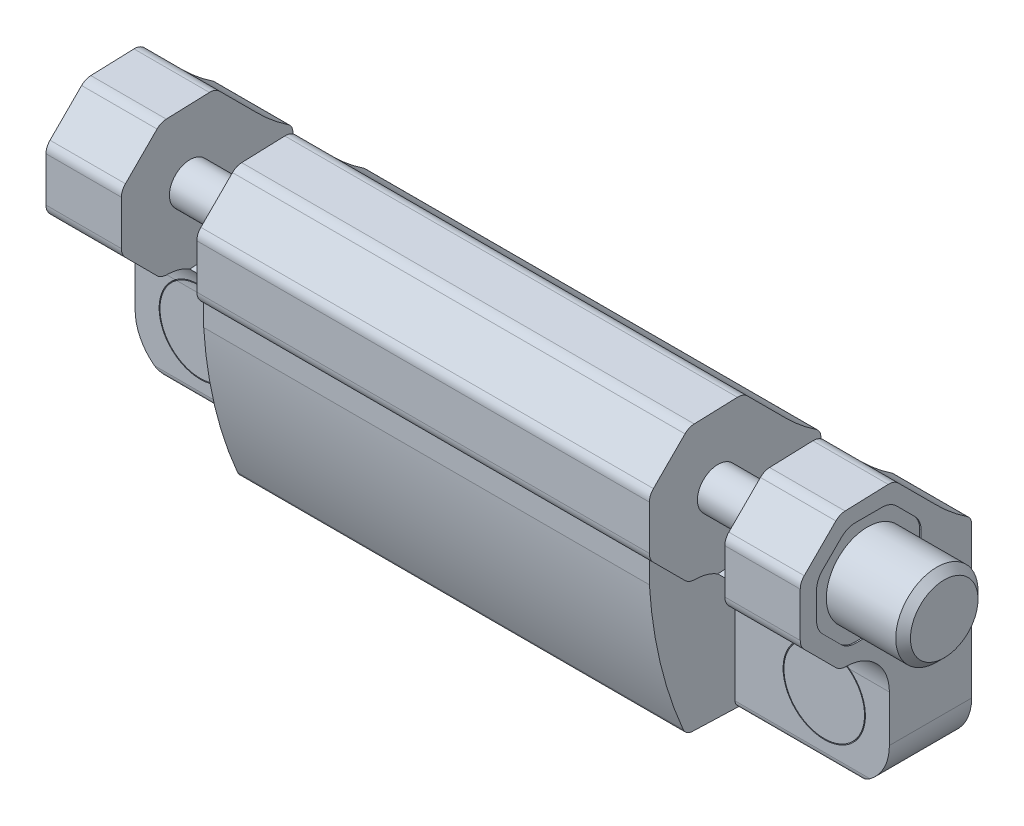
ISO-10303-21;
HEADER;
FILE_DESCRIPTION(('STEP AP214'),'2;1');
FILE_NAME('part.step','',(''),(''),'','','');
FILE_SCHEMA(('AUTOMOTIVE_DESIGN { 1 0 10303 214 1 1 1 1 }'));
ENDSEC;
DATA;
#1=APPLICATION_CONTEXT('core data for automotive mechanical design processes');
#2=APPLICATION_PROTOCOL_DEFINITION('international standard','automotive_design',2000,#1);
#3=PRODUCT_CONTEXT('',#1,'mechanical');
#4=PRODUCT('Part','Part','',(#3));
#5=PRODUCT_RELATED_PRODUCT_CATEGORY('part','',(#4));
#6=PRODUCT_DEFINITION_FORMATION('','',#4);
#7=PRODUCT_DEFINITION_CONTEXT('part definition',#1,'design');
#8=PRODUCT_DEFINITION('design','',#6,#7);
#9=PRODUCT_DEFINITION_SHAPE('','',#8);
#10=(LENGTH_UNIT() NAMED_UNIT(*) SI_UNIT(.MILLI.,.METRE.));
#11=(NAMED_UNIT(*) PLANE_ANGLE_UNIT() SI_UNIT($,.RADIAN.));
#12=(NAMED_UNIT(*) SI_UNIT($,.STERADIAN.) SOLID_ANGLE_UNIT());
#13=UNCERTAINTY_MEASURE_WITH_UNIT(LENGTH_MEASURE(1.E-05),#10,'distance_accuracy_value','');
#14=(GEOMETRIC_REPRESENTATION_CONTEXT(3) GLOBAL_UNCERTAINTY_ASSIGNED_CONTEXT((#13)) GLOBAL_UNIT_ASSIGNED_CONTEXT((#10,
#11,#12)) REPRESENTATION_CONTEXT('',''));
#15=CARTESIAN_POINT('',(0.,0.,0.));
#16=DIRECTION('',(0.,0.,1.));
#17=DIRECTION('',(1.,0.,0.));
#18=AXIS2_PLACEMENT_3D('',#15,#16,#17);
#19=CARTESIAN_POINT('',(12.5,11.0200000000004,-2.0799999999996));
#20=DIRECTION('',(-1.,0.,0.));
#21=DIRECTION('',(0.,-1.,0.));
#22=AXIS2_PLACEMENT_3D('',#19,#20,#21);
#23=PLANE('',#22);
#24=CARTESIAN_POINT('',(12.5,19.9990054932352,1.5));
#25=DIRECTION('',(-1.,0.,0.));
#26=DIRECTION('',(0.,-1.,0.));
#27=AXIS2_PLACEMENT_3D('',#24,#25,#26);
#28=CIRCLE('',#27,1.5);
#29=CARTESIAN_POINT('',(12.5,21.2436156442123,0.662775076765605));
#30=VERTEX_POINT('',#29);
#31=CARTESIAN_POINT('',(12.5,19.9990054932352,0.));
#32=VERTEX_POINT('',#31);
#33=EDGE_CURVE('E1574',#30,#32,#28,.T.);
#34=ORIENTED_EDGE('',*,*,#33,.T.);
#35=DIRECTION('',(0.,-1.,0.));
#36=VECTOR('',#35,1.);
#37=CARTESIAN_POINT('',(12.5,35.190035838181,0.));
#38=LINE('',#37,#36);
#39=CARTESIAN_POINT('',(12.5,19.7557884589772,0.));
#40=VERTEX_POINT('',#39);
#41=EDGE_CURVE('E1491',#32,#40,#38,.T.);
#42=ORIENTED_EDGE('',*,*,#41,.T.);
#43=CARTESIAN_POINT('',(12.5,11.0200000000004,-2.0799999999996));
#44=DIRECTION('',(-1.,0.,0.));
#45=DIRECTION('',(0.,-1.,0.));
#46=AXIS2_PLACEMENT_3D('',#43,#44,#45);
#47=CIRCLE('',#46,8.97999999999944);
#48=CARTESIAN_POINT('',(12.5,15.3060612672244,5.8111392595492));
#49=VERTEX_POINT('',#48);
#50=EDGE_CURVE('E1493',#49,#40,#47,.T.);
#51=ORIENTED_EDGE('',*,*,#50,.F.);
#52=CARTESIAN_POINT('',(12.5,21.0000000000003,15.0000000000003));
#53=DIRECTION('',(-1.,0.,0.));
#54=DIRECTION('',(0.,-1.,0.));
#55=AXIS2_PLACEMENT_3D('',#52,#53,#54);
#56=CIRCLE('',#55,10.8100000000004);
#57=CARTESIAN_POINT('',(12.5,10.190035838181,15.0278355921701));
#58=VERTEX_POINT('',#57);
#59=EDGE_CURVE('E1497',#49,#58,#56,.T.);
#60=ORIENTED_EDGE('',*,*,#59,.T.);
#61=CARTESIAN_POINT('',(12.5,4.75607315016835,18.3899999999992));
#62=DIRECTION('',(-1.,0.,0.));
#63=DIRECTION('',(0.,-1.,0.));
#64=AXIS2_PLACEMENT_3D('',#61,#62,#63);
#65=CIRCLE('',#64,6.3899999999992);
#66=CARTESIAN_POINT('',(12.5,11.1421805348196,18.1669922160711));
#67=VERTEX_POINT('',#66);
#68=EDGE_CURVE('E1562',#67,#58,#65,.T.);
#69=ORIENTED_EDGE('',*,*,#68,.F.);
#70=DIRECTION('',(0.,0.0348994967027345,0.999390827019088));
#71=VECTOR('',#70,1.);
#72=CARTESIAN_POINT('',(12.5,11.1421805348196,18.166992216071));
#73=LINE('',#72,#71);
#74=CARTESIAN_POINT('',(12.5,11.1525054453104,18.462658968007));
#75=VERTEX_POINT('',#74);
#76=EDGE_CURVE('E1560',#67,#75,#73,.T.);
#77=ORIENTED_EDGE('',*,*,#76,.T.);
#78=CARTESIAN_POINT('',(12.5,13.1512870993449,18.3928599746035));
#79=DIRECTION('',(-1.,0.,0.));
#80=DIRECTION('',(0.,-1.,0.));
#81=AXIS2_PLACEMENT_3D('',#78,#79,#80);
#82=CIRCLE('',#81,1.99999999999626);
#83=CARTESIAN_POINT('',(12.5,11.7370735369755,19.807073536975));
#84=VERTEX_POINT('',#83);
#85=EDGE_CURVE('E1558',#75,#84,#82,.T.);
#86=ORIENTED_EDGE('',*,*,#85,.T.);
#87=DIRECTION('',(0.,0.707106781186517,0.707106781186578));
#88=VECTOR('',#87,1.);
#89=CARTESIAN_POINT('',(12.5,11.7370735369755,19.807073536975));
#90=LINE('',#89,#88);
#91=CARTESIAN_POINT('',(12.5,16.3442135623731,24.414213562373));
#92=VERTEX_POINT('',#91);
#93=EDGE_CURVE('E1556',#84,#92,#90,.T.);
#94=ORIENTED_EDGE('',*,*,#93,.T.);
#95=CARTESIAN_POINT('',(12.5,17.7584271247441,23.0000000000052));
#96=DIRECTION('',(-1.,0.,0.));
#97=DIRECTION('',(0.,-1.,0.));
#98=AXIS2_PLACEMENT_3D('',#95,#96,#97);
#99=CIRCLE('',#98,1.99999999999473);
#100=CARTESIAN_POINT('',(12.5,17.7584271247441,25.));
#101=VERTEX_POINT('',#100);
#102=EDGE_CURVE('E1395',#92,#101,#99,.T.);
#103=ORIENTED_EDGE('',*,*,#102,.T.);
#104=DIRECTION('',(0.,1.,0.));
#105=VECTOR('',#104,1.);
#106=CARTESIAN_POINT('',(12.5,17.7584271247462,25.));
#107=LINE('',#106,#105);
#108=CARTESIAN_POINT('',(12.5,24.2415728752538,25.));
#109=VERTEX_POINT('',#108);
#110=EDGE_CURVE('E1553',#101,#109,#107,.T.);
#111=ORIENTED_EDGE('',*,*,#110,.T.);
#112=CARTESIAN_POINT('',(12.5,24.2415728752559,23.0000000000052));
#113=DIRECTION('',(-1.,0.,0.));
#114=DIRECTION('',(0.,-1.,0.));
#115=AXIS2_PLACEMENT_3D('',#112,#113,#114);
#116=CIRCLE('',#115,1.99999999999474);
#117=CARTESIAN_POINT('',(12.5,25.6557864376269,24.414213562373));
#118=VERTEX_POINT('',#117);
#119=EDGE_CURVE('E1551',#109,#118,#116,.T.);
#120=ORIENTED_EDGE('',*,*,#119,.T.);
#121=DIRECTION('',(0.,0.707106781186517,-0.707106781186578));
#122=VECTOR('',#121,1.);
#123=CARTESIAN_POINT('',(12.5,25.6557864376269,24.414213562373));
#124=LINE('',#123,#122);
#125=CARTESIAN_POINT('',(12.5,30.2629264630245,19.807073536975));
#126=VERTEX_POINT('',#125);
#127=EDGE_CURVE('E1549',#118,#126,#124,.T.);
#128=ORIENTED_EDGE('',*,*,#127,.T.);
#129=CARTESIAN_POINT('',(12.5,28.8487129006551,18.3928599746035));
#130=DIRECTION('',(-1.,0.,0.));
#131=DIRECTION('',(0.,-1.,0.));
#132=AXIS2_PLACEMENT_3D('',#129,#130,#131);
#133=CIRCLE('',#132,1.99999999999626);
#134=CARTESIAN_POINT('',(12.5,30.8474945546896,18.462658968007));
#135=VERTEX_POINT('',#134);
#136=EDGE_CURVE('E706',#126,#135,#133,.T.);
#137=ORIENTED_EDGE('',*,*,#136,.T.);
#138=DIRECTION('',(0.,0.0348994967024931,-0.999390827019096));
#139=VECTOR('',#138,1.);
#140=CARTESIAN_POINT('',(12.5,30.8474945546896,18.462658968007));
#141=LINE('',#140,#139);
#142=CARTESIAN_POINT('',(12.5,31.067270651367,12.169094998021));
#143=VERTEX_POINT('',#142);
#144=EDGE_CURVE('E1565',#135,#143,#141,.T.);
#145=ORIENTED_EDGE('',*,*,#144,.T.);
#146=CARTESIAN_POINT('',(12.5,29.0684889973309,12.0992960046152));
#147=DIRECTION('',(-1.,0.,0.));
#148=DIRECTION('',(0.,-1.,0.));
#149=AXIS2_PLACEMENT_3D('',#146,#147,#148);
#150=CIRCLE('',#149,1.99999999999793);
#151=CARTESIAN_POINT('',(12.5,30.482702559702,10.685082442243));
#152=VERTEX_POINT('',#151);
#153=EDGE_CURVE('E1567',#143,#152,#150,.T.);
#154=ORIENTED_EDGE('',*,*,#153,.T.);
#155=DIRECTION('',(0.,-0.707106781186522,-0.707106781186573));
#156=VECTOR('',#155,1.);
#157=CARTESIAN_POINT('',(12.5,30.482702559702,10.685082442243));
#158=LINE('',#157,#156);
#159=CARTESIAN_POINT('',(12.5,24.9695527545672,5.1719326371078));
#160=VERTEX_POINT('',#159);
#161=EDGE_CURVE('E1569',#152,#160,#158,.T.);
#162=ORIENTED_EDGE('',*,*,#161,.T.);
#163=CARTESIAN_POINT('',(12.5,45.9400000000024,-15.9500000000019));
#164=DIRECTION('',(-1.,0.,0.));
#165=DIRECTION('',(0.,-1.,0.));
#166=AXIS2_PLACEMENT_3D('',#163,#164,#165);
#167=CIRCLE('',#166,29.764000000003);
#168=EDGE_CURVE('E1571',#30,#160,#167,.T.);
#169=ORIENTED_EDGE('',*,*,#168,.F.);
#170=EDGE_LOOP('',(#34,#42,#51,#60,#69,#77,#86,#94,#103,#111,#120,#128,#137,#145,#154,#162,#169));
#171=FACE_BOUND('',#170,.T.);
#172=CARTESIAN_POINT('',(12.5,21.,15.));
#173=DIRECTION('',(-1.,0.,0.));
#174=DIRECTION('',(0.,-1.,0.));
#175=AXIS2_PLACEMENT_3D('',#172,#173,#174);
#176=CIRCLE('',#175,3.);
#177=CARTESIAN_POINT('',(12.5,18.,15.));
#178=VERTEX_POINT('',#177);
#179=EDGE_CURVE('E735',#178,#178,#176,.F.);
#180=ORIENTED_EDGE('',*,*,#179,.T.);
#181=EDGE_LOOP('',(#180));
#182=FACE_BOUND('',#181,.T.);
#183=ADVANCED_FACE('F14',(#171,#182),#23,.T.);
#184=CARTESIAN_POINT('',(1.5,11.0200000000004,-2.0799999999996));
#185=DIRECTION('',(-1.,0.,0.));
#186=DIRECTION('',(0.,-1.,0.));
#187=AXIS2_PLACEMENT_3D('',#184,#185,#186);
#188=PLANE('',#187);
#189=CARTESIAN_POINT('',(1.5,45.9400000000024,-15.9500000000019));
#190=DIRECTION('',(-1.,0.,0.));
#191=DIRECTION('',(0.,-1.,0.));
#192=AXIS2_PLACEMENT_3D('',#189,#190,#191);
#193=CIRCLE('',#192,29.764000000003);
#194=CARTESIAN_POINT('',(1.5,21.2436156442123,0.662775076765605));
#195=VERTEX_POINT('',#194);
#196=CARTESIAN_POINT('',(1.5,24.9695527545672,5.1719326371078));
#197=VERTEX_POINT('',#196);
#198=EDGE_CURVE('E1544',#195,#197,#193,.T.);
#199=ORIENTED_EDGE('',*,*,#198,.T.);
#200=DIRECTION('',(0.,-0.707106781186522,-0.707106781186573));
#201=VECTOR('',#200,1.);
#202=CARTESIAN_POINT('',(1.5,30.482702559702,10.685082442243));
#203=LINE('',#202,#201);
#204=CARTESIAN_POINT('',(1.5,30.482702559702,10.685082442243));
#205=VERTEX_POINT('',#204);
#206=EDGE_CURVE('E1541',#205,#197,#203,.T.);
#207=ORIENTED_EDGE('',*,*,#206,.F.);
#208=CARTESIAN_POINT('',(1.5,29.0684889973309,12.0992960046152));
#209=DIRECTION('',(-1.,0.,0.));
#210=DIRECTION('',(0.,-1.,0.));
#211=AXIS2_PLACEMENT_3D('',#208,#209,#210);
#212=CIRCLE('',#211,1.99999999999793);
#213=CARTESIAN_POINT('',(1.5,31.067270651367,12.169094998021));
#214=VERTEX_POINT('',#213);
#215=EDGE_CURVE('E1538',#214,#205,#212,.T.);
#216=ORIENTED_EDGE('',*,*,#215,.F.);
#217=DIRECTION('',(0.,0.0348994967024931,-0.999390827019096));
#218=VECTOR('',#217,1.);
#219=CARTESIAN_POINT('',(1.5,30.8474945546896,18.462658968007));
#220=LINE('',#219,#218);
#221=CARTESIAN_POINT('',(1.5,30.8474945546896,18.462658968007));
#222=VERTEX_POINT('',#221);
#223=EDGE_CURVE('E1535',#222,#214,#220,.T.);
#224=ORIENTED_EDGE('',*,*,#223,.F.);
#225=CARTESIAN_POINT('',(1.5,28.8487129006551,18.3928599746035));
#226=DIRECTION('',(-1.,0.,0.));
#227=DIRECTION('',(0.,-1.,0.));
#228=AXIS2_PLACEMENT_3D('',#225,#226,#227);
#229=CIRCLE('',#228,1.99999999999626);
#230=CARTESIAN_POINT('',(1.5,30.2629264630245,19.807073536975));
#231=VERTEX_POINT('',#230);
#232=EDGE_CURVE('E702',#231,#222,#229,.T.);
#233=ORIENTED_EDGE('',*,*,#232,.F.);
#234=DIRECTION('',(0.,0.707106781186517,-0.707106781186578));
#235=VECTOR('',#234,1.);
#236=CARTESIAN_POINT('',(1.5,25.6557864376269,24.414213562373));
#237=LINE('',#236,#235);
#238=CARTESIAN_POINT('',(1.5,25.6557864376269,24.414213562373));
#239=VERTEX_POINT('',#238);
#240=EDGE_CURVE('E1514',#239,#231,#237,.T.);
#241=ORIENTED_EDGE('',*,*,#240,.F.);
#242=CARTESIAN_POINT('',(1.5,24.2415728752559,23.0000000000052));
#243=DIRECTION('',(-1.,0.,0.));
#244=DIRECTION('',(0.,-1.,0.));
#245=AXIS2_PLACEMENT_3D('',#242,#243,#244);
#246=CIRCLE('',#245,1.99999999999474);
#247=CARTESIAN_POINT('',(1.5,24.2415728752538,25.));
#248=VERTEX_POINT('',#247);
#249=EDGE_CURVE('E1517',#248,#239,#246,.T.);
#250=ORIENTED_EDGE('',*,*,#249,.F.);
#251=DIRECTION('',(0.,1.,0.));
#252=VECTOR('',#251,1.);
#253=CARTESIAN_POINT('',(1.5,17.7584271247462,25.));
#254=LINE('',#253,#252);
#255=CARTESIAN_POINT('',(1.5,17.7584271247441,25.));
#256=VERTEX_POINT('',#255);
#257=EDGE_CURVE('E1520',#256,#248,#254,.T.);
#258=ORIENTED_EDGE('',*,*,#257,.F.);
#259=CARTESIAN_POINT('',(1.5,17.7584271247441,23.0000000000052));
#260=DIRECTION('',(-1.,0.,0.));
#261=DIRECTION('',(0.,-1.,0.));
#262=AXIS2_PLACEMENT_3D('',#259,#260,#261);
#263=CIRCLE('',#262,1.99999999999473);
#264=CARTESIAN_POINT('',(1.5,16.3442135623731,24.414213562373));
#265=VERTEX_POINT('',#264);
#266=EDGE_CURVE('E1523',#265,#256,#263,.T.);
#267=ORIENTED_EDGE('',*,*,#266,.F.);
#268=DIRECTION('',(0.,0.707106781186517,0.707106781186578));
#269=VECTOR('',#268,1.);
#270=CARTESIAN_POINT('',(1.5,11.7370735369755,19.807073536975));
#271=LINE('',#270,#269);
#272=CARTESIAN_POINT('',(1.5,11.7370735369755,19.807073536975));
#273=VERTEX_POINT('',#272);
#274=EDGE_CURVE('E1526',#273,#265,#271,.T.);
#275=ORIENTED_EDGE('',*,*,#274,.F.);
#276=CARTESIAN_POINT('',(1.5,13.1512870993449,18.3928599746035));
#277=DIRECTION('',(-1.,0.,0.));
#278=DIRECTION('',(0.,-1.,0.));
#279=AXIS2_PLACEMENT_3D('',#276,#277,#278);
#280=CIRCLE('',#279,1.99999999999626);
#281=CARTESIAN_POINT('',(1.5,11.1525054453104,18.462658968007));
#282=VERTEX_POINT('',#281);
#283=EDGE_CURVE('E1528',#282,#273,#280,.T.);
#284=ORIENTED_EDGE('',*,*,#283,.F.);
#285=DIRECTION('',(0.,0.0348994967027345,0.999390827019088));
#286=VECTOR('',#285,1.);
#287=CARTESIAN_POINT('',(1.5,11.1421805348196,18.166992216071));
#288=LINE('',#287,#286);
#289=CARTESIAN_POINT('',(1.5,11.1421805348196,18.1669922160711));
#290=VERTEX_POINT('',#289);
#291=EDGE_CURVE('E1531',#290,#282,#288,.T.);
#292=ORIENTED_EDGE('',*,*,#291,.F.);
#293=CARTESIAN_POINT('',(1.5,4.75607315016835,18.3899999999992));
#294=DIRECTION('',(-1.,0.,0.));
#295=DIRECTION('',(0.,-1.,0.));
#296=AXIS2_PLACEMENT_3D('',#293,#294,#295);
#297=CIRCLE('',#296,6.3899999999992);
#298=CARTESIAN_POINT('',(1.5,10.190035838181,15.0278355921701));
#299=VERTEX_POINT('',#298);
#300=EDGE_CURVE('E1533',#290,#299,#297,.T.);
#301=ORIENTED_EDGE('',*,*,#300,.T.);
#302=CARTESIAN_POINT('',(1.5,21.0000000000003,15.0000000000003));
#303=DIRECTION('',(-1.,0.,0.));
#304=DIRECTION('',(0.,-1.,0.));
#305=AXIS2_PLACEMENT_3D('',#302,#303,#304);
#306=CIRCLE('',#305,10.8100000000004);
#307=CARTESIAN_POINT('',(1.5,15.3060612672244,5.8111392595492));
#308=VERTEX_POINT('',#307);
#309=EDGE_CURVE('E1494',#308,#299,#306,.T.);
#310=ORIENTED_EDGE('',*,*,#309,.F.);
#311=CARTESIAN_POINT('',(1.5,11.0200000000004,-2.0799999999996));
#312=DIRECTION('',(-1.,0.,0.));
#313=DIRECTION('',(0.,-1.,0.));
#314=AXIS2_PLACEMENT_3D('',#311,#312,#313);
#315=CIRCLE('',#314,8.97999999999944);
#316=CARTESIAN_POINT('',(1.5,19.7557884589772,0.));
#317=VERTEX_POINT('',#316);
#318=EDGE_CURVE('E1503',#308,#317,#315,.T.);
#319=ORIENTED_EDGE('',*,*,#318,.T.);
#320=DIRECTION('',(0.,-1.,0.));
#321=VECTOR('',#320,1.);
#322=CARTESIAN_POINT('',(1.5,35.190035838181,0.));
#323=LINE('',#322,#321);
#324=CARTESIAN_POINT('',(1.5,19.9990054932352,0.));
#325=VERTEX_POINT('',#324);
#326=EDGE_CURVE('E1490',#325,#317,#323,.T.);
#327=ORIENTED_EDGE('',*,*,#326,.F.);
#328=CARTESIAN_POINT('',(1.5,19.9990054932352,1.5));
#329=DIRECTION('',(-1.,0.,0.));
#330=DIRECTION('',(0.,-1.,0.));
#331=AXIS2_PLACEMENT_3D('',#328,#329,#330);
#332=CIRCLE('',#331,1.5);
#333=EDGE_CURVE('E1546',#195,#325,#332,.T.);
#334=ORIENTED_EDGE('',*,*,#333,.F.);
#335=EDGE_LOOP('',(#199,#207,#216,#224,#233,#241,#250,#258,#267,#275,#284,#292,#301,#310,#319,
#327,#334));
#336=FACE_BOUND('',#335,.T.);
#337=CARTESIAN_POINT('',(1.5,21.,15.));
#338=DIRECTION('',(-1.,0.,0.));
#339=DIRECTION('',(0.,-1.,0.));
#340=AXIS2_PLACEMENT_3D('',#337,#338,#339);
#341=CIRCLE('',#340,3.);
#342=CARTESIAN_POINT('',(1.5,18.,15.));
#343=VERTEX_POINT('',#342);
#344=EDGE_CURVE('E9',#343,#343,#341,.F.);
#345=ORIENTED_EDGE('',*,*,#344,.F.);
#346=EDGE_LOOP('',(#345));
#347=FACE_BOUND('',#346,.T.);
#348=ADVANCED_FACE('F1120',(#336,#347),#188,.F.);
#349=CARTESIAN_POINT('',(78.5,11.0200000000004,-2.0799999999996));
#350=DIRECTION('',(-1.,0.,0.));
#351=DIRECTION('',(0.,-1.,0.));
#352=AXIS2_PLACEMENT_3D('',#349,#350,#351);
#353=PLANE('',#352);
#354=CARTESIAN_POINT('',(78.5,45.9400000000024,-15.9500000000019));
#355=DIRECTION('',(-1.,0.,0.));
#356=DIRECTION('',(0.,-1.,0.));
#357=AXIS2_PLACEMENT_3D('',#354,#355,#356);
#358=CIRCLE('',#357,29.764000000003);
#359=CARTESIAN_POINT('',(78.5,21.2436156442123,0.662775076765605));
#360=VERTEX_POINT('',#359);
#361=CARTESIAN_POINT('',(78.5,24.9695527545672,5.1719326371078));
#362=VERTEX_POINT('',#361);
#363=EDGE_CURVE('E1485',#360,#362,#358,.T.);
#364=ORIENTED_EDGE('',*,*,#363,.T.);
#365=DIRECTION('',(0.,-0.707106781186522,-0.707106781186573));
#366=VECTOR('',#365,1.);
#367=CARTESIAN_POINT('',(78.5,30.482702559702,10.685082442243));
#368=LINE('',#367,#366);
#369=CARTESIAN_POINT('',(78.5,30.482702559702,10.685082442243));
#370=VERTEX_POINT('',#369);
#371=EDGE_CURVE('E1482',#370,#362,#368,.T.);
#372=ORIENTED_EDGE('',*,*,#371,.F.);
#373=CARTESIAN_POINT('',(78.5,29.0684889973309,12.0992960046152));
#374=DIRECTION('',(-1.,0.,0.));
#375=DIRECTION('',(0.,-1.,0.));
#376=AXIS2_PLACEMENT_3D('',#373,#374,#375);
#377=CIRCLE('',#376,1.99999999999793);
#378=CARTESIAN_POINT('',(78.5,31.067270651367,12.169094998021));
#379=VERTEX_POINT('',#378);
#380=EDGE_CURVE('E1479',#379,#370,#377,.T.);
#381=ORIENTED_EDGE('',*,*,#380,.F.);
#382=DIRECTION('',(0.,0.0348994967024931,-0.999390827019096));
#383=VECTOR('',#382,1.);
#384=CARTESIAN_POINT('',(78.5,30.8474945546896,18.462658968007));
#385=LINE('',#384,#383);
#386=CARTESIAN_POINT('',(78.5,30.8474945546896,18.462658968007));
#387=VERTEX_POINT('',#386);
#388=EDGE_CURVE('E1476',#387,#379,#385,.T.);
#389=ORIENTED_EDGE('',*,*,#388,.F.);
#390=CARTESIAN_POINT('',(78.5,28.8487129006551,18.3928599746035));
#391=DIRECTION('',(-1.,0.,0.));
#392=DIRECTION('',(0.,-1.,0.));
#393=AXIS2_PLACEMENT_3D('',#390,#391,#392);
#394=CIRCLE('',#393,1.99999999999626);
#395=CARTESIAN_POINT('',(78.5,30.2629264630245,19.807073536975));
#396=VERTEX_POINT('',#395);
#397=EDGE_CURVE('E710',#396,#387,#394,.T.);
#398=ORIENTED_EDGE('',*,*,#397,.F.);
#399=DIRECTION('',(0.,0.707106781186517,-0.707106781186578));
#400=VECTOR('',#399,1.);
#401=CARTESIAN_POINT('',(78.5,25.6557864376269,24.414213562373));
#402=LINE('',#401,#400);
#403=CARTESIAN_POINT('',(78.5,25.6557864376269,24.414213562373));
#404=VERTEX_POINT('',#403);
#405=EDGE_CURVE('E1454',#404,#396,#402,.T.);
#406=ORIENTED_EDGE('',*,*,#405,.F.);
#407=CARTESIAN_POINT('',(78.5,24.2415728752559,23.0000000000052));
#408=DIRECTION('',(-1.,0.,0.));
#409=DIRECTION('',(0.,-1.,0.));
#410=AXIS2_PLACEMENT_3D('',#407,#408,#409);
#411=CIRCLE('',#410,1.99999999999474);
#412=CARTESIAN_POINT('',(78.5,24.2415728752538,25.));
#413=VERTEX_POINT('',#412);
#414=EDGE_CURVE('E1457',#413,#404,#411,.T.);
#415=ORIENTED_EDGE('',*,*,#414,.F.);
#416=DIRECTION('',(0.,1.,0.));
#417=VECTOR('',#416,1.);
#418=CARTESIAN_POINT('',(78.5,17.7584271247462,25.));
#419=LINE('',#418,#417);
#420=CARTESIAN_POINT('',(78.5,17.7584271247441,25.));
#421=VERTEX_POINT('',#420);
#422=EDGE_CURVE('E1460',#421,#413,#419,.T.);
#423=ORIENTED_EDGE('',*,*,#422,.F.);
#424=CARTESIAN_POINT('',(78.5,17.7584271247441,23.0000000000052));
#425=DIRECTION('',(-1.,0.,0.));
#426=DIRECTION('',(0.,-1.,0.));
#427=AXIS2_PLACEMENT_3D('',#424,#425,#426);
#428=CIRCLE('',#427,1.99999999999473);
#429=CARTESIAN_POINT('',(78.5,16.3442135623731,24.414213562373));
#430=VERTEX_POINT('',#429);
#431=EDGE_CURVE('E1463',#430,#421,#428,.T.);
#432=ORIENTED_EDGE('',*,*,#431,.F.);
#433=DIRECTION('',(0.,0.707106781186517,0.707106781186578));
#434=VECTOR('',#433,1.);
#435=CARTESIAN_POINT('',(78.5,11.7370735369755,19.807073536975));
#436=LINE('',#435,#434);
#437=CARTESIAN_POINT('',(78.5,11.7370735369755,19.807073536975));
#438=VERTEX_POINT('',#437);
#439=EDGE_CURVE('E1466',#438,#430,#436,.T.);
#440=ORIENTED_EDGE('',*,*,#439,.F.);
#441=CARTESIAN_POINT('',(78.5,13.1512870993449,18.3928599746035));
#442=DIRECTION('',(-1.,0.,0.));
#443=DIRECTION('',(0.,-1.,0.));
#444=AXIS2_PLACEMENT_3D('',#441,#442,#443);
#445=CIRCLE('',#444,1.99999999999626);
#446=CARTESIAN_POINT('',(78.5,11.1525054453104,18.462658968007));
#447=VERTEX_POINT('',#446);
#448=EDGE_CURVE('E1468',#447,#438,#445,.T.);
#449=ORIENTED_EDGE('',*,*,#448,.F.);
#450=DIRECTION('',(0.,0.0348994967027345,0.999390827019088));
#451=VECTOR('',#450,1.);
#452=CARTESIAN_POINT('',(78.5,11.1421805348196,18.166992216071));
#453=LINE('',#452,#451);
#454=CARTESIAN_POINT('',(78.5,11.1421805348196,18.1669922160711));
#455=VERTEX_POINT('',#454);
#456=EDGE_CURVE('E1471',#455,#447,#453,.T.);
#457=ORIENTED_EDGE('',*,*,#456,.F.);
#458=CARTESIAN_POINT('',(78.5,4.75607315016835,18.3899999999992));
#459=DIRECTION('',(-1.,0.,0.));
#460=DIRECTION('',(0.,-1.,0.));
#461=AXIS2_PLACEMENT_3D('',#458,#459,#460);
#462=CIRCLE('',#461,6.3899999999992);
#463=CARTESIAN_POINT('',(78.5,10.190035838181,15.0278355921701));
#464=VERTEX_POINT('',#463);
#465=EDGE_CURVE('E1474',#455,#464,#462,.T.);
#466=ORIENTED_EDGE('',*,*,#465,.T.);
#467=CARTESIAN_POINT('',(78.5,21.0000000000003,15.0000000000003));
#468=DIRECTION('',(-1.,0.,0.));
#469=DIRECTION('',(0.,-1.,0.));
#470=AXIS2_PLACEMENT_3D('',#467,#468,#469);
#471=CIRCLE('',#470,10.8100000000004);
#472=CARTESIAN_POINT('',(78.5,15.3060612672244,5.8111392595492));
#473=VERTEX_POINT('',#472);
#474=EDGE_CURVE('E1419',#473,#464,#471,.T.);
#475=ORIENTED_EDGE('',*,*,#474,.F.);
#476=CARTESIAN_POINT('',(78.5,11.0200000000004,-2.0799999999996));
#477=DIRECTION('',(-1.,0.,0.));
#478=DIRECTION('',(0.,-1.,0.));
#479=AXIS2_PLACEMENT_3D('',#476,#477,#478);
#480=CIRCLE('',#479,8.97999999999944);
#481=CARTESIAN_POINT('',(78.5,19.7557884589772,0.));
#482=VERTEX_POINT('',#481);
#483=EDGE_CURVE('E1415',#473,#482,#480,.T.);
#484=ORIENTED_EDGE('',*,*,#483,.T.);
#485=DIRECTION('',(0.,-1.,0.));
#486=VECTOR('',#485,1.);
#487=CARTESIAN_POINT('',(78.5,35.190035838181,0.));
#488=LINE('',#487,#486);
#489=CARTESIAN_POINT('',(78.5,19.9990054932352,0.));
#490=VERTEX_POINT('',#489);
#491=EDGE_CURVE('E1412',#490,#482,#488,.T.);
#492=ORIENTED_EDGE('',*,*,#491,.F.);
#493=CARTESIAN_POINT('',(78.5,19.9990054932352,1.5));
#494=DIRECTION('',(-1.,0.,0.));
#495=DIRECTION('',(0.,-1.,0.));
#496=AXIS2_PLACEMENT_3D('',#493,#494,#495);
#497=CIRCLE('',#496,1.5);
#498=EDGE_CURVE('E1487',#360,#490,#497,.T.);
#499=ORIENTED_EDGE('',*,*,#498,.F.);
#500=EDGE_LOOP('',(#364,#372,#381,#389,#398,#406,#415,#423,#432,#440,#449,#457,#466,#475,#484,
#492,#499));
#501=FACE_BOUND('',#500,.T.);
#502=CARTESIAN_POINT('',(78.5,21.,15.));
#503=DIRECTION('',(-1.,0.,0.));
#504=DIRECTION('',(0.,-1.,0.));
#505=AXIS2_PLACEMENT_3D('',#502,#503,#504);
#506=CIRCLE('',#505,3.);
#507=CARTESIAN_POINT('',(78.5,18.,15.));
#508=VERTEX_POINT('',#507);
#509=EDGE_CURVE('E22',#508,#508,#506,.F.);
#510=ORIENTED_EDGE('',*,*,#509,.F.);
#511=EDGE_LOOP('',(#510));
#512=FACE_BOUND('',#511,.T.);
#513=ADVANCED_FACE('F1116',(#501,#512),#353,.F.);
#514=CARTESIAN_POINT('',(89.5,11.0200000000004,-2.0799999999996));
#515=DIRECTION('',(-1.,0.,0.));
#516=DIRECTION('',(0.,-1.,0.));
#517=AXIS2_PLACEMENT_3D('',#514,#515,#516);
#518=PLANE('',#517);
#519=CARTESIAN_POINT('',(89.5,19.9990054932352,1.5));
#520=DIRECTION('',(-1.,0.,0.));
#521=DIRECTION('',(0.,-1.,0.));
#522=AXIS2_PLACEMENT_3D('',#519,#520,#521);
#523=CIRCLE('',#522,1.5);
#524=CARTESIAN_POINT('',(89.5,21.2436156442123,0.662775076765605));
#525=VERTEX_POINT('',#524);
#526=CARTESIAN_POINT('',(89.5,19.9990054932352,0.));
#527=VERTEX_POINT('',#526);
#528=EDGE_CURVE('E1452',#525,#527,#523,.T.);
#529=ORIENTED_EDGE('',*,*,#528,.T.);
#530=DIRECTION('',(0.,-1.,0.));
#531=VECTOR('',#530,1.);
#532=CARTESIAN_POINT('',(89.5,35.190035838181,0.));
#533=LINE('',#532,#531);
#534=CARTESIAN_POINT('',(89.5,19.7557884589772,0.));
#535=VERTEX_POINT('',#534);
#536=EDGE_CURVE('E1404',#527,#535,#533,.T.);
#537=ORIENTED_EDGE('',*,*,#536,.T.);
#538=CARTESIAN_POINT('',(89.5,11.0200000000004,-2.0799999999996));
#539=DIRECTION('',(-1.,0.,0.));
#540=DIRECTION('',(0.,-1.,0.));
#541=AXIS2_PLACEMENT_3D('',#538,#539,#540);
#542=CIRCLE('',#541,8.97999999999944);
#543=CARTESIAN_POINT('',(89.5,15.3060612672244,5.8111392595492));
#544=VERTEX_POINT('',#543);
#545=EDGE_CURVE('E1406',#544,#535,#542,.T.);
#546=ORIENTED_EDGE('',*,*,#545,.F.);
#547=CARTESIAN_POINT('',(89.5,21.0000000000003,15.0000000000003));
#548=DIRECTION('',(-1.,0.,0.));
#549=DIRECTION('',(0.,-1.,0.));
#550=AXIS2_PLACEMENT_3D('',#547,#548,#549);
#551=CIRCLE('',#550,10.8100000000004);
#552=CARTESIAN_POINT('',(89.5,10.190035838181,15.0278355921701));
#553=VERTEX_POINT('',#552);
#554=EDGE_CURVE('E1416',#544,#553,#551,.T.);
#555=ORIENTED_EDGE('',*,*,#554,.T.);
#556=CARTESIAN_POINT('',(89.5,4.75607315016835,18.3899999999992));
#557=DIRECTION('',(-1.,0.,0.));
#558=DIRECTION('',(0.,-1.,0.));
#559=AXIS2_PLACEMENT_3D('',#556,#557,#558);
#560=CIRCLE('',#559,6.3899999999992);
#561=CARTESIAN_POINT('',(89.5,11.1421805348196,18.1669922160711));
#562=VERTEX_POINT('',#561);
#563=EDGE_CURVE('E1250',#562,#553,#560,.T.);
#564=ORIENTED_EDGE('',*,*,#563,.F.);
#565=DIRECTION('',(0.,0.0348994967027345,0.999390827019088));
#566=VECTOR('',#565,1.);
#567=CARTESIAN_POINT('',(89.5,11.1421805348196,18.166992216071));
#568=LINE('',#567,#566);
#569=CARTESIAN_POINT('',(89.5,11.1525054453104,18.462658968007));
#570=VERTEX_POINT('',#569);
#571=EDGE_CURVE('E1243',#562,#570,#568,.T.);
#572=ORIENTED_EDGE('',*,*,#571,.T.);
#573=CARTESIAN_POINT('',(89.5,13.1512870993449,18.3928599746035));
#574=DIRECTION('',(-1.,0.,0.));
#575=DIRECTION('',(0.,-1.,0.));
#576=AXIS2_PLACEMENT_3D('',#573,#574,#575);
#577=CIRCLE('',#576,1.99999999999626);
#578=CARTESIAN_POINT('',(89.5,11.7370735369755,19.807073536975));
#579=VERTEX_POINT('',#578);
#580=EDGE_CURVE('E1251',#570,#579,#577,.T.);
#581=ORIENTED_EDGE('',*,*,#580,.T.);
#582=DIRECTION('',(0.,0.707106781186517,0.707106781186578));
#583=VECTOR('',#582,1.);
#584=CARTESIAN_POINT('',(89.5,11.7370735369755,19.807073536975));
#585=LINE('',#584,#583);
#586=CARTESIAN_POINT('',(89.5,16.3442135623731,24.414213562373));
#587=VERTEX_POINT('',#586);
#588=EDGE_CURVE('E1381',#579,#587,#585,.T.);
#589=ORIENTED_EDGE('',*,*,#588,.T.);
#590=CARTESIAN_POINT('',(89.5,17.7584271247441,23.0000000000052));
#591=DIRECTION('',(-1.,0.,0.));
#592=DIRECTION('',(0.,-1.,0.));
#593=AXIS2_PLACEMENT_3D('',#590,#591,#592);
#594=CIRCLE('',#593,1.99999999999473);
#595=CARTESIAN_POINT('',(89.5,17.7584271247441,25.));
#596=VERTEX_POINT('',#595);
#597=EDGE_CURVE('E1387',#587,#596,#594,.T.);
#598=ORIENTED_EDGE('',*,*,#597,.T.);
#599=DIRECTION('',(0.,1.,0.));
#600=VECTOR('',#599,1.);
#601=CARTESIAN_POINT('',(89.5,17.7584271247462,25.));
#602=LINE('',#601,#600);
#603=CARTESIAN_POINT('',(89.5,24.2415728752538,25.));
#604=VERTEX_POINT('',#603);
#605=EDGE_CURVE('E1437',#596,#604,#602,.T.);
#606=ORIENTED_EDGE('',*,*,#605,.T.);
#607=CARTESIAN_POINT('',(89.5,24.2415728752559,23.0000000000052));
#608=DIRECTION('',(-1.,0.,0.));
#609=DIRECTION('',(0.,-1.,0.));
#610=AXIS2_PLACEMENT_3D('',#607,#608,#609);
#611=CIRCLE('',#610,1.99999999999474);
#612=CARTESIAN_POINT('',(89.5,25.6557864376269,24.414213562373));
#613=VERTEX_POINT('',#612);
#614=EDGE_CURVE('E1435',#604,#613,#611,.T.);
#615=ORIENTED_EDGE('',*,*,#614,.T.);
#616=DIRECTION('',(0.,0.707106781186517,-0.707106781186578));
#617=VECTOR('',#616,1.);
#618=CARTESIAN_POINT('',(89.5,25.6557864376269,24.414213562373));
#619=LINE('',#618,#617);
#620=CARTESIAN_POINT('',(89.5,30.2629264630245,19.807073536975));
#621=VERTEX_POINT('',#620);
#622=EDGE_CURVE('E1433',#613,#621,#619,.T.);
#623=ORIENTED_EDGE('',*,*,#622,.T.);
#624=CARTESIAN_POINT('',(89.5,28.8487129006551,18.3928599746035));
#625=DIRECTION('',(-1.,0.,0.));
#626=DIRECTION('',(0.,-1.,0.));
#627=AXIS2_PLACEMENT_3D('',#624,#625,#626);
#628=CIRCLE('',#627,1.99999999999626);
#629=CARTESIAN_POINT('',(89.5,30.8474945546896,18.462658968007));
#630=VERTEX_POINT('',#629);
#631=EDGE_CURVE('E708',#621,#630,#628,.T.);
#632=ORIENTED_EDGE('',*,*,#631,.T.);
#633=DIRECTION('',(0.,0.0348994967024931,-0.999390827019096));
#634=VECTOR('',#633,1.);
#635=CARTESIAN_POINT('',(89.5,30.8474945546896,18.462658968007));
#636=LINE('',#635,#634);
#637=CARTESIAN_POINT('',(89.5,31.067270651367,12.169094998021));
#638=VERTEX_POINT('',#637);
#639=EDGE_CURVE('E1443',#630,#638,#636,.T.);
#640=ORIENTED_EDGE('',*,*,#639,.T.);
#641=CARTESIAN_POINT('',(89.5,29.0684889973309,12.0992960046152));
#642=DIRECTION('',(-1.,0.,0.));
#643=DIRECTION('',(0.,-1.,0.));
#644=AXIS2_PLACEMENT_3D('',#641,#642,#643);
#645=CIRCLE('',#644,1.99999999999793);
#646=CARTESIAN_POINT('',(89.5,30.482702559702,10.685082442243));
#647=VERTEX_POINT('',#646);
#648=EDGE_CURVE('E1445',#638,#647,#645,.T.);
#649=ORIENTED_EDGE('',*,*,#648,.T.);
#650=DIRECTION('',(0.,-0.707106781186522,-0.707106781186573));
#651=VECTOR('',#650,1.);
#652=CARTESIAN_POINT('',(89.5,30.482702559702,10.685082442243));
#653=LINE('',#652,#651);
#654=CARTESIAN_POINT('',(89.5,24.9695527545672,5.1719326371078));
#655=VERTEX_POINT('',#654);
#656=EDGE_CURVE('E1447',#647,#655,#653,.T.);
#657=ORIENTED_EDGE('',*,*,#656,.T.);
#658=CARTESIAN_POINT('',(89.5,45.9400000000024,-15.9500000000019));
#659=DIRECTION('',(-1.,0.,0.));
#660=DIRECTION('',(0.,-1.,0.));
#661=AXIS2_PLACEMENT_3D('',#658,#659,#660);
#662=CIRCLE('',#661,29.764000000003);
#663=EDGE_CURVE('E1449',#525,#655,#662,.T.);
#664=ORIENTED_EDGE('',*,*,#663,.F.);
#665=EDGE_LOOP('',(#529,#537,#546,#555,#564,#572,#581,#589,#598,#606,#615,#623,#632,#640,#649,
#657,#664));
#666=FACE_BOUND('',#665,.T.);
#667=CARTESIAN_POINT('',(89.5,21.,15.));
#668=DIRECTION('',(-1.,0.,0.));
#669=DIRECTION('',(0.,-1.,0.));
#670=AXIS2_PLACEMENT_3D('',#667,#668,#669);
#671=CIRCLE('',#670,3.);
#672=CARTESIAN_POINT('',(89.5,18.,15.));
#673=VERTEX_POINT('',#672);
#674=EDGE_CURVE('E734',#673,#673,#671,.T.);
#675=ORIENTED_EDGE('',*,*,#674,.F.);
#676=EDGE_LOOP('',(#675));
#677=FACE_BOUND('',#676,.T.);
#678=ADVANCED_FACE('F1119',(#666,#677),#518,.T.);
#679=CARTESIAN_POINT('',(100.3,25.62200614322,13.0855023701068));
#680=DIRECTION('',(-1.,0.,0.));
#681=DIRECTION('',(0.,-1.,0.));
#682=AXIS2_PLACEMENT_3D('',#679,#680,#681);
#683=PLANE('',#682);
#684=DIRECTION('',(0.,0.,-1.));
#685=VECTOR('',#684,1.);
#686=CARTESIAN_POINT('',(100.3,28.6220061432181,16.914497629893));
#687=LINE('',#686,#685);
#688=CARTESIAN_POINT('',(100.3,28.6220061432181,16.9144976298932));
#689=VERTEX_POINT('',#688);
#690=CARTESIAN_POINT('',(100.3,28.6220061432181,13.0855023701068));
#691=VERTEX_POINT('',#690);
#692=EDGE_CURVE('E819',#689,#691,#687,.T.);
#693=ORIENTED_EDGE('',*,*,#692,.F.);
#694=CARTESIAN_POINT('',(100.3,25.62200614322,16.9144976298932));
#695=DIRECTION('',(-1.,0.,0.));
#696=DIRECTION('',(0.,-1.,0.));
#697=AXIS2_PLACEMENT_3D('',#694,#695,#696);
#698=CIRCLE('',#697,2.9999999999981);
#699=CARTESIAN_POINT('',(100.3,27.7433264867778,19.035817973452));
#700=VERTEX_POINT('',#699);
#701=EDGE_CURVE('E851',#700,#689,#698,.T.);
#702=ORIENTED_EDGE('',*,*,#701,.F.);
#703=DIRECTION('',(0.,0.707106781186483,-0.707106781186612));
#704=VECTOR('',#703,1.);
#705=CARTESIAN_POINT('',(100.3,25.0358179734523,21.743326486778));
#706=LINE('',#705,#704);
#707=CARTESIAN_POINT('',(100.3,25.0358179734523,21.743326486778));
#708=VERTEX_POINT('',#707);
#709=EDGE_CURVE('E849',#708,#700,#706,.T.);
#710=ORIENTED_EDGE('',*,*,#709,.F.);
#711=CARTESIAN_POINT('',(100.3,22.9144976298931,19.6220061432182));
#712=DIRECTION('',(-1.,0.,0.));
#713=DIRECTION('',(0.,-1.,0.));
#714=AXIS2_PLACEMENT_3D('',#711,#712,#713);
#715=CIRCLE('',#714,2.99999999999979);
#716=CARTESIAN_POINT('',(100.3,22.9144976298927,22.622006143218));
#717=VERTEX_POINT('',#716);
#718=EDGE_CURVE('E847',#717,#708,#715,.T.);
#719=ORIENTED_EDGE('',*,*,#718,.F.);
#720=DIRECTION('',(0.,1.,0.));
#721=VECTOR('',#720,1.);
#722=CARTESIAN_POINT('',(100.3,19.0855023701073,22.622006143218));
#723=LINE('',#722,#721);
#724=CARTESIAN_POINT('',(100.3,19.0855023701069,22.622006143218));
#725=VERTEX_POINT('',#724);
#726=EDGE_CURVE('E845',#725,#717,#723,.T.);
#727=ORIENTED_EDGE('',*,*,#726,.F.);
#728=CARTESIAN_POINT('',(100.3,19.0855023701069,19.6220061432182));
#729=DIRECTION('',(-1.,0.,0.));
#730=DIRECTION('',(0.,-1.,0.));
#731=AXIS2_PLACEMENT_3D('',#728,#729,#730);
#732=CIRCLE('',#731,2.99999999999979);
#733=CARTESIAN_POINT('',(100.3,16.9641820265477,21.743326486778));
#734=VERTEX_POINT('',#733);
#735=EDGE_CURVE('E843',#734,#725,#732,.T.);
#736=ORIENTED_EDGE('',*,*,#735,.F.);
#737=DIRECTION('',(0.,0.707106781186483,0.707106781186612));
#738=VECTOR('',#737,1.);
#739=CARTESIAN_POINT('',(100.3,14.2566735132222,19.035817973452));
#740=LINE('',#739,#738);
#741=CARTESIAN_POINT('',(100.3,14.2566735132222,19.035817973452));
#742=VERTEX_POINT('',#741);
#743=EDGE_CURVE('E841',#742,#734,#740,.T.);
#744=ORIENTED_EDGE('',*,*,#743,.F.);
#745=CARTESIAN_POINT('',(100.3,16.37799385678,16.9144976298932));
#746=DIRECTION('',(-1.,0.,0.));
#747=DIRECTION('',(0.,-1.,0.));
#748=AXIS2_PLACEMENT_3D('',#745,#746,#747);
#749=CIRCLE('',#748,2.9999999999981);
#750=CARTESIAN_POINT('',(100.3,13.3779938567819,16.914497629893));
#751=VERTEX_POINT('',#750);
#752=EDGE_CURVE('E839',#751,#742,#749,.T.);
#753=ORIENTED_EDGE('',*,*,#752,.F.);
#754=DIRECTION('',(0.,0.,1.));
#755=VECTOR('',#754,1.);
#756=CARTESIAN_POINT('',(100.3,13.3779938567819,13.085502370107));
#757=LINE('',#756,#755);
#758=CARTESIAN_POINT('',(100.3,13.3779938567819,13.0855023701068));
#759=VERTEX_POINT('',#758);
#760=EDGE_CURVE('E837',#759,#751,#757,.T.);
#761=ORIENTED_EDGE('',*,*,#760,.F.);
#762=CARTESIAN_POINT('',(100.3,16.37799385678,13.0855023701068));
#763=DIRECTION('',(-1.,0.,0.));
#764=DIRECTION('',(0.,-1.,0.));
#765=AXIS2_PLACEMENT_3D('',#762,#763,#764);
#766=CIRCLE('',#765,2.99999999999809);
#767=CARTESIAN_POINT('',(100.3,14.2566735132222,10.964182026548));
#768=VERTEX_POINT('',#767);
#769=EDGE_CURVE('E835',#768,#759,#766,.T.);
#770=ORIENTED_EDGE('',*,*,#769,.F.);
#771=DIRECTION('',(0.,-0.707106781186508,0.707106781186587));
#772=VECTOR('',#771,1.);
#773=CARTESIAN_POINT('',(100.3,16.9641820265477,8.2566735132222));
#774=LINE('',#773,#772);
#775=CARTESIAN_POINT('',(100.3,16.9641820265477,8.2566735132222));
#776=VERTEX_POINT('',#775);
#777=EDGE_CURVE('E833',#776,#768,#774,.T.);
#778=ORIENTED_EDGE('',*,*,#777,.F.);
#779=CARTESIAN_POINT('',(100.3,19.0855023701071,10.3779938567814));
#780=DIRECTION('',(-1.,0.,0.));
#781=DIRECTION('',(0.,-1.,0.));
#782=AXIS2_PLACEMENT_3D('',#779,#780,#781);
#783=CIRCLE('',#782,2.99999999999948);
#784=CARTESIAN_POINT('',(100.3,19.0855023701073,7.3779938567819));
#785=VERTEX_POINT('',#784);
#786=EDGE_CURVE('E831',#785,#776,#783,.T.);
#787=ORIENTED_EDGE('',*,*,#786,.F.);
#788=DIRECTION('',(0.,-1.,0.));
#789=VECTOR('',#788,1.);
#790=CARTESIAN_POINT('',(100.3,22.9144976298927,7.3779938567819));
#791=LINE('',#790,#789);
#792=CARTESIAN_POINT('',(100.3,22.9144976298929,7.3779938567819));
#793=VERTEX_POINT('',#792);
#794=EDGE_CURVE('E829',#793,#785,#791,.T.);
#795=ORIENTED_EDGE('',*,*,#794,.F.);
#796=CARTESIAN_POINT('',(100.3,22.9144976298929,10.3779938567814));
#797=DIRECTION('',(-1.,0.,0.));
#798=DIRECTION('',(0.,-1.,0.));
#799=AXIS2_PLACEMENT_3D('',#796,#797,#798);
#800=CIRCLE('',#799,2.99999999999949);
#801=CARTESIAN_POINT('',(100.3,25.0358179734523,8.2566735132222));
#802=VERTEX_POINT('',#801);
#803=EDGE_CURVE('E827',#802,#793,#800,.T.);
#804=ORIENTED_EDGE('',*,*,#803,.F.);
#805=DIRECTION('',(0.,-0.707106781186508,-0.707106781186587));
#806=VECTOR('',#805,1.);
#807=CARTESIAN_POINT('',(100.3,27.7433264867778,10.964182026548));
#808=LINE('',#807,#806);
#809=CARTESIAN_POINT('',(100.3,27.7433264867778,10.964182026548));
#810=VERTEX_POINT('',#809);
#811=EDGE_CURVE('E825',#810,#802,#808,.T.);
#812=ORIENTED_EDGE('',*,*,#811,.F.);
#813=CARTESIAN_POINT('',(100.3,25.62200614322,13.0855023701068));
#814=DIRECTION('',(-1.,0.,0.));
#815=DIRECTION('',(0.,-1.,0.));
#816=AXIS2_PLACEMENT_3D('',#813,#814,#815);
#817=CIRCLE('',#816,2.99999999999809);
#818=EDGE_CURVE('E822',#691,#810,#817,.T.);
#819=ORIENTED_EDGE('',*,*,#818,.F.);
#820=EDGE_LOOP('',(#693,#702,#710,#719,#727,#736,#744,#753,#761,#770,#778,#787,#795,#804,#812,#819));
#821=FACE_BOUND('',#820,.T.);
#822=CARTESIAN_POINT('',(100.3,21.,15.));
#823=DIRECTION('',(-1.,0.,0.));
#824=DIRECTION('',(0.,-1.,0.));
#825=AXIS2_PLACEMENT_3D('',#822,#823,#824);
#826=CIRCLE('',#825,6.);
#827=CARTESIAN_POINT('',(100.3,15.,15.));
#828=VERTEX_POINT('',#827);
#829=EDGE_CURVE('E724',#828,#828,#826,.F.);
#830=ORIENTED_EDGE('',*,*,#829,.F.);
#831=EDGE_LOOP('',(#830));
#832=FACE_BOUND('',#831,.T.);
#833=ADVANCED_FACE('F1124',(#821,#832),#683,.F.);
#834=CARTESIAN_POINT('',(-9.5,19.9990054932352,0.));
#835=DIRECTION('',(0.,0.,1.));
#836=DIRECTION('',(-1.,0.,0.));
#837=AXIS2_PLACEMENT_3D('',#834,#835,#836);
#838=PLANE('',#837);
#839=CARTESIAN_POINT('',(91.,0.,0.));
#840=DIRECTION('',(0.,0.,1.));
#841=DIRECTION('',(-1.,0.,0.));
#842=AXIS2_PLACEMENT_3D('',#839,#840,#841);
#843=CIRCLE('',#842,3.25);
#844=CARTESIAN_POINT('',(87.75,0.,0.));
#845=VERTEX_POINT('',#844);
#846=EDGE_CURVE('E815',#845,#845,#843,.T.);
#847=ORIENTED_EDGE('',*,*,#846,.T.);
#848=EDGE_LOOP('',(#847));
#849=FACE_BOUND('',#848,.T.);
#850=DIRECTION('',(0.,-1.,0.));
#851=VECTOR('',#850,1.);
#852=CARTESIAN_POINT('',(100.5,19.9990054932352,0.));
#853=LINE('',#852,#851);
#854=CARTESIAN_POINT('',(100.5,19.9990054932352,0.));
#855=VERTEX_POINT('',#854);
#856=CARTESIAN_POINT('',(100.5,-2.0000000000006,0.));
#857=VERTEX_POINT('',#856);
#858=EDGE_CURVE('E1300',#855,#857,#853,.T.);
#859=ORIENTED_EDGE('',*,*,#858,.T.);
#860=CARTESIAN_POINT('',(93.5,-2.0000000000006,0.));
#861=DIRECTION('',(0.,0.,1.));
#862=DIRECTION('',(-1.,0.,0.));
#863=AXIS2_PLACEMENT_3D('',#860,#861,#862);
#864=CIRCLE('',#863,6.99999999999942);
#865=CARTESIAN_POINT('',(93.5,-9.,0.));
#866=VERTEX_POINT('',#865);
#867=EDGE_CURVE('E1069',#857,#866,#864,.F.);
#868=ORIENTED_EDGE('',*,*,#867,.T.);
#869=DIRECTION('',(1.,0.,0.));
#870=VECTOR('',#869,1.);
#871=CARTESIAN_POINT('',(-9.5,-9.,0.));
#872=LINE('',#871,#870);
#873=CARTESIAN_POINT('',(-2.5,-9.,0.));
#874=VERTEX_POINT('',#873);
#875=EDGE_CURVE('E675',#874,#866,#872,.T.);
#876=ORIENTED_EDGE('',*,*,#875,.F.);
#877=CARTESIAN_POINT('',(-2.5000000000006,-2.0000000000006,0.));
#878=DIRECTION('',(0.,0.,1.));
#879=DIRECTION('',(-1.,0.,0.));
#880=AXIS2_PLACEMENT_3D('',#877,#878,#879);
#881=CIRCLE('',#880,6.99999999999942);
#882=CARTESIAN_POINT('',(-9.5,-2.0000000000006,0.));
#883=VERTEX_POINT('',#882);
#884=EDGE_CURVE('E1781',#874,#883,#881,.F.);
#885=ORIENTED_EDGE('',*,*,#884,.T.);
#886=DIRECTION('',(0.,-1.,0.));
#887=VECTOR('',#886,1.);
#888=CARTESIAN_POINT('',(-9.5,19.9990054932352,0.));
#889=LINE('',#888,#887);
#890=CARTESIAN_POINT('',(-9.5,19.9990054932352,0.));
#891=VERTEX_POINT('',#890);
#892=EDGE_CURVE('E1588',#891,#883,#889,.T.);
#893=ORIENTED_EDGE('',*,*,#892,.F.);
#894=DIRECTION('',(1.,0.,0.));
#895=VECTOR('',#894,1.);
#896=CARTESIAN_POINT('',(-9.5,19.9990054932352,0.));
#897=LINE('',#896,#895);
#898=EDGE_CURVE('E679',#891,#325,#897,.T.);
#899=ORIENTED_EDGE('',*,*,#898,.T.);
#900=ORIENTED_EDGE('',*,*,#326,.T.);
#901=DIRECTION('',(-1.,0.,0.));
#902=VECTOR('',#901,1.);
#903=CARTESIAN_POINT('',(12.5,19.7557884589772,0.));
#904=LINE('',#903,#902);
#905=EDGE_CURVE('E1512',#40,#317,#904,.T.);
#906=ORIENTED_EDGE('',*,*,#905,.F.);
#907=ORIENTED_EDGE('',*,*,#41,.F.);
#908=EDGE_CURVE('E683',#32,#490,#897,.T.);
#909=ORIENTED_EDGE('',*,*,#908,.T.);
#910=ORIENTED_EDGE('',*,*,#491,.T.);
#911=DIRECTION('',(1.,0.,0.));
#912=VECTOR('',#911,1.);
#913=CARTESIAN_POINT('',(78.5,19.7557884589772,0.));
#914=LINE('',#913,#912);
#915=EDGE_CURVE('E1430',#482,#535,#914,.T.);
#916=ORIENTED_EDGE('',*,*,#915,.T.);
#917=ORIENTED_EDGE('',*,*,#536,.F.);
#918=EDGE_CURVE('E678',#527,#855,#897,.T.);
#919=ORIENTED_EDGE('',*,*,#918,.T.);
#920=EDGE_LOOP('',(#859,#868,#876,#885,#893,#899,#900,#906,#907,#909,#910,#916,#917,#919));
#921=FACE_BOUND('',#920,.T.);
#922=CARTESIAN_POINT('',(0.,0.,0.));
#923=DIRECTION('',(0.,0.,1.));
#924=DIRECTION('',(-1.,0.,0.));
#925=AXIS2_PLACEMENT_3D('',#922,#923,#924);
#926=CIRCLE('',#925,3.25);
#927=CARTESIAN_POINT('',(-3.25,0.,0.));
#928=VERTEX_POINT('',#927);
#929=EDGE_CURVE('E750',#928,#928,#926,.T.);
#930=ORIENTED_EDGE('',*,*,#929,.T.);
#931=EDGE_LOOP('',(#930));
#932=FACE_BOUND('',#931,.T.);
#933=ADVANCED_FACE('F1627',(#849,#921,#932),#838,.F.);
#934=CARTESIAN_POINT('',(-9.5,4.75607315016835,18.3899999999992));
#935=DIRECTION('',(1.,0.,0.));
#936=DIRECTION('',(0.,1.,0.));
#937=AXIS2_PLACEMENT_3D('',#934,#935,#936);
#938=CYLINDRICAL_SURFACE('',#937,6.3899999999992);
#939=DIRECTION('',(1.,0.,0.));
#940=VECTOR('',#939,1.);
#941=CARTESIAN_POINT('',(-9.5,4.756073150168,12.));
#942=LINE('',#941,#940);
#943=CARTESIAN_POINT('',(-9.5,4.756073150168,12.));
#944=VERTEX_POINT('',#943);
#945=CARTESIAN_POINT('',(-3.6578365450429,4.756073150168,12.));
#946=VERTEX_POINT('',#945);
#947=EDGE_CURVE('E649',#944,#946,#942,.T.);
#948=ORIENTED_EDGE('',*,*,#947,.T.);
#949=CARTESIAN_POINT('',(-3.6578365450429,4.756073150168,12.));
#950=CARTESIAN_POINT('',(-3.52462259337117,4.85854955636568,12.0000179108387));
#951=CARTESIAN_POINT('',(-3.38711298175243,4.95537561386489,12.0024658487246));
#952=CARTESIAN_POINT('',(-3.1045713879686,5.13709851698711,12.0107170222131));
#953=CARTESIAN_POINT('',(-2.95954163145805,5.22199886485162,12.016519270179));
#954=CARTESIAN_POINT('',(-2.66290477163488,5.37932635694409,12.0299780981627));
#955=CARTESIAN_POINT('',(-2.51129571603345,5.45174976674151,12.0376352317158));
#956=CARTESIAN_POINT('',(-2.20255554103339,5.58362998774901,12.0534656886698));
#957=CARTESIAN_POINT('',(-2.04542411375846,5.64308607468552,12.0616390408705));
#958=CARTESIAN_POINT('',(-1.72670616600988,5.7486228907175,12.0773307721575));
#959=CARTESIAN_POINT('',(-1.5651198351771,5.79470418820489,12.0848491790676));
#960=CARTESIAN_POINT('',(-1.23858971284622,5.87316677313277,12.0982761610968));
#961=CARTESIAN_POINT('',(-1.0736459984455,5.90554837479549,12.1041847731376));
#962=CARTESIAN_POINT('',(-0.741705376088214,5.95634436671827,12.113685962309));
#963=CARTESIAN_POINT('',(-0.574710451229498,5.97477131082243,12.1172806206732));
#964=CARTESIAN_POINT('',(-0.239727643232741,5.99755889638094,12.1217507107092));
#965=CARTESIAN_POINT('',(-0.0717397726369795,6.00191971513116,12.1226261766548));
#966=CARTESIAN_POINT('',(0.263010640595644,5.99655587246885,12.1215624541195));
#967=CARTESIAN_POINT('',(0.429774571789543,5.98691403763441,12.1196398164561));
#968=CARTESIAN_POINT('',(0.761870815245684,5.95377192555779,12.113225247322));
#969=CARTESIAN_POINT('',(0.927203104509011,5.93027142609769,12.1087332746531));
#970=CARTESIAN_POINT('',(1.25538836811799,5.86957155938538,12.0976895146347));
#971=CARTESIAN_POINT('',(1.41823938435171,5.83236190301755,12.0911361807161));
#972=CARTESIAN_POINT('',(1.74021731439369,5.74451812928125,12.0767555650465));
#973=CARTESIAN_POINT('',(1.89934435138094,5.69388445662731,12.068928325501));
#974=CARTESIAN_POINT('',(2.19973154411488,5.58431441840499,12.0536832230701));
#975=CARTESIAN_POINT('',(2.34137499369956,5.52642265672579,12.0462856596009));
#976=CARTESIAN_POINT('',(2.61984239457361,5.39998215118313,12.0322076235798));
#977=CARTESIAN_POINT('',(2.75666695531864,5.33143476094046,12.025527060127));
#978=CARTESIAN_POINT('',(3.0246225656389,5.18411047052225,12.0139238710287));
#979=CARTESIAN_POINT('',(3.1557584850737,5.10534255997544,12.0089997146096));
#980=CARTESIAN_POINT('',(3.41173003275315,4.93796837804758,12.0020432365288));
#981=CARTESIAN_POINT('',(3.53656361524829,4.84935894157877,12.0000118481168));
#982=CARTESIAN_POINT('',(3.65783654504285,4.756073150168,12.));
#983=B_SPLINE_CURVE_WITH_KNOTS('',3,(#949,#950,#951,#952,#953,#954,#955,#956,#957,#958,#959,
#960,#961,#962,#963,#964,#965,#966,#967,#968,#969,#970,#971,#972,#973,#974,#975,#976,#977,#978,
#979,#980,#981,#982),.UNSPECIFIED.,.F.,.F.,(4,2,2,2,2,2,2,2,2,2,2,2,2,2,2,2,4),(0.,
0.503986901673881,1.00782548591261,1.51181461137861,2.01583187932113,2.51982772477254,
3.02381200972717,3.52734236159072,4.03086636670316,4.53142409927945,5.03198985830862,
5.5329320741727,6.03385769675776,6.49300690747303,6.95209783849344,7.41078767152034,
7.86962545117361),.UNSPECIFIED.);
#984=CARTESIAN_POINT('',(3.65783654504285,4.756073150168,12.));
#985=VERTEX_POINT('',#984);
#986=EDGE_CURVE('E35',#946,#985,#983,.T.);
#987=ORIENTED_EDGE('',*,*,#986,.T.);
#988=CARTESIAN_POINT('',(13.,4.756073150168,12.));
#989=VERTEX_POINT('',#988);
#990=EDGE_CURVE('E646',#985,#989,#942,.T.);
#991=ORIENTED_EDGE('',*,*,#990,.T.);
#992=CARTESIAN_POINT('',(13.,4.75607315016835,18.3899999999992));
#993=DIRECTION('',(-1.,0.,0.));
#994=DIRECTION('',(0.,-1.,0.));
#995=AXIS2_PLACEMENT_3D('',#992,#993,#994);
#996=CIRCLE('',#995,6.3899999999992);
#997=CARTESIAN_POINT('',(13.,11.1421805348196,18.1669922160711));
#998=VERTEX_POINT('',#997);
#999=EDGE_CURVE('E1666',#998,#989,#996,.T.);
#1000=ORIENTED_EDGE('',*,*,#999,.F.);
#1001=DIRECTION('',(1.,0.,0.));
#1002=VECTOR('',#1001,1.);
#1003=CARTESIAN_POINT('',(-9.5,11.1421805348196,18.1669922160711));
#1004=LINE('',#1003,#1002);
#1005=EDGE_CURVE('E1262',#67,#998,#1004,.T.);
#1006=ORIENTED_EDGE('',*,*,#1005,.F.);
#1007=ORIENTED_EDGE('',*,*,#68,.T.);
#1008=DIRECTION('',(-1.,0.,0.));
#1009=VECTOR('',#1008,1.);
#1010=CARTESIAN_POINT('',(12.5,10.190035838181,15.0278355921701));
#1011=LINE('',#1010,#1009);
#1012=EDGE_CURVE('E1500',#58,#299,#1011,.T.);
#1013=ORIENTED_EDGE('',*,*,#1012,.T.);
#1014=ORIENTED_EDGE('',*,*,#300,.F.);
#1015=CARTESIAN_POINT('',(-9.5,11.1421805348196,18.1669922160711));
#1016=VERTEX_POINT('',#1015);
#1017=EDGE_CURVE('E1263',#1016,#290,#1004,.T.);
#1018=ORIENTED_EDGE('',*,*,#1017,.F.);
#1019=CARTESIAN_POINT('',(-9.5,4.75607315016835,18.3899999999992));
#1020=DIRECTION('',(-1.,0.,0.));
#1021=DIRECTION('',(0.,-1.,0.));
#1022=AXIS2_PLACEMENT_3D('',#1019,#1020,#1021);
#1023=CIRCLE('',#1022,6.3899999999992);
#1024=EDGE_CURVE('E1593',#1016,#944,#1023,.T.);
#1025=ORIENTED_EDGE('',*,*,#1024,.T.);
#1026=EDGE_LOOP('',(#948,#987,#991,#1000,#1006,#1007,#1013,#1014,#1018,#1025));
#1027=FACE_BOUND('',#1026,.T.);
#1028=ADVANCED_FACE('F645',(#1027),#938,.F.);
#1029=CARTESIAN_POINT('',(-9.5,-7.615261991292,12.));
#1030=DIRECTION('',(0.,0.,-1.));
#1031=DIRECTION('',(1.,0.,0.));
#1032=AXIS2_PLACEMENT_3D('',#1029,#1030,#1031);
#1033=PLANE('',#1032);
#1034=CARTESIAN_POINT('',(0.,0.,12.));
#1035=DIRECTION('',(0.,0.,-1.));
#1036=DIRECTION('',(1.,0.,0.));
#1037=AXIS2_PLACEMENT_3D('',#1034,#1035,#1036);
#1038=CIRCLE('',#1037,6.);
#1039=EDGE_CURVE('E634',#946,#985,#1038,.F.);
#1040=ORIENTED_EDGE('',*,*,#1039,.F.);
#1041=ORIENTED_EDGE('',*,*,#947,.F.);
#1042=DIRECTION('',(0.,1.,0.));
#1043=VECTOR('',#1042,1.);
#1044=CARTESIAN_POINT('',(-9.5,-7.615261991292,12.));
#1045=LINE('',#1044,#1043);
#1046=CARTESIAN_POINT('',(-9.5,-2.0000000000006,12.));
#1047=VERTEX_POINT('',#1046);
#1048=EDGE_CURVE('E1591',#1047,#944,#1045,.T.);
#1049=ORIENTED_EDGE('',*,*,#1048,.F.);
#1050=CARTESIAN_POINT('',(-2.5000000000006,-2.0000000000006,12.));
#1051=DIRECTION('',(0.,0.,-1.));
#1052=DIRECTION('',(1.,0.,0.));
#1053=AXIS2_PLACEMENT_3D('',#1050,#1051,#1052);
#1054=CIRCLE('',#1053,6.99999999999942);
#1055=CARTESIAN_POINT('',(-6.6795732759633,-7.6152619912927,12.));
#1056=VERTEX_POINT('',#1055);
#1057=EDGE_CURVE('E1804',#1047,#1056,#1054,.F.);
#1058=ORIENTED_EDGE('',*,*,#1057,.T.);
#1059=DIRECTION('',(1.,0.,0.));
#1060=VECTOR('',#1059,1.);
#1061=CARTESIAN_POINT('',(-9.5,-7.6152619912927,12.));
#1062=LINE('',#1061,#1060);
#1063=CARTESIAN_POINT('',(13.,-7.6152619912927,12.));
#1064=VERTEX_POINT('',#1063);
#1065=EDGE_CURVE('E667',#1056,#1064,#1062,.T.);
#1066=ORIENTED_EDGE('',*,*,#1065,.T.);
#1067=DIRECTION('',(0.,1.,0.));
#1068=VECTOR('',#1067,1.);
#1069=CARTESIAN_POINT('',(13.,-7.615261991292,12.));
#1070=LINE('',#1069,#1068);
#1071=EDGE_CURVE('E654',#1064,#989,#1070,.T.);
#1072=ORIENTED_EDGE('',*,*,#1071,.T.);
#1073=ORIENTED_EDGE('',*,*,#990,.F.);
#1074=EDGE_LOOP('',(#1040,#1041,#1049,#1058,#1066,#1072,#1073));
#1075=FACE_BOUND('',#1074,.T.);
#1076=ADVANCED_FACE('F652',(#1075),#1033,.F.);
#1077=CARTESIAN_POINT('',(78.,4.756073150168,12.));
#1078=VERTEX_POINT('',#1077);
#1079=CARTESIAN_POINT('',(87.3421634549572,4.756073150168,12.));
#1080=VERTEX_POINT('',#1079);
#1081=EDGE_CURVE('E657',#1078,#1080,#942,.T.);
#1082=ORIENTED_EDGE('',*,*,#1081,.T.);
#1083=CARTESIAN_POINT('',(87.3421634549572,4.756073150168,12.));
#1084=CARTESIAN_POINT('',(87.4753774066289,4.85854955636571,12.0000179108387));
#1085=CARTESIAN_POINT('',(87.6128870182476,4.95537561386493,12.0024658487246));
#1086=CARTESIAN_POINT('',(87.8954286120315,5.13709851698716,12.0107170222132));
#1087=CARTESIAN_POINT('',(88.040458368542,5.22199886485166,12.016519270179));
#1088=CARTESIAN_POINT('',(88.3370952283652,5.37932635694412,12.0299780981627));
#1089=CARTESIAN_POINT('',(88.4887042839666,5.45174976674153,12.0376352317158));
#1090=CARTESIAN_POINT('',(88.7974444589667,5.58362998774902,12.0534656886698));
#1091=CARTESIAN_POINT('',(88.9545758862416,5.64308607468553,12.0616390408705));
#1092=CARTESIAN_POINT('',(89.2732938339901,5.7486228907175,12.0773307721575));
#1093=CARTESIAN_POINT('',(89.4348801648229,5.79470418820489,12.0848491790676));
#1094=CARTESIAN_POINT('',(89.7614102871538,5.87316677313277,12.0982761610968));
#1095=CARTESIAN_POINT('',(89.9263540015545,5.9055483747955,12.1041847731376));
#1096=CARTESIAN_POINT('',(90.2582946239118,5.95634436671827,12.113685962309));
#1097=CARTESIAN_POINT('',(90.4252895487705,5.97477131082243,12.1172806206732));
#1098=CARTESIAN_POINT('',(90.7602723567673,5.99755889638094,12.1217507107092));
#1099=CARTESIAN_POINT('',(90.928260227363,6.00191971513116,12.1226261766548));
#1100=CARTESIAN_POINT('',(91.2630106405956,5.99655587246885,12.1215624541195));
#1101=CARTESIAN_POINT('',(91.4297745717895,5.98691403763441,12.1196398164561));
#1102=CARTESIAN_POINT('',(91.7618708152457,5.95377192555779,12.113225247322));
#1103=CARTESIAN_POINT('',(91.927203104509,5.93027142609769,12.1087332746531));
#1104=CARTESIAN_POINT('',(92.255388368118,5.86957155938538,12.0976895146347));
#1105=CARTESIAN_POINT('',(92.4182393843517,5.83236190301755,12.0911361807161));
#1106=CARTESIAN_POINT('',(92.7402173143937,5.74451812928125,12.0767555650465));
#1107=CARTESIAN_POINT('',(92.8993443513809,5.69388445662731,12.068928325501));
#1108=CARTESIAN_POINT('',(93.1997315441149,5.58431441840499,12.0536832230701));
#1109=CARTESIAN_POINT('',(93.3413749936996,5.52642265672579,12.0462856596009));
#1110=CARTESIAN_POINT('',(93.6198423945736,5.39998215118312,12.0322076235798));
#1111=CARTESIAN_POINT('',(93.7566669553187,5.33143476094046,12.025527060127));
#1112=CARTESIAN_POINT('',(94.0246225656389,5.18411047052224,12.0139238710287));
#1113=CARTESIAN_POINT('',(94.1557584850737,5.10534255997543,12.0089997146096));
#1114=CARTESIAN_POINT('',(94.4117300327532,4.93796837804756,12.0020432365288));
#1115=CARTESIAN_POINT('',(94.5365636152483,4.84935894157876,12.0000118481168));
#1116=CARTESIAN_POINT('',(94.6578365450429,4.756073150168,12.));
#1117=B_SPLINE_CURVE_WITH_KNOTS('',3,(#1083,#1084,#1085,#1086,#1087,#1088,#1089,#1090,#1091,
#1092,#1093,#1094,#1095,#1096,#1097,#1098,#1099,#1100,#1101,#1102,#1103,#1104,#1105,#1106,#1107,
#1108,#1109,#1110,#1111,#1112,#1113,#1114,#1115,#1116),.UNSPECIFIED.,.F.,.F.,(4,2,2,2,2,2,2,2,2,
2,2,2,2,2,2,2,4),(0.,0.503986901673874,1.00782548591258,1.51181461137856,2.01583187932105,
2.51982772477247,3.0238120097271,3.52734236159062,4.03086636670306,4.53142409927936,
5.03198985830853,5.53293207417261,6.03385769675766,6.49300690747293,6.95209783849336,
7.41078767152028,7.86962545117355),.UNSPECIFIED.);
#1118=CARTESIAN_POINT('',(94.6578365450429,4.756073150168,12.));
#1119=VERTEX_POINT('',#1118);
#1120=EDGE_CURVE('E804',#1080,#1119,#1117,.T.);
#1121=ORIENTED_EDGE('',*,*,#1120,.T.);
#1122=CARTESIAN_POINT('',(100.5,4.756073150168,12.));
#1123=VERTEX_POINT('',#1122);
#1124=EDGE_CURVE('E660',#1119,#1123,#942,.T.);
#1125=ORIENTED_EDGE('',*,*,#1124,.T.);
#1126=CARTESIAN_POINT('',(100.5,4.75607315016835,18.3899999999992));
#1127=DIRECTION('',(-1.,0.,0.));
#1128=DIRECTION('',(0.,-1.,0.));
#1129=AXIS2_PLACEMENT_3D('',#1126,#1127,#1128);
#1130=CIRCLE('',#1129,6.3899999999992);
#1131=CARTESIAN_POINT('',(100.5,11.1421805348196,18.1669922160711));
#1132=VERTEX_POINT('',#1131);
#1133=EDGE_CURVE('E1259',#1132,#1123,#1130,.T.);
#1134=ORIENTED_EDGE('',*,*,#1133,.F.);
#1135=EDGE_CURVE('E1246',#562,#1132,#1004,.T.);
#1136=ORIENTED_EDGE('',*,*,#1135,.F.);
#1137=ORIENTED_EDGE('',*,*,#563,.T.);
#1138=DIRECTION('',(1.,0.,0.));
#1139=VECTOR('',#1138,1.);
#1140=CARTESIAN_POINT('',(78.5,10.190035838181,15.0278355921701));
#1141=LINE('',#1140,#1139);
#1142=EDGE_CURVE('E1421',#464,#553,#1141,.T.);
#1143=ORIENTED_EDGE('',*,*,#1142,.F.);
#1144=ORIENTED_EDGE('',*,*,#465,.F.);
#1145=CARTESIAN_POINT('',(78.,11.1421805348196,18.1669922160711));
#1146=VERTEX_POINT('',#1145);
#1147=EDGE_CURVE('E1260',#1146,#455,#1004,.T.);
#1148=ORIENTED_EDGE('',*,*,#1147,.F.);
#1149=CARTESIAN_POINT('',(78.,4.75607315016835,18.3899999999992));
#1150=DIRECTION('',(-1.,0.,0.));
#1151=DIRECTION('',(0.,-1.,0.));
#1152=AXIS2_PLACEMENT_3D('',#1149,#1150,#1151);
#1153=CIRCLE('',#1152,6.3899999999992);
#1154=EDGE_CURVE('E1642',#1146,#1078,#1153,.T.);
#1155=ORIENTED_EDGE('',*,*,#1154,.T.);
#1156=EDGE_LOOP('',(#1082,#1121,#1125,#1134,#1136,#1137,#1143,#1144,#1148,#1155));
#1157=FACE_BOUND('',#1156,.T.);
#1158=ADVANCED_FACE('F1256',(#1157),#938,.F.);
#1159=CARTESIAN_POINT('',(91.,0.,12.));
#1160=DIRECTION('',(0.,0.,-1.));
#1161=DIRECTION('',(1.,0.,0.));
#1162=AXIS2_PLACEMENT_3D('',#1159,#1160,#1161);
#1163=CIRCLE('',#1162,6.);
#1164=EDGE_CURVE('E720',#1080,#1119,#1163,.F.);
#1165=ORIENTED_EDGE('',*,*,#1164,.F.);
#1166=ORIENTED_EDGE('',*,*,#1081,.F.);
#1167=DIRECTION('',(0.,1.,0.));
#1168=VECTOR('',#1167,1.);
#1169=CARTESIAN_POINT('',(78.,-7.615261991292,12.));
#1170=LINE('',#1169,#1168);
#1171=CARTESIAN_POINT('',(78.,-7.6152619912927,12.));
#1172=VERTEX_POINT('',#1171);
#1173=EDGE_CURVE('E713',#1172,#1078,#1170,.T.);
#1174=ORIENTED_EDGE('',*,*,#1173,.F.);
#1175=CARTESIAN_POINT('',(97.6795732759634,-7.6152619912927,12.));
#1176=VERTEX_POINT('',#1175);
#1177=EDGE_CURVE('E665',#1172,#1176,#1062,.T.);
#1178=ORIENTED_EDGE('',*,*,#1177,.T.);
#1179=CARTESIAN_POINT('',(93.5,-2.0000000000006,12.));
#1180=DIRECTION('',(0.,0.,-1.));
#1181=DIRECTION('',(1.,0.,0.));
#1182=AXIS2_PLACEMENT_3D('',#1179,#1180,#1181);
#1183=CIRCLE('',#1182,6.99999999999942);
#1184=CARTESIAN_POINT('',(100.5,-2.0000000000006,12.));
#1185=VERTEX_POINT('',#1184);
#1186=EDGE_CURVE('E1081',#1176,#1185,#1183,.F.);
#1187=ORIENTED_EDGE('',*,*,#1186,.T.);
#1188=DIRECTION('',(0.,1.,0.));
#1189=VECTOR('',#1188,1.);
#1190=CARTESIAN_POINT('',(100.5,-7.615261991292,12.));
#1191=LINE('',#1190,#1189);
#1192=EDGE_CURVE('E1299',#1185,#1123,#1191,.T.);
#1193=ORIENTED_EDGE('',*,*,#1192,.T.);
#1194=ORIENTED_EDGE('',*,*,#1124,.F.);
#1195=EDGE_LOOP('',(#1165,#1166,#1174,#1178,#1187,#1193,#1194));
#1196=FACE_BOUND('',#1195,.T.);
#1197=ADVANCED_FACE('F1156',(#1196),#1033,.F.);
#1198=CARTESIAN_POINT('',(100.5,29.0684889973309,12.0992960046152));
#1199=DIRECTION('',(-1.,0.,0.));
#1200=DIRECTION('',(0.,-1.,0.));
#1201=AXIS2_PLACEMENT_3D('',#1198,#1199,#1200);
#1202=PLANE('',#1201);
#1203=DIRECTION('',(0.,0.,-1.));
#1204=VECTOR('',#1203,1.);
#1205=CARTESIAN_POINT('',(100.5,-2.0000000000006,32.5));
#1206=LINE('',#1205,#1204);
#1207=EDGE_CURVE('E1063',#1185,#857,#1206,.T.);
#1208=ORIENTED_EDGE('',*,*,#1207,.T.);
#1209=ORIENTED_EDGE('',*,*,#858,.F.);
#1210=CARTESIAN_POINT('',(100.5,19.9990054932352,1.5));
#1211=DIRECTION('',(-1.,0.,0.));
#1212=DIRECTION('',(0.,-1.,0.));
#1213=AXIS2_PLACEMENT_3D('',#1210,#1211,#1212);
#1214=CIRCLE('',#1213,1.5);
#1215=CARTESIAN_POINT('',(100.5,21.2436156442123,0.662775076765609));
#1216=VERTEX_POINT('',#1215);
#1217=EDGE_CURVE('E1622',#1216,#855,#1214,.T.);
#1218=ORIENTED_EDGE('',*,*,#1217,.F.);
#1219=CARTESIAN_POINT('',(100.5,45.9400000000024,-15.9500000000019));
#1220=DIRECTION('',(-1.,0.,0.));
#1221=DIRECTION('',(0.,-1.,0.));
#1222=AXIS2_PLACEMENT_3D('',#1219,#1220,#1221);
#1223=CIRCLE('',#1222,29.764000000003);
#1224=CARTESIAN_POINT('',(100.5,24.9695527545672,5.1719326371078));
#1225=VERTEX_POINT('',#1224);
#1226=EDGE_CURVE('E1619',#1216,#1225,#1223,.T.);
#1227=ORIENTED_EDGE('',*,*,#1226,.T.);
#1228=DIRECTION('',(0.,-0.707106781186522,-0.707106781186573));
#1229=VECTOR('',#1228,1.);
#1230=CARTESIAN_POINT('',(100.5,30.482702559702,10.685082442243));
#1231=LINE('',#1230,#1229);
#1232=CARTESIAN_POINT('',(100.5,30.482702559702,10.685082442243));
#1233=VERTEX_POINT('',#1232);
#1234=EDGE_CURVE('E1616',#1233,#1225,#1231,.T.);
#1235=ORIENTED_EDGE('',*,*,#1234,.F.);
#1236=CARTESIAN_POINT('',(100.5,29.0684889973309,12.0992960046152));
#1237=DIRECTION('',(-1.,0.,0.));
#1238=DIRECTION('',(0.,-1.,0.));
#1239=AXIS2_PLACEMENT_3D('',#1236,#1237,#1238);
#1240=CIRCLE('',#1239,1.99999999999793);
#1241=CARTESIAN_POINT('',(100.5,31.067270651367,12.169094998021));
#1242=VERTEX_POINT('',#1241);
#1243=EDGE_CURVE('E1613',#1242,#1233,#1240,.T.);
#1244=ORIENTED_EDGE('',*,*,#1243,.F.);
#1245=DIRECTION('',(0.,0.0348994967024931,-0.999390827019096));
#1246=VECTOR('',#1245,1.);
#1247=CARTESIAN_POINT('',(100.5,30.8474945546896,18.462658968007));
#1248=LINE('',#1247,#1246);
#1249=CARTESIAN_POINT('',(100.5,30.8474945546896,18.462658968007));
#1250=VERTEX_POINT('',#1249);
#1251=EDGE_CURVE('E1576',#1250,#1242,#1248,.T.);
#1252=ORIENTED_EDGE('',*,*,#1251,.F.);
#1253=CARTESIAN_POINT('',(100.5,28.8487129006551,18.3928599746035));
#1254=DIRECTION('',(-1.,0.,0.));
#1255=DIRECTION('',(0.,-1.,0.));
#1256=AXIS2_PLACEMENT_3D('',#1253,#1254,#1255);
#1257=CIRCLE('',#1256,1.99999999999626);
#1258=CARTESIAN_POINT('',(100.5,30.2629264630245,19.807073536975));
#1259=VERTEX_POINT('',#1258);
#1260=EDGE_CURVE('E1327',#1259,#1250,#1257,.T.);
#1261=ORIENTED_EDGE('',*,*,#1260,.F.);
#1262=DIRECTION('',(0.,0.707106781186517,-0.707106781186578));
#1263=VECTOR('',#1262,1.);
#1264=CARTESIAN_POINT('',(100.5,25.6557864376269,24.414213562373));
#1265=LINE('',#1264,#1263);
#1266=CARTESIAN_POINT('',(100.5,25.6557864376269,24.414213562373));
#1267=VERTEX_POINT('',#1266);
#1268=EDGE_CURVE('E1324',#1267,#1259,#1265,.T.);
#1269=ORIENTED_EDGE('',*,*,#1268,.F.);
#1270=CARTESIAN_POINT('',(100.5,24.2415728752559,23.0000000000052));
#1271=DIRECTION('',(-1.,0.,0.));
#1272=DIRECTION('',(0.,-1.,0.));
#1273=AXIS2_PLACEMENT_3D('',#1270,#1271,#1272);
#1274=CIRCLE('',#1273,1.99999999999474);
#1275=CARTESIAN_POINT('',(100.5,24.2415728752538,25.));
#1276=VERTEX_POINT('',#1275);
#1277=EDGE_CURVE('E1321',#1276,#1267,#1274,.T.);
#1278=ORIENTED_EDGE('',*,*,#1277,.F.);
#1279=DIRECTION('',(0.,1.,0.));
#1280=VECTOR('',#1279,1.);
#1281=CARTESIAN_POINT('',(100.5,17.7584271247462,25.));
#1282=LINE('',#1281,#1280);
#1283=CARTESIAN_POINT('',(100.5,17.7584271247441,25.));
#1284=VERTEX_POINT('',#1283);
#1285=EDGE_CURVE('E1318',#1284,#1276,#1282,.T.);
#1286=ORIENTED_EDGE('',*,*,#1285,.F.);
#1287=CARTESIAN_POINT('',(100.5,17.7584271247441,23.0000000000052));
#1288=DIRECTION('',(-1.,0.,0.));
#1289=DIRECTION('',(0.,-1.,0.));
#1290=AXIS2_PLACEMENT_3D('',#1287,#1288,#1289);
#1291=CIRCLE('',#1290,1.99999999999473);
#1292=CARTESIAN_POINT('',(100.5,16.3442135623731,24.414213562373));
#1293=VERTEX_POINT('',#1292);
#1294=EDGE_CURVE('E1315',#1293,#1284,#1291,.T.);
#1295=ORIENTED_EDGE('',*,*,#1294,.F.);
#1296=DIRECTION('',(0.,0.707106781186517,0.707106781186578));
#1297=VECTOR('',#1296,1.);
#1298=CARTESIAN_POINT('',(100.5,11.7370735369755,19.807073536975));
#1299=LINE('',#1298,#1297);
#1300=CARTESIAN_POINT('',(100.5,11.7370735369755,19.807073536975));
#1301=VERTEX_POINT('',#1300);
#1302=EDGE_CURVE('E1312',#1301,#1293,#1299,.T.);
#1303=ORIENTED_EDGE('',*,*,#1302,.F.);
#1304=CARTESIAN_POINT('',(100.5,13.1512870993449,18.3928599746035));
#1305=DIRECTION('',(-1.,0.,0.));
#1306=DIRECTION('',(0.,-1.,0.));
#1307=AXIS2_PLACEMENT_3D('',#1304,#1305,#1306);
#1308=CIRCLE('',#1307,1.99999999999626);
#1309=CARTESIAN_POINT('',(100.5,11.1525054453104,18.462658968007));
#1310=VERTEX_POINT('',#1309);
#1311=EDGE_CURVE('E1306',#1310,#1301,#1308,.T.);
#1312=ORIENTED_EDGE('',*,*,#1311,.F.);
#1313=DIRECTION('',(0.,0.0348994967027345,0.999390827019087));
#1314=VECTOR('',#1313,1.);
#1315=CARTESIAN_POINT('',(100.5,11.1421805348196,18.166992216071));
#1316=LINE('',#1315,#1314);
#1317=EDGE_CURVE('E1304',#1132,#1310,#1316,.T.);
#1318=ORIENTED_EDGE('',*,*,#1317,.F.);
#1319=ORIENTED_EDGE('',*,*,#1133,.T.);
#1320=ORIENTED_EDGE('',*,*,#1192,.F.);
#1321=EDGE_LOOP('',(#1208,#1209,#1218,#1227,#1235,#1244,#1252,#1261,#1269,#1278,#1286,#1295,
#1303,#1312,#1318,#1319,#1320));
#1322=FACE_BOUND('',#1321,.T.);
#1323=DIRECTION('',(0.,0.,-1.));
#1324=VECTOR('',#1323,1.);
#1325=CARTESIAN_POINT('',(100.5,28.6220061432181,16.914497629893));
#1326=LINE('',#1325,#1324);
#1327=CARTESIAN_POINT('',(100.5,28.6220061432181,16.9144976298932));
#1328=VERTEX_POINT('',#1327);
#1329=CARTESIAN_POINT('',(100.5,28.6220061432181,13.0855023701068));
#1330=VERTEX_POINT('',#1329);
#1331=EDGE_CURVE('E818',#1328,#1330,#1326,.T.);
#1332=ORIENTED_EDGE('',*,*,#1331,.T.);
#1333=CARTESIAN_POINT('',(100.5,25.62200614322,13.0855023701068));
#1334=DIRECTION('',(-1.,0.,0.));
#1335=DIRECTION('',(0.,-1.,0.));
#1336=AXIS2_PLACEMENT_3D('',#1333,#1334,#1335);
#1337=CIRCLE('',#1336,2.99999999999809);
#1338=CARTESIAN_POINT('',(100.5,27.7433264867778,10.964182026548));
#1339=VERTEX_POINT('',#1338);
#1340=EDGE_CURVE('E856',#1330,#1339,#1337,.T.);
#1341=ORIENTED_EDGE('',*,*,#1340,.T.);
#1342=DIRECTION('',(0.,-0.707106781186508,-0.707106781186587));
#1343=VECTOR('',#1342,1.);
#1344=CARTESIAN_POINT('',(100.5,27.7433264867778,10.964182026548));
#1345=LINE('',#1344,#1343);
#1346=CARTESIAN_POINT('',(100.5,25.0358179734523,8.2566735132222));
#1347=VERTEX_POINT('',#1346);
#1348=EDGE_CURVE('E859',#1339,#1347,#1345,.T.);
#1349=ORIENTED_EDGE('',*,*,#1348,.T.);
#1350=CARTESIAN_POINT('',(100.5,22.9144976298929,10.3779938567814));
#1351=DIRECTION('',(-1.,0.,0.));
#1352=DIRECTION('',(0.,-1.,0.));
#1353=AXIS2_PLACEMENT_3D('',#1350,#1351,#1352);
#1354=CIRCLE('',#1353,2.99999999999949);
#1355=CARTESIAN_POINT('',(100.5,22.9144976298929,7.3779938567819));
#1356=VERTEX_POINT('',#1355);
#1357=EDGE_CURVE('E862',#1347,#1356,#1354,.T.);
#1358=ORIENTED_EDGE('',*,*,#1357,.T.);
#1359=DIRECTION('',(0.,-1.,0.));
#1360=VECTOR('',#1359,1.);
#1361=CARTESIAN_POINT('',(100.5,22.9144976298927,7.3779938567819));
#1362=LINE('',#1361,#1360);
#1363=CARTESIAN_POINT('',(100.5,19.0855023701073,7.3779938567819));
#1364=VERTEX_POINT('',#1363);
#1365=EDGE_CURVE('E865',#1356,#1364,#1362,.T.);
#1366=ORIENTED_EDGE('',*,*,#1365,.T.);
#1367=CARTESIAN_POINT('',(100.5,19.0855023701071,10.3779938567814));
#1368=DIRECTION('',(-1.,0.,0.));
#1369=DIRECTION('',(0.,-1.,0.));
#1370=AXIS2_PLACEMENT_3D('',#1367,#1368,#1369);
#1371=CIRCLE('',#1370,2.99999999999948);
#1372=CARTESIAN_POINT('',(100.5,16.9641820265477,8.2566735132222));
#1373=VERTEX_POINT('',#1372);
#1374=EDGE_CURVE('E868',#1364,#1373,#1371,.T.);
#1375=ORIENTED_EDGE('',*,*,#1374,.T.);
#1376=DIRECTION('',(0.,-0.707106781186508,0.707106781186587));
#1377=VECTOR('',#1376,1.);
#1378=CARTESIAN_POINT('',(100.5,16.9641820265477,8.2566735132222));
#1379=LINE('',#1378,#1377);
#1380=CARTESIAN_POINT('',(100.5,14.2566735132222,10.964182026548));
#1381=VERTEX_POINT('',#1380);
#1382=EDGE_CURVE('E871',#1373,#1381,#1379,.T.);
#1383=ORIENTED_EDGE('',*,*,#1382,.T.);
#1384=CARTESIAN_POINT('',(100.5,16.37799385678,13.0855023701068));
#1385=DIRECTION('',(-1.,0.,0.));
#1386=DIRECTION('',(0.,-1.,0.));
#1387=AXIS2_PLACEMENT_3D('',#1384,#1385,#1386);
#1388=CIRCLE('',#1387,2.99999999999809);
#1389=CARTESIAN_POINT('',(100.5,13.3779938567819,13.0855023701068));
#1390=VERTEX_POINT('',#1389);
#1391=EDGE_CURVE('E874',#1381,#1390,#1388,.T.);
#1392=ORIENTED_EDGE('',*,*,#1391,.T.);
#1393=DIRECTION('',(0.,0.,1.));
#1394=VECTOR('',#1393,1.);
#1395=CARTESIAN_POINT('',(100.5,13.3779938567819,13.085502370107));
#1396=LINE('',#1395,#1394);
#1397=CARTESIAN_POINT('',(100.5,13.3779938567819,16.914497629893));
#1398=VERTEX_POINT('',#1397);
#1399=EDGE_CURVE('E877',#1390,#1398,#1396,.T.);
#1400=ORIENTED_EDGE('',*,*,#1399,.T.);
#1401=CARTESIAN_POINT('',(100.5,16.37799385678,16.9144976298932));
#1402=DIRECTION('',(-1.,0.,0.));
#1403=DIRECTION('',(0.,-1.,0.));
#1404=AXIS2_PLACEMENT_3D('',#1401,#1402,#1403);
#1405=CIRCLE('',#1404,2.9999999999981);
#1406=CARTESIAN_POINT('',(100.5,14.2566735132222,19.035817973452));
#1407=VERTEX_POINT('',#1406);
#1408=EDGE_CURVE('E880',#1398,#1407,#1405,.T.);
#1409=ORIENTED_EDGE('',*,*,#1408,.T.);
#1410=DIRECTION('',(0.,0.707106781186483,0.707106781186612));
#1411=VECTOR('',#1410,1.);
#1412=CARTESIAN_POINT('',(100.5,14.2566735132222,19.035817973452));
#1413=LINE('',#1412,#1411);
#1414=CARTESIAN_POINT('',(100.5,16.9641820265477,21.743326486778));
#1415=VERTEX_POINT('',#1414);
#1416=EDGE_CURVE('E883',#1407,#1415,#1413,.T.);
#1417=ORIENTED_EDGE('',*,*,#1416,.T.);
#1418=CARTESIAN_POINT('',(100.5,19.0855023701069,19.6220061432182));
#1419=DIRECTION('',(-1.,0.,0.));
#1420=DIRECTION('',(0.,-1.,0.));
#1421=AXIS2_PLACEMENT_3D('',#1418,#1419,#1420);
#1422=CIRCLE('',#1421,2.99999999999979);
#1423=CARTESIAN_POINT('',(100.5,19.0855023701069,22.622006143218));
#1424=VERTEX_POINT('',#1423);
#1425=EDGE_CURVE('E886',#1415,#1424,#1422,.T.);
#1426=ORIENTED_EDGE('',*,*,#1425,.T.);
#1427=DIRECTION('',(0.,1.,0.));
#1428=VECTOR('',#1427,1.);
#1429=CARTESIAN_POINT('',(100.5,19.0855023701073,22.622006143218));
#1430=LINE('',#1429,#1428);
#1431=CARTESIAN_POINT('',(100.5,22.9144976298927,22.622006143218));
#1432=VERTEX_POINT('',#1431);
#1433=EDGE_CURVE('E889',#1424,#1432,#1430,.T.);
#1434=ORIENTED_EDGE('',*,*,#1433,.T.);
#1435=CARTESIAN_POINT('',(100.5,22.9144976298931,19.6220061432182));
#1436=DIRECTION('',(-1.,0.,0.));
#1437=DIRECTION('',(0.,-1.,0.));
#1438=AXIS2_PLACEMENT_3D('',#1435,#1436,#1437);
#1439=CIRCLE('',#1438,2.99999999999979);
#1440=CARTESIAN_POINT('',(100.5,25.0358179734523,21.743326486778));
#1441=VERTEX_POINT('',#1440);
#1442=EDGE_CURVE('E892',#1432,#1441,#1439,.T.);
#1443=ORIENTED_EDGE('',*,*,#1442,.T.);
#1444=DIRECTION('',(0.,0.707106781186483,-0.707106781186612));
#1445=VECTOR('',#1444,1.);
#1446=CARTESIAN_POINT('',(100.5,25.0358179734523,21.743326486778));
#1447=LINE('',#1446,#1445);
#1448=CARTESIAN_POINT('',(100.5,27.7433264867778,19.035817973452));
#1449=VERTEX_POINT('',#1448);
#1450=EDGE_CURVE('E895',#1441,#1449,#1447,.T.);
#1451=ORIENTED_EDGE('',*,*,#1450,.T.);
#1452=CARTESIAN_POINT('',(100.5,25.62200614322,16.9144976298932));
#1453=DIRECTION('',(-1.,0.,0.));
#1454=DIRECTION('',(0.,-1.,0.));
#1455=AXIS2_PLACEMENT_3D('',#1452,#1453,#1454);
#1456=CIRCLE('',#1455,2.9999999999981);
#1457=EDGE_CURVE('E823',#1449,#1328,#1456,.T.);
#1458=ORIENTED_EDGE('',*,*,#1457,.T.);
#1459=EDGE_LOOP('',(#1332,#1341,#1349,#1358,#1366,#1375,#1383,#1392,#1400,#1409,#1417,#1426,
#1434,#1443,#1451,#1458));
#1460=FACE_BOUND('',#1459,.T.);
#1461=ADVANCED_FACE('F1152',(#1322,#1460),#1202,.F.);
#1462=CARTESIAN_POINT('',(-9.5,29.0684889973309,12.0992960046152));
#1463=DIRECTION('',(-1.,0.,0.));
#1464=DIRECTION('',(0.,-1.,0.));
#1465=AXIS2_PLACEMENT_3D('',#1462,#1463,#1464);
#1466=PLANE('',#1465);
#1467=DIRECTION('',(0.,0.,-1.));
#1468=VECTOR('',#1467,1.);
#1469=CARTESIAN_POINT('',(-9.5,28.6220061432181,16.914497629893));
#1470=LINE('',#1469,#1468);
#1471=CARTESIAN_POINT('',(-9.5,28.6220061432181,16.9144976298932));
#1472=VERTEX_POINT('',#1471);
#1473=CARTESIAN_POINT('',(-9.5,28.6220061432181,13.0855023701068));
#1474=VERTEX_POINT('',#1473);
#1475=EDGE_CURVE('E933',#1472,#1474,#1470,.T.);
#1476=ORIENTED_EDGE('',*,*,#1475,.F.);
#1477=CARTESIAN_POINT('',(-9.5,25.62200614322,16.9144976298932));
#1478=DIRECTION('',(-1.,0.,0.));
#1479=DIRECTION('',(0.,-1.,0.));
#1480=AXIS2_PLACEMENT_3D('',#1477,#1478,#1479);
#1481=CIRCLE('',#1480,2.9999999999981);
#1482=CARTESIAN_POINT('',(-9.5,27.7433264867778,19.035817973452));
#1483=VERTEX_POINT('',#1482);
#1484=EDGE_CURVE('E938',#1483,#1472,#1481,.T.);
#1485=ORIENTED_EDGE('',*,*,#1484,.F.);
#1486=DIRECTION('',(0.,0.707106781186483,-0.707106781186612));
#1487=VECTOR('',#1486,1.);
#1488=CARTESIAN_POINT('',(-9.5,25.0358179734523,21.743326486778));
#1489=LINE('',#1488,#1487);
#1490=CARTESIAN_POINT('',(-9.5,25.0358179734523,21.743326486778));
#1491=VERTEX_POINT('',#1490);
#1492=EDGE_CURVE('E1025',#1491,#1483,#1489,.T.);
#1493=ORIENTED_EDGE('',*,*,#1492,.F.);
#1494=CARTESIAN_POINT('',(-9.5,22.9144976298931,19.6220061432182));
#1495=DIRECTION('',(-1.,0.,0.));
#1496=DIRECTION('',(0.,-1.,0.));
#1497=AXIS2_PLACEMENT_3D('',#1494,#1495,#1496);
#1498=CIRCLE('',#1497,2.99999999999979);
#1499=CARTESIAN_POINT('',(-9.5,22.9144976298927,22.622006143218));
#1500=VERTEX_POINT('',#1499);
#1501=EDGE_CURVE('E1022',#1500,#1491,#1498,.T.);
#1502=ORIENTED_EDGE('',*,*,#1501,.F.);
#1503=DIRECTION('',(0.,1.,0.));
#1504=VECTOR('',#1503,1.);
#1505=CARTESIAN_POINT('',(-9.5,19.0855023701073,22.622006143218));
#1506=LINE('',#1505,#1504);
#1507=CARTESIAN_POINT('',(-9.5,19.0855023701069,22.622006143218));
#1508=VERTEX_POINT('',#1507);
#1509=EDGE_CURVE('E1019',#1508,#1500,#1506,.T.);
#1510=ORIENTED_EDGE('',*,*,#1509,.F.);
#1511=CARTESIAN_POINT('',(-9.5,19.0855023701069,19.6220061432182));
#1512=DIRECTION('',(-1.,0.,0.));
#1513=DIRECTION('',(0.,-1.,0.));
#1514=AXIS2_PLACEMENT_3D('',#1511,#1512,#1513);
#1515=CIRCLE('',#1514,2.99999999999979);
#1516=CARTESIAN_POINT('',(-9.5,16.9641820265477,21.743326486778));
#1517=VERTEX_POINT('',#1516);
#1518=EDGE_CURVE('E1016',#1517,#1508,#1515,.T.);
#1519=ORIENTED_EDGE('',*,*,#1518,.F.);
#1520=DIRECTION('',(0.,0.707106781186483,0.707106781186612));
#1521=VECTOR('',#1520,1.);
#1522=CARTESIAN_POINT('',(-9.5,14.2566735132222,19.035817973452));
#1523=LINE('',#1522,#1521);
#1524=CARTESIAN_POINT('',(-9.5,14.2566735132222,19.035817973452));
#1525=VERTEX_POINT('',#1524);
#1526=EDGE_CURVE('E1013',#1525,#1517,#1523,.T.);
#1527=ORIENTED_EDGE('',*,*,#1526,.F.);
#1528=CARTESIAN_POINT('',(-9.5,16.37799385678,16.9144976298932));
#1529=DIRECTION('',(-1.,0.,0.));
#1530=DIRECTION('',(0.,-1.,0.));
#1531=AXIS2_PLACEMENT_3D('',#1528,#1529,#1530);
#1532=CIRCLE('',#1531,2.9999999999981);
#1533=CARTESIAN_POINT('',(-9.5,13.3779938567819,16.914497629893));
#1534=VERTEX_POINT('',#1533);
#1535=EDGE_CURVE('E1010',#1534,#1525,#1532,.T.);
#1536=ORIENTED_EDGE('',*,*,#1535,.F.);
#1537=DIRECTION('',(0.,0.,1.));
#1538=VECTOR('',#1537,1.);
#1539=CARTESIAN_POINT('',(-9.5,13.3779938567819,13.085502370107));
#1540=LINE('',#1539,#1538);
#1541=CARTESIAN_POINT('',(-9.5,13.3779938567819,13.0855023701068));
#1542=VERTEX_POINT('',#1541);
#1543=EDGE_CURVE('E1007',#1542,#1534,#1540,.T.);
#1544=ORIENTED_EDGE('',*,*,#1543,.F.);
#1545=CARTESIAN_POINT('',(-9.5,16.37799385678,13.0855023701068));
#1546=DIRECTION('',(-1.,0.,0.));
#1547=DIRECTION('',(0.,-1.,0.));
#1548=AXIS2_PLACEMENT_3D('',#1545,#1546,#1547);
#1549=CIRCLE('',#1548,2.99999999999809);
#1550=CARTESIAN_POINT('',(-9.5,14.2566735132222,10.964182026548));
#1551=VERTEX_POINT('',#1550);
#1552=EDGE_CURVE('E1004',#1551,#1542,#1549,.T.);
#1553=ORIENTED_EDGE('',*,*,#1552,.F.);
#1554=DIRECTION('',(0.,-0.707106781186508,0.707106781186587));
#1555=VECTOR('',#1554,1.);
#1556=CARTESIAN_POINT('',(-9.5,16.9641820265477,8.2566735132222));
#1557=LINE('',#1556,#1555);
#1558=CARTESIAN_POINT('',(-9.5,16.9641820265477,8.2566735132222));
#1559=VERTEX_POINT('',#1558);
#1560=EDGE_CURVE('E1001',#1559,#1551,#1557,.T.);
#1561=ORIENTED_EDGE('',*,*,#1560,.F.);
#1562=CARTESIAN_POINT('',(-9.5,19.0855023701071,10.3779938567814));
#1563=DIRECTION('',(-1.,0.,0.));
#1564=DIRECTION('',(0.,-1.,0.));
#1565=AXIS2_PLACEMENT_3D('',#1562,#1563,#1564);
#1566=CIRCLE('',#1565,2.99999999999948);
#1567=CARTESIAN_POINT('',(-9.5,19.0855023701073,7.3779938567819));
#1568=VERTEX_POINT('',#1567);
#1569=EDGE_CURVE('E998',#1568,#1559,#1566,.T.);
#1570=ORIENTED_EDGE('',*,*,#1569,.F.);
#1571=DIRECTION('',(0.,-1.,0.));
#1572=VECTOR('',#1571,1.);
#1573=CARTESIAN_POINT('',(-9.5,22.9144976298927,7.3779938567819));
#1574=LINE('',#1573,#1572);
#1575=CARTESIAN_POINT('',(-9.5,22.9144976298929,7.3779938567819));
#1576=VERTEX_POINT('',#1575);
#1577=EDGE_CURVE('E995',#1576,#1568,#1574,.T.);
#1578=ORIENTED_EDGE('',*,*,#1577,.F.);
#1579=CARTESIAN_POINT('',(-9.5,22.9144976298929,10.3779938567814));
#1580=DIRECTION('',(-1.,0.,0.));
#1581=DIRECTION('',(0.,-1.,0.));
#1582=AXIS2_PLACEMENT_3D('',#1579,#1580,#1581);
#1583=CIRCLE('',#1582,2.99999999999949);
#1584=CARTESIAN_POINT('',(-9.5,25.0358179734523,8.2566735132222));
#1585=VERTEX_POINT('',#1584);
#1586=EDGE_CURVE('E992',#1585,#1576,#1583,.T.);
#1587=ORIENTED_EDGE('',*,*,#1586,.F.);
#1588=DIRECTION('',(0.,-0.707106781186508,-0.707106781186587));
#1589=VECTOR('',#1588,1.);
#1590=CARTESIAN_POINT('',(-9.5,27.7433264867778,10.964182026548));
#1591=LINE('',#1590,#1589);
#1592=CARTESIAN_POINT('',(-9.5,27.7433264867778,10.964182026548));
#1593=VERTEX_POINT('',#1592);
#1594=EDGE_CURVE('E989',#1593,#1585,#1591,.T.);
#1595=ORIENTED_EDGE('',*,*,#1594,.F.);
#1596=CARTESIAN_POINT('',(-9.5,25.62200614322,13.0855023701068));
#1597=DIRECTION('',(-1.,0.,0.));
#1598=DIRECTION('',(0.,-1.,0.));
#1599=AXIS2_PLACEMENT_3D('',#1596,#1597,#1598);
#1600=CIRCLE('',#1599,2.99999999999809);
#1601=EDGE_CURVE('E986',#1474,#1593,#1600,.T.);
#1602=ORIENTED_EDGE('',*,*,#1601,.F.);
#1603=EDGE_LOOP('',(#1476,#1485,#1493,#1502,#1510,#1519,#1527,#1536,#1544,#1553,#1561,#1570,
#1578,#1587,#1595,#1602));
#1604=FACE_BOUND('',#1603,.T.);
#1605=ORIENTED_EDGE('',*,*,#892,.T.);
#1606=DIRECTION('',(0.,0.,-1.));
#1607=VECTOR('',#1606,1.);
#1608=CARTESIAN_POINT('',(-9.5,-2.0000000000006,32.5));
#1609=LINE('',#1608,#1607);
#1610=EDGE_CURVE('E1061',#1047,#883,#1609,.T.);
#1611=ORIENTED_EDGE('',*,*,#1610,.F.);
#1612=ORIENTED_EDGE('',*,*,#1048,.T.);
#1613=ORIENTED_EDGE('',*,*,#1024,.F.);
#1614=DIRECTION('',(0.,0.0348994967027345,0.999390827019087));
#1615=VECTOR('',#1614,1.);
#1616=CARTESIAN_POINT('',(-9.5,11.1421805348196,18.166992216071));
#1617=LINE('',#1616,#1615);
#1618=CARTESIAN_POINT('',(-9.5,11.1525054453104,18.462658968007));
#1619=VERTEX_POINT('',#1618);
#1620=EDGE_CURVE('E1595',#1016,#1619,#1617,.T.);
#1621=ORIENTED_EDGE('',*,*,#1620,.T.);
#1622=CARTESIAN_POINT('',(-9.5,13.1512870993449,18.3928599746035));
#1623=DIRECTION('',(-1.,0.,0.));
#1624=DIRECTION('',(0.,-1.,0.));
#1625=AXIS2_PLACEMENT_3D('',#1622,#1623,#1624);
#1626=CIRCLE('',#1625,1.99999999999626);
#1627=CARTESIAN_POINT('',(-9.5,11.7370735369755,19.807073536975));
#1628=VERTEX_POINT('',#1627);
#1629=EDGE_CURVE('E1597',#1619,#1628,#1626,.T.);
#1630=ORIENTED_EDGE('',*,*,#1629,.T.);
#1631=DIRECTION('',(0.,0.707106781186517,0.707106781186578));
#1632=VECTOR('',#1631,1.);
#1633=CARTESIAN_POINT('',(-9.5,11.7370735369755,19.807073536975));
#1634=LINE('',#1633,#1632);
#1635=CARTESIAN_POINT('',(-9.5,16.3442135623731,24.414213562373));
#1636=VERTEX_POINT('',#1635);
#1637=EDGE_CURVE('E1599',#1628,#1636,#1634,.T.);
#1638=ORIENTED_EDGE('',*,*,#1637,.T.);
#1639=CARTESIAN_POINT('',(-9.5,17.7584271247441,23.0000000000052));
#1640=DIRECTION('',(-1.,0.,0.));
#1641=DIRECTION('',(0.,-1.,0.));
#1642=AXIS2_PLACEMENT_3D('',#1639,#1640,#1641);
#1643=CIRCLE('',#1642,1.99999999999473);
#1644=CARTESIAN_POINT('',(-9.5,17.7584271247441,25.));
#1645=VERTEX_POINT('',#1644);
#1646=EDGE_CURVE('E1601',#1636,#1645,#1643,.T.);
#1647=ORIENTED_EDGE('',*,*,#1646,.T.);
#1648=DIRECTION('',(0.,1.,0.));
#1649=VECTOR('',#1648,1.);
#1650=CARTESIAN_POINT('',(-9.5,17.7584271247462,25.));
#1651=LINE('',#1650,#1649);
#1652=CARTESIAN_POINT('',(-9.5,24.2415728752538,25.));
#1653=VERTEX_POINT('',#1652);
#1654=EDGE_CURVE('E1603',#1645,#1653,#1651,.T.);
#1655=ORIENTED_EDGE('',*,*,#1654,.T.);
#1656=CARTESIAN_POINT('',(-9.5,24.2415728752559,23.0000000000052));
#1657=DIRECTION('',(-1.,0.,0.));
#1658=DIRECTION('',(0.,-1.,0.));
#1659=AXIS2_PLACEMENT_3D('',#1656,#1657,#1658);
#1660=CIRCLE('',#1659,1.99999999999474);
#1661=CARTESIAN_POINT('',(-9.5,25.6557864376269,24.414213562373));
#1662=VERTEX_POINT('',#1661);
#1663=EDGE_CURVE('E1605',#1653,#1662,#1660,.T.);
#1664=ORIENTED_EDGE('',*,*,#1663,.T.);
#1665=DIRECTION('',(0.,0.707106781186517,-0.707106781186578));
#1666=VECTOR('',#1665,1.);
#1667=CARTESIAN_POINT('',(-9.5,25.6557864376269,24.414213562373));
#1668=LINE('',#1667,#1666);
#1669=CARTESIAN_POINT('',(-9.5,30.2629264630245,19.807073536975));
#1670=VERTEX_POINT('',#1669);
#1671=EDGE_CURVE('E1607',#1662,#1670,#1668,.T.);
#1672=ORIENTED_EDGE('',*,*,#1671,.T.);
#1673=CARTESIAN_POINT('',(-9.5,28.8487129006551,18.3928599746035));
#1674=DIRECTION('',(-1.,0.,0.));
#1675=DIRECTION('',(0.,-1.,0.));
#1676=AXIS2_PLACEMENT_3D('',#1673,#1674,#1675);
#1677=CIRCLE('',#1676,1.99999999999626);
#1678=CARTESIAN_POINT('',(-9.5,30.8474945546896,18.462658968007));
#1679=VERTEX_POINT('',#1678);
#1680=EDGE_CURVE('E1609',#1670,#1679,#1677,.T.);
#1681=ORIENTED_EDGE('',*,*,#1680,.T.);
#1682=DIRECTION('',(0.,0.0348994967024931,-0.999390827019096));
#1683=VECTOR('',#1682,1.);
#1684=CARTESIAN_POINT('',(-9.5,30.8474945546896,18.462658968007));
#1685=LINE('',#1684,#1683);
#1686=CARTESIAN_POINT('',(-9.5,31.067270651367,12.169094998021));
#1687=VERTEX_POINT('',#1686);
#1688=EDGE_CURVE('E1330',#1679,#1687,#1685,.T.);
#1689=ORIENTED_EDGE('',*,*,#1688,.T.);
#1690=CARTESIAN_POINT('',(-9.5,29.0684889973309,12.0992960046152));
#1691=DIRECTION('',(-1.,0.,0.));
#1692=DIRECTION('',(0.,-1.,0.));
#1693=AXIS2_PLACEMENT_3D('',#1690,#1691,#1692);
#1694=CIRCLE('',#1693,1.99999999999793);
#1695=CARTESIAN_POINT('',(-9.5,30.482702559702,10.685082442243));
#1696=VERTEX_POINT('',#1695);
#1697=EDGE_CURVE('E1579',#1687,#1696,#1694,.T.);
#1698=ORIENTED_EDGE('',*,*,#1697,.T.);
#1699=DIRECTION('',(0.,-0.707106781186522,-0.707106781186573));
#1700=VECTOR('',#1699,1.);
#1701=CARTESIAN_POINT('',(-9.5,30.482702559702,10.685082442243));
#1702=LINE('',#1701,#1700);
#1703=CARTESIAN_POINT('',(-9.5,24.9695527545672,5.1719326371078));
#1704=VERTEX_POINT('',#1703);
#1705=EDGE_CURVE('E1581',#1696,#1704,#1702,.T.);
#1706=ORIENTED_EDGE('',*,*,#1705,.T.);
#1707=CARTESIAN_POINT('',(-9.5,45.9400000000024,-15.9500000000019));
#1708=DIRECTION('',(-1.,0.,0.));
#1709=DIRECTION('',(0.,-1.,0.));
#1710=AXIS2_PLACEMENT_3D('',#1707,#1708,#1709);
#1711=CIRCLE('',#1710,29.764000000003);
#1712=CARTESIAN_POINT('',(-9.5,21.2436156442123,0.662775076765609));
#1713=VERTEX_POINT('',#1712);
#1714=EDGE_CURVE('E1583',#1713,#1704,#1711,.T.);
#1715=ORIENTED_EDGE('',*,*,#1714,.F.);
#1716=CARTESIAN_POINT('',(-9.5,19.9990054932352,1.5));
#1717=DIRECTION('',(-1.,0.,0.));
#1718=DIRECTION('',(0.,-1.,0.));
#1719=AXIS2_PLACEMENT_3D('',#1716,#1717,#1718);
#1720=CIRCLE('',#1719,1.5);
#1721=EDGE_CURVE('E1586',#1713,#891,#1720,.T.);
#1722=ORIENTED_EDGE('',*,*,#1721,.T.);
#1723=EDGE_LOOP('',(#1605,#1611,#1612,#1613,#1621,#1630,#1638,#1647,#1655,#1664,#1672,#1681,
#1689,#1698,#1706,#1715,#1722));
#1724=FACE_BOUND('',#1723,.T.);
#1725=ADVANCED_FACE('F1148',(#1604,#1724),#1466,.T.);
#1726=CARTESIAN_POINT('',(-9.5,11.1421805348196,18.166992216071));
#1727=DIRECTION('',(0.,0.999390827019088,-0.0348994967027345));
#1728=DIRECTION('',(0.,-0.0348994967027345,-0.999390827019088));
#1729=AXIS2_PLACEMENT_3D('',#1726,#1727,#1728);
#1730=PLANE('',#1729);
#1731=DIRECTION('',(0.,0.0348994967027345,0.999390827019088));
#1732=VECTOR('',#1731,1.);
#1733=CARTESIAN_POINT('',(78.,11.1421805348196,18.166992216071));
#1734=LINE('',#1733,#1732);
#1735=CARTESIAN_POINT('',(78.,11.1525054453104,18.462658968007));
#1736=VERTEX_POINT('',#1735);
#1737=EDGE_CURVE('E1645',#1146,#1736,#1734,.T.);
#1738=ORIENTED_EDGE('',*,*,#1737,.F.);
#1739=ORIENTED_EDGE('',*,*,#1147,.T.);
#1740=ORIENTED_EDGE('',*,*,#456,.T.);
#1741=DIRECTION('',(1.,0.,0.));
#1742=VECTOR('',#1741,1.);
#1743=CARTESIAN_POINT('',(-9.5,11.1525054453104,18.462658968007));
#1744=LINE('',#1743,#1742);
#1745=EDGE_CURVE('E1267',#1736,#447,#1744,.T.);
#1746=ORIENTED_EDGE('',*,*,#1745,.F.);
#1747=EDGE_LOOP('',(#1738,#1739,#1740,#1746));
#1748=FACE_BOUND('',#1747,.T.);
#1749=ADVANCED_FACE('F1151',(#1748),#1730,.F.);
#1750=CARTESIAN_POINT('',(-9.5,13.1512870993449,18.3928599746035));
#1751=DIRECTION('',(1.,0.,0.));
#1752=DIRECTION('',(0.,1.,0.));
#1753=AXIS2_PLACEMENT_3D('',#1750,#1751,#1752);
#1754=CYLINDRICAL_SURFACE('',#1753,1.99999999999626);
#1755=CARTESIAN_POINT('',(78.,13.1512870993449,18.3928599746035));
#1756=DIRECTION('',(-1.,0.,0.));
#1757=DIRECTION('',(0.,-1.,0.));
#1758=AXIS2_PLACEMENT_3D('',#1755,#1756,#1757);
#1759=CIRCLE('',#1758,1.99999999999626);
#1760=CARTESIAN_POINT('',(78.,11.7370735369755,19.807073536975));
#1761=VERTEX_POINT('',#1760);
#1762=EDGE_CURVE('E1654',#1736,#1761,#1759,.T.);
#1763=ORIENTED_EDGE('',*,*,#1762,.F.);
#1764=ORIENTED_EDGE('',*,*,#1745,.T.);
#1765=ORIENTED_EDGE('',*,*,#448,.T.);
#1766=DIRECTION('',(1.,0.,0.));
#1767=VECTOR('',#1766,1.);
#1768=CARTESIAN_POINT('',(-9.5,11.7370735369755,19.807073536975));
#1769=LINE('',#1768,#1767);
#1770=EDGE_CURVE('E1366',#1761,#438,#1769,.T.);
#1771=ORIENTED_EDGE('',*,*,#1770,.F.);
#1772=EDGE_LOOP('',(#1763,#1764,#1765,#1771));
#1773=FACE_BOUND('',#1772,.T.);
#1774=ADVANCED_FACE('F1197',(#1773),#1754,.T.);
#1775=CARTESIAN_POINT('',(-9.5,11.7370735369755,19.807073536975));
#1776=DIRECTION('',(0.,0.707106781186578,-0.707106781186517));
#1777=DIRECTION('',(0.,-0.707106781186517,-0.707106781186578));
#1778=AXIS2_PLACEMENT_3D('',#1775,#1776,#1777);
#1779=PLANE('',#1778);
#1780=DIRECTION('',(0.,0.707106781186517,0.707106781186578));
#1781=VECTOR('',#1780,1.);
#1782=CARTESIAN_POINT('',(78.,11.7370735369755,19.807073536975));
#1783=LINE('',#1782,#1781);
#1784=CARTESIAN_POINT('',(78.,16.3442135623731,24.414213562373));
#1785=VERTEX_POINT('',#1784);
#1786=EDGE_CURVE('E1657',#1761,#1785,#1783,.T.);
#1787=ORIENTED_EDGE('',*,*,#1786,.F.);
#1788=ORIENTED_EDGE('',*,*,#1770,.T.);
#1789=ORIENTED_EDGE('',*,*,#439,.T.);
#1790=DIRECTION('',(1.,0.,0.));
#1791=VECTOR('',#1790,1.);
#1792=CARTESIAN_POINT('',(-9.5,16.3442135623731,24.414213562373));
#1793=LINE('',#1792,#1791);
#1794=EDGE_CURVE('E1362',#1785,#430,#1793,.T.);
#1795=ORIENTED_EDGE('',*,*,#1794,.F.);
#1796=EDGE_LOOP('',(#1787,#1788,#1789,#1795));
#1797=FACE_BOUND('',#1796,.T.);
#1798=ADVANCED_FACE('F1192',(#1797),#1779,.F.);
#1799=CARTESIAN_POINT('',(-9.5,-7.6152619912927,11.0000000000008));
#1800=DIRECTION('',(1.,0.,0.));
#1801=DIRECTION('',(0.,1.,0.));
#1802=AXIS2_PLACEMENT_3D('',#1799,#1800,#1801);
#1803=CYLINDRICAL_SURFACE('',#1802,0.999999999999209);
#1804=DIRECTION('',(1.,0.,0.));
#1805=VECTOR('',#1804,1.);
#1806=CARTESIAN_POINT('',(-9.5,-8.614652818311,11.034899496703));
#1807=LINE('',#1806,#1805);
#1808=CARTESIAN_POINT('',(78.,-8.614652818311,11.034899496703));
#1809=VERTEX_POINT('',#1808);
#1810=CARTESIAN_POINT('',(95.7904951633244,-8.614652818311,11.034899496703));
#1811=VERTEX_POINT('',#1810);
#1812=EDGE_CURVE('E671',#1809,#1811,#1807,.T.);
#1813=ORIENTED_EDGE('',*,*,#1812,.T.);
#1814=CARTESIAN_POINT('',(95.7904951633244,-8.614652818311,11.034899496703));
#1815=CARTESIAN_POINT('',(95.7928958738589,-8.61381919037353,11.0592536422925));
#1816=CARTESIAN_POINT('',(95.7979227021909,-8.61207995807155,11.0831012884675));
#1817=CARTESIAN_POINT('',(95.8120099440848,-8.60716815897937,11.1289761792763));
#1818=CARTESIAN_POINT('',(95.8209962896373,-8.60402189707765,11.1510284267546));
#1819=CARTESIAN_POINT('',(95.846237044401,-8.59510493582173,11.2020806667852));
#1820=CARTESIAN_POINT('',(95.863960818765,-8.58878713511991,11.2302297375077));
#1821=CARTESIAN_POINT('',(95.9031483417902,-8.57459656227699,11.283631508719));
#1822=CARTESIAN_POINT('',(95.9246453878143,-8.56670985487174,11.308854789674));
#1823=CARTESIAN_POINT('',(95.9708039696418,-8.5494853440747,11.3576623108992));
#1824=CARTESIAN_POINT('',(95.9955570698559,-8.54010246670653,11.381142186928));
#1825=CARTESIAN_POINT('',(96.0466598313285,-8.52037412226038,11.4258729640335));
#1826=CARTESIAN_POINT('',(96.0730111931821,-8.51002762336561,11.4471214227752));
#1827=CARTESIAN_POINT('',(96.1536451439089,-8.4777699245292,11.5081437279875));
#1828=CARTESIAN_POINT('',(96.2094994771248,-8.45464351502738,11.5451866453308));
#1829=CARTESIAN_POINT('',(96.3319044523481,-8.40198661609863,11.6192091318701));
#1830=CARTESIAN_POINT('',(96.3987824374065,-8.37201784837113,11.6553088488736));
#1831=CARTESIAN_POINT('',(96.5338745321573,-8.30881734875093,11.7218612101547));
#1832=CARTESIAN_POINT('',(96.6020900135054,-8.27558210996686,11.7523076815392));
#1833=CARTESIAN_POINT('',(96.7390239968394,-8.20601526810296,11.808081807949));
#1834=CARTESIAN_POINT('',(96.8077425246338,-8.16968350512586,11.8334091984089));
#1835=CARTESIAN_POINT('',(96.9451781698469,-8.09400525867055,11.8790657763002));
#1836=CARTESIAN_POINT('',(97.0138952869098,-8.05465902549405,11.8993953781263));
#1837=CARTESIAN_POINT('',(97.1331303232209,-7.98363204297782,11.9302621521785));
#1838=CARTESIAN_POINT('',(97.1837420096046,-7.95261277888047,11.9419713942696));
#1839=CARTESIAN_POINT('',(97.2845823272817,-7.88901428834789,11.9623796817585));
#1840=CARTESIAN_POINT('',(97.334811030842,-7.85643536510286,11.9710793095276));
#1841=CARTESIAN_POINT('',(97.4345469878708,-7.78989779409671,11.9852189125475));
#1842=CARTESIAN_POINT('',(97.4840562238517,-7.75594470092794,11.9906708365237));
#1843=CARTESIAN_POINT('',(97.5823857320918,-7.68662993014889,11.9980560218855));
#1844=CARTESIAN_POINT('',(97.6312055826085,-7.65126743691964,11.9999872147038));
#1845=CARTESIAN_POINT('',(97.6795732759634,-7.6152619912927,12.));
#1846=B_SPLINE_CURVE_WITH_KNOTS('',3,(#1814,#1815,#1816,#1817,#1818,#1819,#1820,#1821,#1822,
#1823,#1824,#1825,#1826,#1827,#1828,#1829,#1830,#1831,#1832,#1833,#1834,#1835,#1836,#1837,#1838,
#1839,#1840,#1841,#1842,#1843,#1844,#1845),.UNSPECIFIED.,.F.,.F.,(4,2,2,2,2,2,2,2,2,2,2,2,2,2,2,
4),(0.,0.0729875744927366,0.144664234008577,0.24568007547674,0.347636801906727,
0.453628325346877,0.559734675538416,0.77198214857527,1.01675971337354,1.26180300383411,
1.50685895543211,1.75189458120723,1.93332246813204,2.11471522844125,2.29543643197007,
2.47626378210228),.UNSPECIFIED.);
#1847=EDGE_CURVE('E1072',#1811,#1176,#1846,.T.);
#1848=ORIENTED_EDGE('',*,*,#1847,.T.);
#1849=ORIENTED_EDGE('',*,*,#1177,.F.);
#1850=CARTESIAN_POINT('',(78.,-7.6152619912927,11.0000000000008));
#1851=DIRECTION('',(-1.,0.,0.));
#1852=DIRECTION('',(0.,-1.,0.));
#1853=AXIS2_PLACEMENT_3D('',#1850,#1851,#1852);
#1854=CIRCLE('',#1853,0.999999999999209);
#1855=EDGE_CURVE('E1641',#1809,#1172,#1854,.T.);
#1856=ORIENTED_EDGE('',*,*,#1855,.F.);
#1857=EDGE_LOOP('',(#1813,#1848,#1849,#1856));
#1858=FACE_BOUND('',#1857,.T.);
#1859=ADVANCED_FACE('F1209',(#1858),#1803,.T.);
#1860=CARTESIAN_POINT('',(-9.5,30.8474945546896,18.462658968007));
#1861=DIRECTION('',(0.,-0.999390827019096,-0.0348994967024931));
#1862=DIRECTION('',(0.,-0.0348994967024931,0.999390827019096));
#1863=AXIS2_PLACEMENT_3D('',#1860,#1861,#1862);
#1864=PLANE('',#1863);
#1865=ORIENTED_EDGE('',*,*,#639,.F.);
#1866=DIRECTION('',(1.,0.,0.));
#1867=VECTOR('',#1866,1.);
#1868=CARTESIAN_POINT('',(-9.5,30.8474945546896,18.462658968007));
#1869=LINE('',#1868,#1867);
#1870=EDGE_CURVE('E1336',#630,#1250,#1869,.T.);
#1871=ORIENTED_EDGE('',*,*,#1870,.T.);
#1872=ORIENTED_EDGE('',*,*,#1251,.T.);
#1873=DIRECTION('',(1.,0.,0.));
#1874=VECTOR('',#1873,1.);
#1875=CARTESIAN_POINT('',(-9.5,31.067270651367,12.169094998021));
#1876=LINE('',#1875,#1874);
#1877=EDGE_CURVE('E697',#638,#1242,#1876,.T.);
#1878=ORIENTED_EDGE('',*,*,#1877,.F.);
#1879=EDGE_LOOP('',(#1865,#1871,#1872,#1878));
#1880=FACE_BOUND('',#1879,.T.);
#1881=ADVANCED_FACE('F1720',(#1880),#1864,.F.);
#1882=CARTESIAN_POINT('',(-9.5,29.0684889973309,12.0992960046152));
#1883=DIRECTION('',(1.,0.,0.));
#1884=DIRECTION('',(0.,1.,0.));
#1885=AXIS2_PLACEMENT_3D('',#1882,#1883,#1884);
#1886=CYLINDRICAL_SURFACE('',#1885,1.99999999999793);
#1887=ORIENTED_EDGE('',*,*,#648,.F.);
#1888=ORIENTED_EDGE('',*,*,#1877,.T.);
#1889=ORIENTED_EDGE('',*,*,#1243,.T.);
#1890=DIRECTION('',(1.,0.,0.));
#1891=VECTOR('',#1890,1.);
#1892=CARTESIAN_POINT('',(-9.5,30.482702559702,10.685082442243));
#1893=LINE('',#1892,#1891);
#1894=EDGE_CURVE('E692',#647,#1233,#1893,.T.);
#1895=ORIENTED_EDGE('',*,*,#1894,.F.);
#1896=EDGE_LOOP('',(#1887,#1888,#1889,#1895));
#1897=FACE_BOUND('',#1896,.T.);
#1898=ADVANCED_FACE('F1729',(#1897),#1886,.T.);
#1899=CARTESIAN_POINT('',(-9.5,30.482702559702,10.685082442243));
#1900=DIRECTION('',(0.,-0.707106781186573,0.707106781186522));
#1901=DIRECTION('',(0.,0.707106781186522,0.707106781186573));
#1902=AXIS2_PLACEMENT_3D('',#1899,#1900,#1901);
#1903=PLANE('',#1902);
#1904=ORIENTED_EDGE('',*,*,#656,.F.);
#1905=ORIENTED_EDGE('',*,*,#1894,.T.);
#1906=ORIENTED_EDGE('',*,*,#1234,.T.);
#1907=DIRECTION('',(1.,0.,0.));
#1908=VECTOR('',#1907,1.);
#1909=CARTESIAN_POINT('',(-9.5,24.9695527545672,5.1719326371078));
#1910=LINE('',#1909,#1908);
#1911=EDGE_CURVE('E687',#655,#1225,#1910,.T.);
#1912=ORIENTED_EDGE('',*,*,#1911,.F.);
#1913=EDGE_LOOP('',(#1904,#1905,#1906,#1912));
#1914=FACE_BOUND('',#1913,.T.);
#1915=ADVANCED_FACE('F1752',(#1914),#1903,.F.);
#1916=CARTESIAN_POINT('',(-9.5,45.9400000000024,-15.9500000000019));
#1917=DIRECTION('',(1.,0.,0.));
#1918=DIRECTION('',(0.,1.,0.));
#1919=AXIS2_PLACEMENT_3D('',#1916,#1917,#1918);
#1920=CYLINDRICAL_SURFACE('',#1919,29.764000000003);
#1921=DIRECTION('',(1.,0.,0.));
#1922=VECTOR('',#1921,1.);
#1923=CARTESIAN_POINT('',(-9.5,21.2436156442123,0.662775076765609));
#1924=LINE('',#1923,#1922);
#1925=EDGE_CURVE('E682',#525,#1216,#1924,.T.);
#1926=ORIENTED_EDGE('',*,*,#1925,.F.);
#1927=ORIENTED_EDGE('',*,*,#663,.T.);
#1928=ORIENTED_EDGE('',*,*,#1911,.T.);
#1929=ORIENTED_EDGE('',*,*,#1226,.F.);
#1930=EDGE_LOOP('',(#1926,#1927,#1928,#1929));
#1931=FACE_BOUND('',#1930,.T.);
#1932=ADVANCED_FACE('F1239',(#1931),#1920,.F.);
#1933=CARTESIAN_POINT('',(-9.5,19.9990054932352,1.5));
#1934=DIRECTION('',(1.,0.,0.));
#1935=DIRECTION('',(0.,1.,0.));
#1936=AXIS2_PLACEMENT_3D('',#1933,#1934,#1935);
#1937=CYLINDRICAL_SURFACE('',#1936,1.5);
#1938=ORIENTED_EDGE('',*,*,#528,.F.);
#1939=ORIENTED_EDGE('',*,*,#1925,.T.);
#1940=ORIENTED_EDGE('',*,*,#1217,.T.);
#1941=ORIENTED_EDGE('',*,*,#918,.F.);
#1942=EDGE_LOOP('',(#1938,#1939,#1940,#1941));
#1943=FACE_BOUND('',#1942,.T.);
#1944=ADVANCED_FACE('F1228',(#1943),#1937,.T.);
#1945=ORIENTED_EDGE('',*,*,#571,.F.);
#1946=ORIENTED_EDGE('',*,*,#1135,.T.);
#1947=ORIENTED_EDGE('',*,*,#1317,.T.);
#1948=EDGE_CURVE('E1248',#570,#1310,#1744,.T.);
#1949=ORIENTED_EDGE('',*,*,#1948,.F.);
#1950=EDGE_LOOP('',(#1945,#1946,#1947,#1949));
#1951=FACE_BOUND('',#1950,.T.);
#1952=ADVANCED_FACE('F1213',(#1951),#1730,.F.);
#1953=ORIENTED_EDGE('',*,*,#580,.F.);
#1954=ORIENTED_EDGE('',*,*,#1948,.T.);
#1955=ORIENTED_EDGE('',*,*,#1311,.T.);
#1956=EDGE_CURVE('E1360',#579,#1301,#1769,.T.);
#1957=ORIENTED_EDGE('',*,*,#1956,.F.);
#1958=EDGE_LOOP('',(#1953,#1954,#1955,#1957));
#1959=FACE_BOUND('',#1958,.T.);
#1960=ADVANCED_FACE('F1223',(#1959),#1754,.T.);
#1961=ORIENTED_EDGE('',*,*,#588,.F.);
#1962=ORIENTED_EDGE('',*,*,#1956,.T.);
#1963=ORIENTED_EDGE('',*,*,#1302,.T.);
#1964=EDGE_CURVE('E1355',#587,#1293,#1793,.T.);
#1965=ORIENTED_EDGE('',*,*,#1964,.F.);
#1966=EDGE_LOOP('',(#1961,#1962,#1963,#1965));
#1967=FACE_BOUND('',#1966,.T.);
#1968=ADVANCED_FACE('F1237',(#1967),#1779,.F.);
#1969=CARTESIAN_POINT('',(-9.5,17.7584271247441,23.0000000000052));
#1970=DIRECTION('',(1.,0.,0.));
#1971=DIRECTION('',(0.,1.,0.));
#1972=AXIS2_PLACEMENT_3D('',#1969,#1970,#1971);
#1973=CYLINDRICAL_SURFACE('',#1972,1.99999999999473);
#1974=ORIENTED_EDGE('',*,*,#597,.F.);
#1975=ORIENTED_EDGE('',*,*,#1964,.T.);
#1976=ORIENTED_EDGE('',*,*,#1294,.T.);
#1977=DIRECTION('',(1.,0.,0.));
#1978=VECTOR('',#1977,1.);
#1979=CARTESIAN_POINT('',(-9.5,17.7584271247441,25.));
#1980=LINE('',#1979,#1978);
#1981=EDGE_CURVE('E1350',#596,#1284,#1980,.T.);
#1982=ORIENTED_EDGE('',*,*,#1981,.F.);
#1983=EDGE_LOOP('',(#1974,#1975,#1976,#1982));
#1984=FACE_BOUND('',#1983,.T.);
#1985=ADVANCED_FACE('F1186',(#1984),#1973,.T.);
#1986=CARTESIAN_POINT('',(-9.5,17.7584271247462,25.));
#1987=DIRECTION('',(0.,0.,-1.));
#1988=DIRECTION('',(1.,0.,0.));
#1989=AXIS2_PLACEMENT_3D('',#1986,#1987,#1988);
#1990=PLANE('',#1989);
#1991=ORIENTED_EDGE('',*,*,#605,.F.);
#1992=ORIENTED_EDGE('',*,*,#1981,.T.);
#1993=ORIENTED_EDGE('',*,*,#1285,.T.);
#1994=DIRECTION('',(1.,0.,0.));
#1995=VECTOR('',#1994,1.);
#1996=CARTESIAN_POINT('',(-9.5,24.2415728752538,25.));
#1997=LINE('',#1996,#1995);
#1998=EDGE_CURVE('E1345',#604,#1276,#1997,.T.);
#1999=ORIENTED_EDGE('',*,*,#1998,.F.);
#2000=EDGE_LOOP('',(#1991,#1992,#1993,#1999));
#2001=FACE_BOUND('',#2000,.T.);
#2002=ADVANCED_FACE('F1180',(#2001),#1990,.F.);
#2003=CARTESIAN_POINT('',(-9.5,24.2415728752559,23.0000000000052));
#2004=DIRECTION('',(1.,0.,0.));
#2005=DIRECTION('',(0.,1.,0.));
#2006=AXIS2_PLACEMENT_3D('',#2003,#2004,#2005);
#2007=CYLINDRICAL_SURFACE('',#2006,1.99999999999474);
#2008=ORIENTED_EDGE('',*,*,#614,.F.);
#2009=ORIENTED_EDGE('',*,*,#1998,.T.);
#2010=ORIENTED_EDGE('',*,*,#1277,.T.);
#2011=DIRECTION('',(1.,0.,0.));
#2012=VECTOR('',#2011,1.);
#2013=CARTESIAN_POINT('',(-9.5,25.6557864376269,24.414213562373));
#2014=LINE('',#2013,#2012);
#2015=EDGE_CURVE('E1340',#613,#1267,#2014,.T.);
#2016=ORIENTED_EDGE('',*,*,#2015,.F.);
#2017=EDGE_LOOP('',(#2008,#2009,#2010,#2016));
#2018=FACE_BOUND('',#2017,.T.);
#2019=ADVANCED_FACE('F1174',(#2018),#2007,.T.);
#2020=CARTESIAN_POINT('',(-9.5,25.6557864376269,24.414213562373));
#2021=DIRECTION('',(0.,-0.707106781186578,-0.707106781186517));
#2022=DIRECTION('',(0.,-0.707106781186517,0.707106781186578));
#2023=AXIS2_PLACEMENT_3D('',#2020,#2021,#2022);
#2024=PLANE('',#2023);
#2025=ORIENTED_EDGE('',*,*,#622,.F.);
#2026=ORIENTED_EDGE('',*,*,#2015,.T.);
#2027=ORIENTED_EDGE('',*,*,#1268,.T.);
#2028=DIRECTION('',(1.,0.,0.));
#2029=VECTOR('',#2028,1.);
#2030=CARTESIAN_POINT('',(-9.5,30.2629264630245,19.807073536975));
#2031=LINE('',#2030,#2029);
#2032=EDGE_CURVE('E1334',#621,#1259,#2031,.T.);
#2033=ORIENTED_EDGE('',*,*,#2032,.F.);
#2034=EDGE_LOOP('',(#2025,#2026,#2027,#2033));
#2035=FACE_BOUND('',#2034,.T.);
#2036=ADVANCED_FACE('F1168',(#2035),#2024,.F.);
#2037=CARTESIAN_POINT('',(-9.5,28.8487129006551,18.3928599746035));
#2038=DIRECTION('',(1.,0.,0.));
#2039=DIRECTION('',(0.,1.,0.));
#2040=AXIS2_PLACEMENT_3D('',#2037,#2038,#2039);
#2041=CYLINDRICAL_SURFACE('',#2040,1.99999999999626);
#2042=ORIENTED_EDGE('',*,*,#631,.F.);
#2043=ORIENTED_EDGE('',*,*,#2032,.T.);
#2044=ORIENTED_EDGE('',*,*,#1260,.T.);
#2045=ORIENTED_EDGE('',*,*,#1870,.F.);
#2046=EDGE_LOOP('',(#2042,#2043,#2044,#2045));
#2047=FACE_BOUND('',#2046,.T.);
#2048=ADVANCED_FACE('F1162',(#2047),#2041,.T.);
#2049=EDGE_CURVE('E1335',#135,#387,#1869,.T.);
#2050=ORIENTED_EDGE('',*,*,#2049,.T.);
#2051=ORIENTED_EDGE('',*,*,#388,.T.);
#2052=EDGE_CURVE('E703',#143,#379,#1876,.T.);
#2053=ORIENTED_EDGE('',*,*,#2052,.F.);
#2054=ORIENTED_EDGE('',*,*,#144,.F.);
#2055=EDGE_LOOP('',(#2050,#2051,#2053,#2054));
#2056=FACE_BOUND('',#2055,.T.);
#2057=ADVANCED_FACE('F1737',(#2056),#1864,.F.);
#2058=ORIENTED_EDGE('',*,*,#2052,.T.);
#2059=ORIENTED_EDGE('',*,*,#380,.T.);
#2060=EDGE_CURVE('E698',#152,#370,#1893,.T.);
#2061=ORIENTED_EDGE('',*,*,#2060,.F.);
#2062=ORIENTED_EDGE('',*,*,#153,.F.);
#2063=EDGE_LOOP('',(#2058,#2059,#2061,#2062));
#2064=FACE_BOUND('',#2063,.T.);
#2065=ADVANCED_FACE('F1734',(#2064),#1886,.T.);
#2066=ORIENTED_EDGE('',*,*,#2060,.T.);
#2067=ORIENTED_EDGE('',*,*,#371,.T.);
#2068=EDGE_CURVE('E693',#160,#362,#1910,.T.);
#2069=ORIENTED_EDGE('',*,*,#2068,.F.);
#2070=ORIENTED_EDGE('',*,*,#161,.F.);
#2071=EDGE_LOOP('',(#2066,#2067,#2069,#2070));
#2072=FACE_BOUND('',#2071,.T.);
#2073=ADVANCED_FACE('F1742',(#2072),#1903,.F.);
#2074=ORIENTED_EDGE('',*,*,#363,.F.);
#2075=EDGE_CURVE('E688',#30,#360,#1924,.T.);
#2076=ORIENTED_EDGE('',*,*,#2075,.F.);
#2077=ORIENTED_EDGE('',*,*,#168,.T.);
#2078=ORIENTED_EDGE('',*,*,#2068,.T.);
#2079=EDGE_LOOP('',(#2074,#2076,#2077,#2078));
#2080=FACE_BOUND('',#2079,.T.);
#2081=ADVANCED_FACE('F1224',(#2080),#1920,.F.);
#2082=ORIENTED_EDGE('',*,*,#2075,.T.);
#2083=ORIENTED_EDGE('',*,*,#498,.T.);
#2084=ORIENTED_EDGE('',*,*,#908,.F.);
#2085=ORIENTED_EDGE('',*,*,#33,.F.);
#2086=EDGE_LOOP('',(#2082,#2083,#2084,#2085));
#2087=FACE_BOUND('',#2086,.T.);
#2088=ADVANCED_FACE('F1215',(#2087),#1937,.T.);
#2089=ORIENTED_EDGE('',*,*,#1005,.T.);
#2090=DIRECTION('',(0.,0.0348994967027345,0.999390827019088));
#2091=VECTOR('',#2090,1.);
#2092=CARTESIAN_POINT('',(13.,11.1421805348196,18.166992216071));
#2093=LINE('',#2092,#2091);
#2094=CARTESIAN_POINT('',(13.,11.1525054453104,18.462658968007));
#2095=VERTEX_POINT('',#2094);
#2096=EDGE_CURVE('E1668',#998,#2095,#2093,.T.);
#2097=ORIENTED_EDGE('',*,*,#2096,.T.);
#2098=EDGE_CURVE('E1265',#75,#2095,#1744,.T.);
#2099=ORIENTED_EDGE('',*,*,#2098,.F.);
#2100=ORIENTED_EDGE('',*,*,#76,.F.);
#2101=EDGE_LOOP('',(#2089,#2097,#2099,#2100));
#2102=FACE_BOUND('',#2101,.T.);
#2103=ADVANCED_FACE('F1201',(#2102),#1730,.F.);
#2104=ORIENTED_EDGE('',*,*,#2098,.T.);
#2105=CARTESIAN_POINT('',(13.,13.1512870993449,18.3928599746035));
#2106=DIRECTION('',(-1.,0.,0.));
#2107=DIRECTION('',(0.,-1.,0.));
#2108=AXIS2_PLACEMENT_3D('',#2105,#2106,#2107);
#2109=CIRCLE('',#2108,1.99999999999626);
#2110=CARTESIAN_POINT('',(13.,11.7370735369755,19.807073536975));
#2111=VERTEX_POINT('',#2110);
#2112=EDGE_CURVE('E1408',#2095,#2111,#2109,.T.);
#2113=ORIENTED_EDGE('',*,*,#2112,.T.);
#2114=EDGE_CURVE('E1365',#84,#2111,#1769,.T.);
#2115=ORIENTED_EDGE('',*,*,#2114,.F.);
#2116=ORIENTED_EDGE('',*,*,#85,.F.);
#2117=EDGE_LOOP('',(#2104,#2113,#2115,#2116));
#2118=FACE_BOUND('',#2117,.T.);
#2119=ADVANCED_FACE('F1198',(#2118),#1754,.T.);
#2120=ORIENTED_EDGE('',*,*,#2114,.T.);
#2121=DIRECTION('',(0.,0.707106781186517,0.707106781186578));
#2122=VECTOR('',#2121,1.);
#2123=CARTESIAN_POINT('',(13.,11.7370735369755,19.807073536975));
#2124=LINE('',#2123,#2122);
#2125=CARTESIAN_POINT('',(13.,16.3442135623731,24.414213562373));
#2126=VERTEX_POINT('',#2125);
#2127=EDGE_CURVE('E1401',#2111,#2126,#2124,.T.);
#2128=ORIENTED_EDGE('',*,*,#2127,.T.);
#2129=EDGE_CURVE('E1361',#92,#2126,#1793,.T.);
#2130=ORIENTED_EDGE('',*,*,#2129,.F.);
#2131=ORIENTED_EDGE('',*,*,#93,.F.);
#2132=EDGE_LOOP('',(#2120,#2128,#2130,#2131));
#2133=FACE_BOUND('',#2132,.T.);
#2134=ADVANCED_FACE('F1193',(#2133),#1779,.F.);
#2135=ORIENTED_EDGE('',*,*,#2129,.T.);
#2136=CARTESIAN_POINT('',(13.,17.7584271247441,23.0000000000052));
#2137=DIRECTION('',(-1.,0.,0.));
#2138=DIRECTION('',(0.,-1.,0.));
#2139=AXIS2_PLACEMENT_3D('',#2136,#2137,#2138);
#2140=CIRCLE('',#2139,1.99999999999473);
#2141=CARTESIAN_POINT('',(13.,16.4355514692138,24.5));
#2142=VERTEX_POINT('',#2141);
#2143=EDGE_CURVE('E1393',#2126,#2142,#2140,.T.);
#2144=ORIENTED_EDGE('',*,*,#2143,.T.);
#2145=DIRECTION('',(1.,0.,0.));
#2146=VECTOR('',#2145,1.);
#2147=CARTESIAN_POINT('',(-9.5,16.4355514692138,24.5));
#2148=LINE('',#2147,#2146);
#2149=CARTESIAN_POINT('',(78.,16.4355514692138,24.5));
#2150=VERTEX_POINT('',#2149);
#2151=EDGE_CURVE('E717',#2150,#2142,#2148,.F.);
#2152=ORIENTED_EDGE('',*,*,#2151,.F.);
#2153=CARTESIAN_POINT('',(78.,17.7584271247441,23.0000000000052));
#2154=DIRECTION('',(-1.,0.,0.));
#2155=DIRECTION('',(0.,-1.,0.));
#2156=AXIS2_PLACEMENT_3D('',#2153,#2154,#2155);
#2157=CIRCLE('',#2156,1.99999999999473);
#2158=EDGE_CURVE('E1660',#1785,#2150,#2157,.T.);
#2159=ORIENTED_EDGE('',*,*,#2158,.F.);
#2160=ORIENTED_EDGE('',*,*,#1794,.T.);
#2161=ORIENTED_EDGE('',*,*,#431,.T.);
#2162=EDGE_CURVE('E1356',#101,#421,#1980,.T.);
#2163=ORIENTED_EDGE('',*,*,#2162,.F.);
#2164=ORIENTED_EDGE('',*,*,#102,.F.);
#2165=EDGE_LOOP('',(#2135,#2144,#2152,#2159,#2160,#2161,#2163,#2164));
#2166=FACE_BOUND('',#2165,.T.);
#2167=ADVANCED_FACE('F1187',(#2166),#1973,.T.);
#2168=ORIENTED_EDGE('',*,*,#2162,.T.);
#2169=ORIENTED_EDGE('',*,*,#422,.T.);
#2170=EDGE_CURVE('E1351',#109,#413,#1997,.T.);
#2171=ORIENTED_EDGE('',*,*,#2170,.F.);
#2172=ORIENTED_EDGE('',*,*,#110,.F.);
#2173=EDGE_LOOP('',(#2168,#2169,#2171,#2172));
#2174=FACE_BOUND('',#2173,.T.);
#2175=ADVANCED_FACE('F1181',(#2174),#1990,.F.);
#2176=ORIENTED_EDGE('',*,*,#2170,.T.);
#2177=ORIENTED_EDGE('',*,*,#414,.T.);
#2178=EDGE_CURVE('E1346',#118,#404,#2014,.T.);
#2179=ORIENTED_EDGE('',*,*,#2178,.F.);
#2180=ORIENTED_EDGE('',*,*,#119,.F.);
#2181=EDGE_LOOP('',(#2176,#2177,#2179,#2180));
#2182=FACE_BOUND('',#2181,.T.);
#2183=ADVANCED_FACE('F1175',(#2182),#2007,.T.);
#2184=ORIENTED_EDGE('',*,*,#2178,.T.);
#2185=ORIENTED_EDGE('',*,*,#405,.T.);
#2186=EDGE_CURVE('E1341',#126,#396,#2031,.T.);
#2187=ORIENTED_EDGE('',*,*,#2186,.F.);
#2188=ORIENTED_EDGE('',*,*,#127,.F.);
#2189=EDGE_LOOP('',(#2184,#2185,#2187,#2188));
#2190=FACE_BOUND('',#2189,.T.);
#2191=ADVANCED_FACE('F1169',(#2190),#2024,.F.);
#2192=ORIENTED_EDGE('',*,*,#2186,.T.);
#2193=ORIENTED_EDGE('',*,*,#397,.T.);
#2194=ORIENTED_EDGE('',*,*,#2049,.F.);
#2195=ORIENTED_EDGE('',*,*,#136,.F.);
#2196=EDGE_LOOP('',(#2192,#2193,#2194,#2195));
#2197=FACE_BOUND('',#2196,.T.);
#2198=ADVANCED_FACE('F1163',(#2197),#2041,.T.);
#2199=EDGE_CURVE('E1331',#1679,#222,#1869,.T.);
#2200=ORIENTED_EDGE('',*,*,#2199,.T.);
#2201=ORIENTED_EDGE('',*,*,#223,.T.);
#2202=EDGE_CURVE('E699',#1687,#214,#1876,.T.);
#2203=ORIENTED_EDGE('',*,*,#2202,.F.);
#2204=ORIENTED_EDGE('',*,*,#1688,.F.);
#2205=EDGE_LOOP('',(#2200,#2201,#2203,#2204));
#2206=FACE_BOUND('',#2205,.T.);
#2207=ADVANCED_FACE('F16',(#2206),#1864,.F.);
#2208=ORIENTED_EDGE('',*,*,#2202,.T.);
#2209=ORIENTED_EDGE('',*,*,#215,.T.);
#2210=EDGE_CURVE('E694',#1696,#205,#1893,.T.);
#2211=ORIENTED_EDGE('',*,*,#2210,.F.);
#2212=ORIENTED_EDGE('',*,*,#1697,.F.);
#2213=EDGE_LOOP('',(#2208,#2209,#2211,#2212));
#2214=FACE_BOUND('',#2213,.T.);
#2215=ADVANCED_FACE('F1829',(#2214),#1886,.T.);
#2216=ORIENTED_EDGE('',*,*,#2210,.T.);
#2217=ORIENTED_EDGE('',*,*,#206,.T.);
#2218=EDGE_CURVE('E689',#1704,#197,#1910,.T.);
#2219=ORIENTED_EDGE('',*,*,#2218,.F.);
#2220=ORIENTED_EDGE('',*,*,#1705,.F.);
#2221=EDGE_LOOP('',(#2216,#2217,#2219,#2220));
#2222=FACE_BOUND('',#2221,.T.);
#2223=ADVANCED_FACE('F1826',(#2222),#1903,.F.);
#2224=ORIENTED_EDGE('',*,*,#198,.F.);
#2225=EDGE_CURVE('E684',#1713,#195,#1924,.T.);
#2226=ORIENTED_EDGE('',*,*,#2225,.F.);
#2227=ORIENTED_EDGE('',*,*,#1714,.T.);
#2228=ORIENTED_EDGE('',*,*,#2218,.T.);
#2229=EDGE_LOOP('',(#2224,#2226,#2227,#2228));
#2230=FACE_BOUND('',#2229,.T.);
#2231=ADVANCED_FACE('F1822',(#2230),#1920,.F.);
#2232=ORIENTED_EDGE('',*,*,#2225,.T.);
#2233=ORIENTED_EDGE('',*,*,#333,.T.);
#2234=ORIENTED_EDGE('',*,*,#898,.F.);
#2235=ORIENTED_EDGE('',*,*,#1721,.F.);
#2236=EDGE_LOOP('',(#2232,#2233,#2234,#2235));
#2237=FACE_BOUND('',#2236,.T.);
#2238=ADVANCED_FACE('F1227',(#2237),#1937,.T.);
#2239=CARTESIAN_POINT('',(-9.5,-9.,0.));
#2240=DIRECTION('',(0.,0.999390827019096,-0.0348994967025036));
#2241=DIRECTION('',(0.,-0.0348994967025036,-0.999390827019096));
#2242=AXIS2_PLACEMENT_3D('',#2239,#2240,#2241);
#2243=PLANE('',#2242);
#2244=ORIENTED_EDGE('',*,*,#875,.T.);
#2245=CARTESIAN_POINT('',(93.5,-2.0000000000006,200.453772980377));
#2246=DIRECTION('',(0.,0.999390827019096,-0.0348994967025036));
#2247=DIRECTION('',(0.,-0.0348994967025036,-0.999390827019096));
#2248=AXIS2_PLACEMENT_3D('',#2245,#2246,#2247);
#2249=ELLIPSE('',#2248,200.575958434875,6.99999999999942);
#2250=EDGE_CURVE('E1066',#866,#1811,#2249,.F.);
#2251=ORIENTED_EDGE('',*,*,#2250,.T.);
#2252=ORIENTED_EDGE('',*,*,#1812,.F.);
#2253=DIRECTION('',(0.,0.0348994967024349,0.999390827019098));
#2254=VECTOR('',#2253,1.);
#2255=CARTESIAN_POINT('',(78.,-8.622855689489,10.8));
#2256=LINE('',#2255,#2254);
#2257=CARTESIAN_POINT('',(78.,-8.362827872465,18.246222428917));
#2258=VERTEX_POINT('',#2257);
#2259=EDGE_CURVE('E1787',#1809,#2258,#2256,.T.);
#2260=ORIENTED_EDGE('',*,*,#2259,.T.);
#2261=DIRECTION('',(1.,0.,0.));
#2262=VECTOR('',#2261,1.);
#2263=CARTESIAN_POINT('',(13.,-8.362827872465,18.246222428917));
#2264=LINE('',#2263,#2262);
#2265=CARTESIAN_POINT('',(13.,-8.362827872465,18.246222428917));
#2266=VERTEX_POINT('',#2265);
#2267=EDGE_CURVE('E1643',#2266,#2258,#2264,.T.);
#2268=ORIENTED_EDGE('',*,*,#2267,.F.);
#2269=DIRECTION('',(0.,0.0348994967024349,0.999390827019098));
#2270=VECTOR('',#2269,1.);
#2271=CARTESIAN_POINT('',(13.,-8.622855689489,10.8));
#2272=LINE('',#2271,#2270);
#2273=CARTESIAN_POINT('',(13.,-8.614652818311,11.034899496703));
#2274=VERTEX_POINT('',#2273);
#2275=EDGE_CURVE('E1768',#2274,#2266,#2272,.T.);
#2276=ORIENTED_EDGE('',*,*,#2275,.F.);
#2277=CARTESIAN_POINT('',(-4.7904951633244,-8.614652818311,11.034899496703));
#2278=VERTEX_POINT('',#2277);
#2279=EDGE_CURVE('E673',#2278,#2274,#1807,.T.);
#2280=ORIENTED_EDGE('',*,*,#2279,.F.);
#2281=CARTESIAN_POINT('',(-2.5000000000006,-2.0000000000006,200.453772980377));
#2282=DIRECTION('',(0.,0.999390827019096,-0.0348994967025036));
#2283=DIRECTION('',(0.,-0.0348994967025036,-0.999390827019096));
#2284=AXIS2_PLACEMENT_3D('',#2281,#2282,#2283);
#2285=ELLIPSE('',#2284,200.575958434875,6.99999999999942);
#2286=EDGE_CURVE('E1800',#2278,#874,#2285,.F.);
#2287=ORIENTED_EDGE('',*,*,#2286,.T.);
#2288=EDGE_LOOP('',(#2244,#2251,#2252,#2260,#2268,#2276,#2280,#2287));
#2289=FACE_BOUND('',#2288,.T.);
#2290=ADVANCED_FACE('F1207',(#2289),#2243,.F.);
#2291=ORIENTED_EDGE('',*,*,#1065,.F.);
#2292=CARTESIAN_POINT('',(-6.6795732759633,-7.6152619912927,12.));
#2293=CARTESIAN_POINT('',(-6.61471278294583,-7.66355161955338,11.9999592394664));
#2294=CARTESIAN_POINT('',(-6.54905232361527,-7.71066571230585,11.9965047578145));
#2295=CARTESIAN_POINT('',(-6.41660229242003,-7.80229857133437,11.9834516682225));
#2296=CARTESIAN_POINT('',(-6.3498135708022,-7.84681918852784,11.9738575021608));
#2297=CARTESIAN_POINT('',(-6.21459047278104,-7.93366437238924,11.9490425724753));
#2298=CARTESIAN_POINT('',(-6.14614602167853,-7.97595190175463,11.9337487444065));
#2299=CARTESIAN_POINT('',(-6.00885476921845,-8.05758306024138,11.8979644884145));
#2300=CARTESIAN_POINT('',(-5.94000793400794,-8.09692643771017,11.8774736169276));
#2301=CARTESIAN_POINT('',(-5.811598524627,-8.16749043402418,11.8345722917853));
#2302=CARTESIAN_POINT('',(-5.75203337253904,-8.19909164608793,11.8127912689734));
#2303=CARTESIAN_POINT('',(-5.6332422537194,-8.25997152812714,11.7654011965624));
#2304=CARTESIAN_POINT('',(-5.5740162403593,-8.28925052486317,11.7397926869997));
#2305=CARTESIAN_POINT('',(-5.45674826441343,-8.34522135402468,11.6846125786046));
#2306=CARTESIAN_POINT('',(-5.39870107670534,-8.3719289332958,11.6550681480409));
#2307=CARTESIAN_POINT('',(-5.28415701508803,-8.4228013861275,11.5912297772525));
#2308=CARTESIAN_POINT('',(-5.22765846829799,-8.44696909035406,11.5569412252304));
#2309=CARTESIAN_POINT('',(-5.13944632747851,-8.48341117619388,11.4970011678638));
#2310=CARTESIAN_POINT('',(-5.10678335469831,-8.49660340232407,11.4733115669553));
#2311=CARTESIAN_POINT('',(-5.04298557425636,-8.52184043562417,11.422982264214));
#2312=CARTESIAN_POINT('',(-5.01185977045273,-8.53387879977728,11.3963276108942));
#2313=CARTESIAN_POINT('',(-4.95194899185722,-8.55659876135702,11.3389091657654));
#2314=CARTESIAN_POINT('',(-4.92321155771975,-8.56725446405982,11.3080844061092));
#2315=CARTESIAN_POINT('',(-4.87125931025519,-8.58618803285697,11.2418107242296));
#2316=CARTESIAN_POINT('',(-4.84797630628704,-8.59449556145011,11.2064285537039));
#2317=CARTESIAN_POINT('',(-4.81958448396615,-8.60451731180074,11.1476620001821));
#2318=CARTESIAN_POINT('',(-4.81103746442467,-8.60750811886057,11.1262151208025));
#2319=CARTESIAN_POINT('',(-4.79761999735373,-8.61218462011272,11.0816507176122));
#2320=CARTESIAN_POINT('',(-4.79282112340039,-8.61384492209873,11.0585094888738));
#2321=CARTESIAN_POINT('',(-4.7904951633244,-8.614652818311,11.034899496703));
#2322=B_SPLINE_CURVE_WITH_KNOTS('',3,(#2292,#2293,#2294,#2295,#2296,#2297,#2298,#2299,#2300,
#2301,#2302,#2303,#2304,#2305,#2306,#2307,#2308,#2309,#2310,#2311,#2312,#2313,#2314,#2315,#2316,
#2317,#2318,#2319,#2320,#2321),.UNSPECIFIED.,.F.,.F.,(4,2,2,2,2,2,2,2,2,2,2,2,2,2,4),(0.,
0.242418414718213,0.484661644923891,0.730123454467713,0.975606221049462,1.18805299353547,
1.40046981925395,1.61148981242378,1.8222720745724,1.94952561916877,2.07745273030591,
2.2075074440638,2.33583726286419,2.40532553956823,2.47611034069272),.UNSPECIFIED.);
#2323=EDGE_CURVE('E1802',#1056,#2278,#2322,.T.);
#2324=ORIENTED_EDGE('',*,*,#2323,.T.);
#2325=ORIENTED_EDGE('',*,*,#2279,.T.);
#2326=CARTESIAN_POINT('',(13.,-7.6152619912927,11.0000000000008));
#2327=DIRECTION('',(-1.,0.,0.));
#2328=DIRECTION('',(0.,-1.,0.));
#2329=AXIS2_PLACEMENT_3D('',#2326,#2327,#2328);
#2330=CIRCLE('',#2329,0.999999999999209);
#2331=EDGE_CURVE('E1663',#2274,#1064,#2330,.T.);
#2332=ORIENTED_EDGE('',*,*,#2331,.T.);
#2333=EDGE_LOOP('',(#2291,#2324,#2325,#2332));
#2334=FACE_BOUND('',#2333,.T.);
#2335=ADVANCED_FACE('F1083',(#2334),#1803,.T.);
#2336=ORIENTED_EDGE('',*,*,#1017,.T.);
#2337=ORIENTED_EDGE('',*,*,#291,.T.);
#2338=EDGE_CURVE('E1261',#1619,#282,#1744,.T.);
#2339=ORIENTED_EDGE('',*,*,#2338,.F.);
#2340=ORIENTED_EDGE('',*,*,#1620,.F.);
#2341=EDGE_LOOP('',(#2336,#2337,#2339,#2340));
#2342=FACE_BOUND('',#2341,.T.);
#2343=ADVANCED_FACE('F1195',(#2342),#1730,.F.);
#2344=ORIENTED_EDGE('',*,*,#2338,.T.);
#2345=ORIENTED_EDGE('',*,*,#283,.T.);
#2346=EDGE_CURVE('E1363',#1628,#273,#1769,.T.);
#2347=ORIENTED_EDGE('',*,*,#2346,.F.);
#2348=ORIENTED_EDGE('',*,*,#1629,.F.);
#2349=EDGE_LOOP('',(#2344,#2345,#2347,#2348));
#2350=FACE_BOUND('',#2349,.T.);
#2351=ADVANCED_FACE('F1190',(#2350),#1754,.T.);
#2352=ORIENTED_EDGE('',*,*,#2346,.T.);
#2353=ORIENTED_EDGE('',*,*,#274,.T.);
#2354=EDGE_CURVE('E1357',#1636,#265,#1793,.T.);
#2355=ORIENTED_EDGE('',*,*,#2354,.F.);
#2356=ORIENTED_EDGE('',*,*,#1637,.F.);
#2357=EDGE_LOOP('',(#2352,#2353,#2355,#2356));
#2358=FACE_BOUND('',#2357,.T.);
#2359=ADVANCED_FACE('F1184',(#2358),#1779,.F.);
#2360=ORIENTED_EDGE('',*,*,#2354,.T.);
#2361=ORIENTED_EDGE('',*,*,#266,.T.);
#2362=EDGE_CURVE('E1352',#1645,#256,#1980,.T.);
#2363=ORIENTED_EDGE('',*,*,#2362,.F.);
#2364=ORIENTED_EDGE('',*,*,#1646,.F.);
#2365=EDGE_LOOP('',(#2360,#2361,#2363,#2364));
#2366=FACE_BOUND('',#2365,.T.);
#2367=ADVANCED_FACE('F1178',(#2366),#1973,.T.);
#2368=ORIENTED_EDGE('',*,*,#2362,.T.);
#2369=ORIENTED_EDGE('',*,*,#257,.T.);
#2370=EDGE_CURVE('E1347',#1653,#248,#1997,.T.);
#2371=ORIENTED_EDGE('',*,*,#2370,.F.);
#2372=ORIENTED_EDGE('',*,*,#1654,.F.);
#2373=EDGE_LOOP('',(#2368,#2369,#2371,#2372));
#2374=FACE_BOUND('',#2373,.T.);
#2375=ADVANCED_FACE('F1172',(#2374),#1990,.F.);
#2376=ORIENTED_EDGE('',*,*,#2370,.T.);
#2377=ORIENTED_EDGE('',*,*,#249,.T.);
#2378=EDGE_CURVE('E1342',#1662,#239,#2014,.T.);
#2379=ORIENTED_EDGE('',*,*,#2378,.F.);
#2380=ORIENTED_EDGE('',*,*,#1663,.F.);
#2381=EDGE_LOOP('',(#2376,#2377,#2379,#2380));
#2382=FACE_BOUND('',#2381,.T.);
#2383=ADVANCED_FACE('F1166',(#2382),#2007,.T.);
#2384=ORIENTED_EDGE('',*,*,#2378,.T.);
#2385=ORIENTED_EDGE('',*,*,#240,.T.);
#2386=EDGE_CURVE('E1337',#1670,#231,#2031,.T.);
#2387=ORIENTED_EDGE('',*,*,#2386,.F.);
#2388=ORIENTED_EDGE('',*,*,#1671,.F.);
#2389=EDGE_LOOP('',(#2384,#2385,#2387,#2388));
#2390=FACE_BOUND('',#2389,.T.);
#2391=ADVANCED_FACE('F1160',(#2390),#2024,.F.);
#2392=ORIENTED_EDGE('',*,*,#2386,.T.);
#2393=ORIENTED_EDGE('',*,*,#232,.T.);
#2394=ORIENTED_EDGE('',*,*,#2199,.F.);
#2395=ORIENTED_EDGE('',*,*,#1680,.F.);
#2396=EDGE_LOOP('',(#2392,#2393,#2394,#2395));
#2397=FACE_BOUND('',#2396,.T.);
#2398=ADVANCED_FACE('F1146',(#2397),#2041,.T.);
#2399=CARTESIAN_POINT('',(12.5,11.0200000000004,-2.0799999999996));
#2400=DIRECTION('',(-1.,0.,0.));
#2401=DIRECTION('',(0.,-1.,0.));
#2402=AXIS2_PLACEMENT_3D('',#2399,#2400,#2401);
#2403=CYLINDRICAL_SURFACE('',#2402,8.97999999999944);
#2404=ORIENTED_EDGE('',*,*,#318,.F.);
#2405=DIRECTION('',(-1.,0.,0.));
#2406=VECTOR('',#2405,1.);
#2407=CARTESIAN_POINT('',(12.5,15.3060612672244,5.8111392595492));
#2408=LINE('',#2407,#2406);
#2409=EDGE_CURVE('E1510',#49,#308,#2408,.T.);
#2410=ORIENTED_EDGE('',*,*,#2409,.F.);
#2411=ORIENTED_EDGE('',*,*,#50,.T.);
#2412=ORIENTED_EDGE('',*,*,#905,.T.);
#2413=EDGE_LOOP('',(#2404,#2410,#2411,#2412));
#2414=FACE_BOUND('',#2413,.T.);
#2415=ADVANCED_FACE('F1142',(#2414),#2403,.T.);
#2416=CARTESIAN_POINT('',(12.5,21.0000000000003,15.0000000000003));
#2417=DIRECTION('',(-1.,0.,0.));
#2418=DIRECTION('',(0.,-1.,0.));
#2419=AXIS2_PLACEMENT_3D('',#2416,#2417,#2418);
#2420=CYLINDRICAL_SURFACE('',#2419,10.8100000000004);
#2421=ORIENTED_EDGE('',*,*,#309,.T.);
#2422=ORIENTED_EDGE('',*,*,#1012,.F.);
#2423=ORIENTED_EDGE('',*,*,#59,.F.);
#2424=ORIENTED_EDGE('',*,*,#2409,.T.);
#2425=EDGE_LOOP('',(#2421,#2422,#2423,#2424));
#2426=FACE_BOUND('',#2425,.T.);
#2427=ADVANCED_FACE('F1132',(#2426),#2420,.F.);
#2428=CARTESIAN_POINT('',(78.5,11.0200000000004,-2.0799999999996));
#2429=DIRECTION('',(1.,0.,0.));
#2430=DIRECTION('',(0.,1.,0.));
#2431=AXIS2_PLACEMENT_3D('',#2428,#2429,#2430);
#2432=CYLINDRICAL_SURFACE('',#2431,8.97999999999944);
#2433=ORIENTED_EDGE('',*,*,#545,.T.);
#2434=ORIENTED_EDGE('',*,*,#915,.F.);
#2435=ORIENTED_EDGE('',*,*,#483,.F.);
#2436=DIRECTION('',(1.,0.,0.));
#2437=VECTOR('',#2436,1.);
#2438=CARTESIAN_POINT('',(78.5,15.3060612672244,5.8111392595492));
#2439=LINE('',#2438,#2437);
#2440=EDGE_CURVE('E1428',#473,#544,#2439,.T.);
#2441=ORIENTED_EDGE('',*,*,#2440,.T.);
#2442=EDGE_LOOP('',(#2433,#2434,#2435,#2441));
#2443=FACE_BOUND('',#2442,.T.);
#2444=ADVANCED_FACE('F1128',(#2443),#2432,.T.);
#2445=CARTESIAN_POINT('',(78.5,21.0000000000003,15.0000000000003));
#2446=DIRECTION('',(1.,0.,0.));
#2447=DIRECTION('',(0.,1.,0.));
#2448=AXIS2_PLACEMENT_3D('',#2445,#2446,#2447);
#2449=CYLINDRICAL_SURFACE('',#2448,10.8100000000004);
#2450=ORIENTED_EDGE('',*,*,#554,.F.);
#2451=ORIENTED_EDGE('',*,*,#2440,.F.);
#2452=ORIENTED_EDGE('',*,*,#474,.T.);
#2453=ORIENTED_EDGE('',*,*,#1142,.T.);
#2454=EDGE_LOOP('',(#2450,#2451,#2452,#2453));
#2455=FACE_BOUND('',#2454,.T.);
#2456=ADVANCED_FACE('F1108',(#2455),#2449,.F.);
#2457=CARTESIAN_POINT('',(13.,13.3,24.5));
#2458=DIRECTION('',(0.,0.,-1.));
#2459=DIRECTION('',(1.,0.,0.));
#2460=AXIS2_PLACEMENT_3D('',#2457,#2458,#2459);
#2461=PLANE('',#2460);
#2462=DIRECTION('',(0.,1.,0.));
#2463=VECTOR('',#2462,1.);
#2464=CARTESIAN_POINT('',(78.,13.3,24.5));
#2465=LINE('',#2464,#2463);
#2466=CARTESIAN_POINT('',(78.,13.3,24.5));
#2467=VERTEX_POINT('',#2466);
#2468=EDGE_CURVE('E1774',#2467,#2150,#2465,.T.);
#2469=ORIENTED_EDGE('',*,*,#2468,.T.);
#2470=ORIENTED_EDGE('',*,*,#2151,.T.);
#2471=DIRECTION('',(0.,1.,0.));
#2472=VECTOR('',#2471,1.);
#2473=CARTESIAN_POINT('',(13.,13.3,24.5));
#2474=LINE('',#2473,#2472);
#2475=CARTESIAN_POINT('',(13.,13.3,24.5));
#2476=VERTEX_POINT('',#2475);
#2477=EDGE_CURVE('E1403',#2476,#2142,#2474,.T.);
#2478=ORIENTED_EDGE('',*,*,#2477,.F.);
#2479=DIRECTION('',(1.,0.,0.));
#2480=VECTOR('',#2479,1.);
#2481=CARTESIAN_POINT('',(13.,13.3,24.5));
#2482=LINE('',#2481,#2480);
#2483=EDGE_CURVE('E1786',#2476,#2467,#2482,.T.);
#2484=ORIENTED_EDGE('',*,*,#2483,.T.);
#2485=EDGE_LOOP('',(#2469,#2470,#2478,#2484));
#2486=FACE_BOUND('',#2485,.T.);
#2487=ADVANCED_FACE('F1100',(#2486),#2461,.F.);
#2488=CARTESIAN_POINT('',(13.,-6.8637416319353,18.1938731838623));
#2489=DIRECTION('',(-1.,0.,0.));
#2490=DIRECTION('',(0.,-1.,0.));
#2491=AXIS2_PLACEMENT_3D('',#2488,#2489,#2490);
#2492=PLANE('',#2491);
#2493=ORIENTED_EDGE('',*,*,#2143,.F.);
#2494=ORIENTED_EDGE('',*,*,#2127,.F.);
#2495=ORIENTED_EDGE('',*,*,#2112,.F.);
#2496=ORIENTED_EDGE('',*,*,#2096,.F.);
#2497=ORIENTED_EDGE('',*,*,#999,.T.);
#2498=ORIENTED_EDGE('',*,*,#1071,.F.);
#2499=ORIENTED_EDGE('',*,*,#2331,.F.);
#2500=ORIENTED_EDGE('',*,*,#2275,.T.);
#2501=CARTESIAN_POINT('',(13.,-6.8637416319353,18.1938731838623));
#2502=DIRECTION('',(-1.,0.,0.));
#2503=DIRECTION('',(0.,-1.,0.));
#2504=AXIS2_PLACEMENT_3D('',#2501,#2502,#2503);
#2505=CIRCLE('',#2504,1.50000000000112);
#2506=CARTESIAN_POINT('',(13.,-7.456165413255,19.571927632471));
#2507=VERTEX_POINT('',#2506);
#2508=EDGE_CURVE('E1773',#2266,#2507,#2505,.T.);
#2509=ORIENTED_EDGE('',*,*,#2508,.T.);
#2510=CARTESIAN_POINT('',(13.,17.0306842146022,-37.3876562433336));
#2511=DIRECTION('',(-1.,0.,0.));
#2512=DIRECTION('',(0.,-1.,0.));
#2513=AXIS2_PLACEMENT_3D('',#2510,#2511,#2512);
#2514=CIRCLE('',#2513,62.000000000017);
#2515=EDGE_CURVE('E1776',#2507,#2476,#2514,.T.);
#2516=ORIENTED_EDGE('',*,*,#2515,.T.);
#2517=ORIENTED_EDGE('',*,*,#2477,.T.);
#2518=EDGE_LOOP('',(#2493,#2494,#2495,#2496,#2497,#2498,#2499,#2500,#2509,#2516,#2517));
#2519=FACE_BOUND('',#2518,.T.);
#2520=ADVANCED_FACE('F1096',(#2519),#2492,.T.);
#2521=CARTESIAN_POINT('',(78.,-6.8637416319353,18.1938731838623));
#2522=DIRECTION('',(-1.,0.,0.));
#2523=DIRECTION('',(0.,-1.,0.));
#2524=AXIS2_PLACEMENT_3D('',#2521,#2522,#2523);
#2525=PLANE('',#2524);
#2526=ORIENTED_EDGE('',*,*,#1786,.T.);
#2527=ORIENTED_EDGE('',*,*,#2158,.T.);
#2528=ORIENTED_EDGE('',*,*,#2468,.F.);
#2529=CARTESIAN_POINT('',(78.,17.0306842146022,-37.3876562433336));
#2530=DIRECTION('',(-1.,0.,0.));
#2531=DIRECTION('',(0.,-1.,0.));
#2532=AXIS2_PLACEMENT_3D('',#2529,#2530,#2531);
#2533=CIRCLE('',#2532,62.000000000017);
#2534=CARTESIAN_POINT('',(78.,-7.456165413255,19.571927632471));
#2535=VERTEX_POINT('',#2534);
#2536=EDGE_CURVE('E1778',#2535,#2467,#2533,.T.);
#2537=ORIENTED_EDGE('',*,*,#2536,.F.);
#2538=CARTESIAN_POINT('',(78.,-6.8637416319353,18.1938731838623));
#2539=DIRECTION('',(-1.,0.,0.));
#2540=DIRECTION('',(0.,-1.,0.));
#2541=AXIS2_PLACEMENT_3D('',#2538,#2539,#2540);
#2542=CIRCLE('',#2541,1.50000000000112);
#2543=EDGE_CURVE('E1789',#2258,#2535,#2542,.T.);
#2544=ORIENTED_EDGE('',*,*,#2543,.F.);
#2545=ORIENTED_EDGE('',*,*,#2259,.F.);
#2546=ORIENTED_EDGE('',*,*,#1855,.T.);
#2547=ORIENTED_EDGE('',*,*,#1173,.T.);
#2548=ORIENTED_EDGE('',*,*,#1154,.F.);
#2549=ORIENTED_EDGE('',*,*,#1737,.T.);
#2550=ORIENTED_EDGE('',*,*,#1762,.T.);
#2551=EDGE_LOOP('',(#2526,#2527,#2528,#2537,#2544,#2545,#2546,#2547,#2548,#2549,#2550));
#2552=FACE_BOUND('',#2551,.T.);
#2553=ADVANCED_FACE('F1099',(#2552),#2525,.F.);
#2554=CARTESIAN_POINT('',(13.,-6.8637416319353,18.1938731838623));
#2555=DIRECTION('',(1.,0.,0.));
#2556=DIRECTION('',(0.,1.,0.));
#2557=AXIS2_PLACEMENT_3D('',#2554,#2555,#2556);
#2558=CYLINDRICAL_SURFACE('',#2557,1.50000000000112);
#2559=ORIENTED_EDGE('',*,*,#2543,.T.);
#2560=DIRECTION('',(1.,0.,0.));
#2561=VECTOR('',#2560,1.);
#2562=CARTESIAN_POINT('',(13.,-7.456165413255,19.571927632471));
#2563=LINE('',#2562,#2561);
#2564=EDGE_CURVE('E1648',#2507,#2535,#2563,.T.);
#2565=ORIENTED_EDGE('',*,*,#2564,.F.);
#2566=ORIENTED_EDGE('',*,*,#2508,.F.);
#2567=ORIENTED_EDGE('',*,*,#2267,.T.);
#2568=EDGE_LOOP('',(#2559,#2565,#2566,#2567));
#2569=FACE_BOUND('',#2568,.T.);
#2570=ADVANCED_FACE('F1104',(#2569),#2558,.T.);
#2571=CARTESIAN_POINT('',(13.,17.0306842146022,-37.3876562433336));
#2572=DIRECTION('',(1.,0.,0.));
#2573=DIRECTION('',(0.,1.,0.));
#2574=AXIS2_PLACEMENT_3D('',#2571,#2572,#2573);
#2575=CYLINDRICAL_SURFACE('',#2574,62.000000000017);
#2576=ORIENTED_EDGE('',*,*,#2536,.T.);
#2577=ORIENTED_EDGE('',*,*,#2483,.F.);
#2578=ORIENTED_EDGE('',*,*,#2515,.F.);
#2579=ORIENTED_EDGE('',*,*,#2564,.T.);
#2580=EDGE_LOOP('',(#2576,#2577,#2578,#2579));
#2581=FACE_BOUND('',#2580,.T.);
#2582=ADVANCED_FACE('F1092',(#2581),#2575,.T.);
#2583=CARTESIAN_POINT('',(93.5,-2.0000000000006,32.5));
#2584=DIRECTION('',(0.,0.,-1.));
#2585=DIRECTION('',(1.,0.,0.));
#2586=AXIS2_PLACEMENT_3D('',#2583,#2584,#2585);
#2587=CYLINDRICAL_SURFACE('',#2586,6.99999999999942);
#2588=ORIENTED_EDGE('',*,*,#1847,.F.);
#2589=ORIENTED_EDGE('',*,*,#2250,.F.);
#2590=ORIENTED_EDGE('',*,*,#867,.F.);
#2591=ORIENTED_EDGE('',*,*,#1207,.F.);
#2592=ORIENTED_EDGE('',*,*,#1186,.F.);
#2593=EDGE_LOOP('',(#2588,#2589,#2590,#2591,#2592));
#2594=FACE_BOUND('',#2593,.T.);
#2595=ADVANCED_FACE('F1086',(#2594),#2587,.T.);
#2596=CARTESIAN_POINT('',(-2.5000000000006,-2.0000000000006,32.5));
#2597=DIRECTION('',(0.,0.,-1.));
#2598=DIRECTION('',(1.,0.,0.));
#2599=AXIS2_PLACEMENT_3D('',#2596,#2597,#2598);
#2600=CYLINDRICAL_SURFACE('',#2599,6.99999999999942);
#2601=ORIENTED_EDGE('',*,*,#2286,.F.);
#2602=ORIENTED_EDGE('',*,*,#2323,.F.);
#2603=ORIENTED_EDGE('',*,*,#1057,.F.);
#2604=ORIENTED_EDGE('',*,*,#1610,.T.);
#2605=ORIENTED_EDGE('',*,*,#884,.F.);
#2606=EDGE_LOOP('',(#2601,#2602,#2603,#2604,#2605));
#2607=FACE_BOUND('',#2606,.T.);
#2608=ADVANCED_FACE('F1091',(#2607),#2600,.T.);
#2609=CARTESIAN_POINT('',(-9.3,28.6220061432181,16.914497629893));
#2610=DIRECTION('',(0.,1.,0.));
#2611=DIRECTION('',(-1.,0.,0.));
#2612=AXIS2_PLACEMENT_3D('',#2609,#2610,#2611);
#2613=PLANE('',#2612);
#2614=ORIENTED_EDGE('',*,*,#1475,.T.);
#2615=DIRECTION('',(-1.,0.,0.));
#2616=VECTOR('',#2615,1.);
#2617=CARTESIAN_POINT('',(-9.3,28.6220061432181,13.0855023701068));
#2618=LINE('',#2617,#2616);
#2619=CARTESIAN_POINT('',(-9.3,28.6220061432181,13.0855023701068));
#2620=VERTEX_POINT('',#2619);
#2621=EDGE_CURVE('E1059',#2620,#1474,#2618,.T.);
#2622=ORIENTED_EDGE('',*,*,#2621,.F.);
#2623=DIRECTION('',(0.,0.,-1.));
#2624=VECTOR('',#2623,1.);
#2625=CARTESIAN_POINT('',(-9.3,28.6220061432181,16.914497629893));
#2626=LINE('',#2625,#2624);
#2627=CARTESIAN_POINT('',(-9.3,28.6220061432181,16.9144976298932));
#2628=VERTEX_POINT('',#2627);
#2629=EDGE_CURVE('E934',#2628,#2620,#2626,.T.);
#2630=ORIENTED_EDGE('',*,*,#2629,.F.);
#2631=DIRECTION('',(-1.,0.,0.));
#2632=VECTOR('',#2631,1.);
#2633=CARTESIAN_POINT('',(-9.3,28.6220061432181,16.9144976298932));
#2634=LINE('',#2633,#2632);
#2635=EDGE_CURVE('E983',#2628,#1472,#2634,.T.);
#2636=ORIENTED_EDGE('',*,*,#2635,.T.);
#2637=EDGE_LOOP('',(#2614,#2622,#2630,#2636));
#2638=FACE_BOUND('',#2637,.T.);
#2639=ADVANCED_FACE('F2042',(#2638),#2613,.F.);
#2640=CARTESIAN_POINT('',(-9.3,25.62200614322,13.0855023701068));
#2641=DIRECTION('',(-1.,0.,0.));
#2642=DIRECTION('',(0.,-1.,0.));
#2643=AXIS2_PLACEMENT_3D('',#2640,#2641,#2642);
#2644=CYLINDRICAL_SURFACE('',#2643,2.99999999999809);
#2645=ORIENTED_EDGE('',*,*,#1601,.T.);
#2646=DIRECTION('',(-1.,0.,0.));
#2647=VECTOR('',#2646,1.);
#2648=CARTESIAN_POINT('',(-9.3,27.7433264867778,10.964182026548));
#2649=LINE('',#2648,#2647);
#2650=CARTESIAN_POINT('',(-9.3,27.7433264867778,10.964182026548));
#2651=VERTEX_POINT('',#2650);
#2652=EDGE_CURVE('E1057',#2651,#1593,#2649,.T.);
#2653=ORIENTED_EDGE('',*,*,#2652,.F.);
#2654=CARTESIAN_POINT('',(-9.3,25.62200614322,13.0855023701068));
#2655=DIRECTION('',(-1.,0.,0.));
#2656=DIRECTION('',(0.,-1.,0.));
#2657=AXIS2_PLACEMENT_3D('',#2654,#2655,#2656);
#2658=CIRCLE('',#2657,2.99999999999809);
#2659=EDGE_CURVE('E937',#2620,#2651,#2658,.T.);
#2660=ORIENTED_EDGE('',*,*,#2659,.F.);
#2661=ORIENTED_EDGE('',*,*,#2621,.T.);
#2662=EDGE_LOOP('',(#2645,#2653,#2660,#2661));
#2663=FACE_BOUND('',#2662,.T.);
#2664=ADVANCED_FACE('F2050',(#2663),#2644,.F.);
#2665=CARTESIAN_POINT('',(-9.3,27.7433264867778,10.964182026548));
#2666=DIRECTION('',(0.,0.707106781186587,-0.707106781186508));
#2667=DIRECTION('',(0.,-0.707106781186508,-0.707106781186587));
#2668=AXIS2_PLACEMENT_3D('',#2665,#2666,#2667);
#2669=PLANE('',#2668);
#2670=ORIENTED_EDGE('',*,*,#1594,.T.);
#2671=DIRECTION('',(-1.,0.,0.));
#2672=VECTOR('',#2671,1.);
#2673=CARTESIAN_POINT('',(-9.3,25.0358179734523,8.2566735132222));
#2674=LINE('',#2673,#2672);
#2675=CARTESIAN_POINT('',(-9.3,25.0358179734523,8.2566735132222));
#2676=VERTEX_POINT('',#2675);
#2677=EDGE_CURVE('E1055',#2676,#1585,#2674,.T.);
#2678=ORIENTED_EDGE('',*,*,#2677,.F.);
#2679=DIRECTION('',(0.,-0.707106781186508,-0.707106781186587));
#2680=VECTOR('',#2679,1.);
#2681=CARTESIAN_POINT('',(-9.3,27.7433264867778,10.964182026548));
#2682=LINE('',#2681,#2680);
#2683=EDGE_CURVE('E941',#2651,#2676,#2682,.T.);
#2684=ORIENTED_EDGE('',*,*,#2683,.F.);
#2685=ORIENTED_EDGE('',*,*,#2652,.T.);
#2686=EDGE_LOOP('',(#2670,#2678,#2684,#2685));
#2687=FACE_BOUND('',#2686,.T.);
#2688=ADVANCED_FACE('F2058',(#2687),#2669,.F.);
#2689=CARTESIAN_POINT('',(-9.3,22.9144976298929,10.3779938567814));
#2690=DIRECTION('',(-1.,0.,0.));
#2691=DIRECTION('',(0.,-1.,0.));
#2692=AXIS2_PLACEMENT_3D('',#2689,#2690,#2691);
#2693=CYLINDRICAL_SURFACE('',#2692,2.99999999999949);
#2694=ORIENTED_EDGE('',*,*,#1586,.T.);
#2695=DIRECTION('',(-1.,0.,0.));
#2696=VECTOR('',#2695,1.);
#2697=CARTESIAN_POINT('',(-9.3,22.9144976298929,7.3779938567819));
#2698=LINE('',#2697,#2696);
#2699=CARTESIAN_POINT('',(-9.3,22.9144976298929,7.3779938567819));
#2700=VERTEX_POINT('',#2699);
#2701=EDGE_CURVE('E1053',#2700,#1576,#2698,.T.);
#2702=ORIENTED_EDGE('',*,*,#2701,.F.);
#2703=CARTESIAN_POINT('',(-9.3,22.9144976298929,10.3779938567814));
#2704=DIRECTION('',(-1.,0.,0.));
#2705=DIRECTION('',(0.,-1.,0.));
#2706=AXIS2_PLACEMENT_3D('',#2703,#2704,#2705);
#2707=CIRCLE('',#2706,2.99999999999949);
#2708=EDGE_CURVE('E944',#2676,#2700,#2707,.T.);
#2709=ORIENTED_EDGE('',*,*,#2708,.F.);
#2710=ORIENTED_EDGE('',*,*,#2677,.T.);
#2711=EDGE_LOOP('',(#2694,#2702,#2709,#2710));
#2712=FACE_BOUND('',#2711,.T.);
#2713=ADVANCED_FACE('F2067',(#2712),#2693,.F.);
#2714=CARTESIAN_POINT('',(-9.3,22.9144976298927,7.3779938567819));
#2715=DIRECTION('',(0.,0.,-1.));
#2716=DIRECTION('',(1.,0.,0.));
#2717=AXIS2_PLACEMENT_3D('',#2714,#2715,#2716);
#2718=PLANE('',#2717);
#2719=ORIENTED_EDGE('',*,*,#1577,.T.);
#2720=DIRECTION('',(-1.,0.,0.));
#2721=VECTOR('',#2720,1.);
#2722=CARTESIAN_POINT('',(-9.3,19.0855023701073,7.3779938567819));
#2723=LINE('',#2722,#2721);
#2724=CARTESIAN_POINT('',(-9.3,19.0855023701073,7.3779938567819));
#2725=VERTEX_POINT('',#2724);
#2726=EDGE_CURVE('E1051',#2725,#1568,#2723,.T.);
#2727=ORIENTED_EDGE('',*,*,#2726,.F.);
#2728=DIRECTION('',(0.,-1.,0.));
#2729=VECTOR('',#2728,1.);
#2730=CARTESIAN_POINT('',(-9.3,22.9144976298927,7.3779938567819));
#2731=LINE('',#2730,#2729);
#2732=EDGE_CURVE('E947',#2700,#2725,#2731,.T.);
#2733=ORIENTED_EDGE('',*,*,#2732,.F.);
#2734=ORIENTED_EDGE('',*,*,#2701,.T.);
#2735=EDGE_LOOP('',(#2719,#2727,#2733,#2734));
#2736=FACE_BOUND('',#2735,.T.);
#2737=ADVANCED_FACE('F2076',(#2736),#2718,.F.);
#2738=CARTESIAN_POINT('',(-9.3,19.0855023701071,10.3779938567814));
#2739=DIRECTION('',(-1.,0.,0.));
#2740=DIRECTION('',(0.,-1.,0.));
#2741=AXIS2_PLACEMENT_3D('',#2738,#2739,#2740);
#2742=CYLINDRICAL_SURFACE('',#2741,2.99999999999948);
#2743=ORIENTED_EDGE('',*,*,#1569,.T.);
#2744=DIRECTION('',(-1.,0.,0.));
#2745=VECTOR('',#2744,1.);
#2746=CARTESIAN_POINT('',(-9.3,16.9641820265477,8.2566735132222));
#2747=LINE('',#2746,#2745);
#2748=CARTESIAN_POINT('',(-9.3,16.9641820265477,8.2566735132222));
#2749=VERTEX_POINT('',#2748);
#2750=EDGE_CURVE('E1049',#2749,#1559,#2747,.T.);
#2751=ORIENTED_EDGE('',*,*,#2750,.F.);
#2752=CARTESIAN_POINT('',(-9.3,19.0855023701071,10.3779938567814));
#2753=DIRECTION('',(-1.,0.,0.));
#2754=DIRECTION('',(0.,-1.,0.));
#2755=AXIS2_PLACEMENT_3D('',#2752,#2753,#2754);
#2756=CIRCLE('',#2755,2.99999999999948);
#2757=EDGE_CURVE('E950',#2725,#2749,#2756,.T.);
#2758=ORIENTED_EDGE('',*,*,#2757,.F.);
#2759=ORIENTED_EDGE('',*,*,#2726,.T.);
#2760=EDGE_LOOP('',(#2743,#2751,#2758,#2759));
#2761=FACE_BOUND('',#2760,.T.);
#2762=ADVANCED_FACE('F2085',(#2761),#2742,.F.);
#2763=CARTESIAN_POINT('',(-9.3,16.9641820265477,8.2566735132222));
#2764=DIRECTION('',(0.,-0.707106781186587,-0.707106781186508));
#2765=DIRECTION('',(0.,-0.707106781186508,0.707106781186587));
#2766=AXIS2_PLACEMENT_3D('',#2763,#2764,#2765);
#2767=PLANE('',#2766);
#2768=ORIENTED_EDGE('',*,*,#1560,.T.);
#2769=DIRECTION('',(-1.,0.,0.));
#2770=VECTOR('',#2769,1.);
#2771=CARTESIAN_POINT('',(-9.3,14.2566735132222,10.964182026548));
#2772=LINE('',#2771,#2770);
#2773=CARTESIAN_POINT('',(-9.3,14.2566735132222,10.964182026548));
#2774=VERTEX_POINT('',#2773);
#2775=EDGE_CURVE('E1047',#2774,#1551,#2772,.T.);
#2776=ORIENTED_EDGE('',*,*,#2775,.F.);
#2777=DIRECTION('',(0.,-0.707106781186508,0.707106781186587));
#2778=VECTOR('',#2777,1.);
#2779=CARTESIAN_POINT('',(-9.3,16.9641820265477,8.2566735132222));
#2780=LINE('',#2779,#2778);
#2781=EDGE_CURVE('E953',#2749,#2774,#2780,.T.);
#2782=ORIENTED_EDGE('',*,*,#2781,.F.);
#2783=ORIENTED_EDGE('',*,*,#2750,.T.);
#2784=EDGE_LOOP('',(#2768,#2776,#2782,#2783));
#2785=FACE_BOUND('',#2784,.T.);
#2786=ADVANCED_FACE('F2094',(#2785),#2767,.F.);
#2787=CARTESIAN_POINT('',(-9.3,16.37799385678,13.0855023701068));
#2788=DIRECTION('',(-1.,0.,0.));
#2789=DIRECTION('',(0.,-1.,0.));
#2790=AXIS2_PLACEMENT_3D('',#2787,#2788,#2789);
#2791=CYLINDRICAL_SURFACE('',#2790,2.99999999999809);
#2792=ORIENTED_EDGE('',*,*,#1552,.T.);
#2793=DIRECTION('',(-1.,0.,0.));
#2794=VECTOR('',#2793,1.);
#2795=CARTESIAN_POINT('',(-9.3,13.3779938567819,13.0855023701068));
#2796=LINE('',#2795,#2794);
#2797=CARTESIAN_POINT('',(-9.3,13.3779938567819,13.0855023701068));
#2798=VERTEX_POINT('',#2797);
#2799=EDGE_CURVE('E1045',#2798,#1542,#2796,.T.);
#2800=ORIENTED_EDGE('',*,*,#2799,.F.);
#2801=CARTESIAN_POINT('',(-9.3,16.37799385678,13.0855023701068));
#2802=DIRECTION('',(-1.,0.,0.));
#2803=DIRECTION('',(0.,-1.,0.));
#2804=AXIS2_PLACEMENT_3D('',#2801,#2802,#2803);
#2805=CIRCLE('',#2804,2.99999999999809);
#2806=EDGE_CURVE('E956',#2774,#2798,#2805,.T.);
#2807=ORIENTED_EDGE('',*,*,#2806,.F.);
#2808=ORIENTED_EDGE('',*,*,#2775,.T.);
#2809=EDGE_LOOP('',(#2792,#2800,#2807,#2808));
#2810=FACE_BOUND('',#2809,.T.);
#2811=ADVANCED_FACE('F2103',(#2810),#2791,.F.);
#2812=CARTESIAN_POINT('',(-9.3,13.3779938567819,13.085502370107));
#2813=DIRECTION('',(0.,-1.,0.));
#2814=DIRECTION('',(1.,0.,0.));
#2815=AXIS2_PLACEMENT_3D('',#2812,#2813,#2814);
#2816=PLANE('',#2815);
#2817=ORIENTED_EDGE('',*,*,#1543,.T.);
#2818=DIRECTION('',(-1.,0.,0.));
#2819=VECTOR('',#2818,1.);
#2820=CARTESIAN_POINT('',(-9.3,13.3779938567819,16.914497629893));
#2821=LINE('',#2820,#2819);
#2822=CARTESIAN_POINT('',(-9.3,13.3779938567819,16.914497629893));
#2823=VERTEX_POINT('',#2822);
#2824=EDGE_CURVE('E1043',#2823,#1534,#2821,.T.);
#2825=ORIENTED_EDGE('',*,*,#2824,.F.);
#2826=DIRECTION('',(0.,0.,1.));
#2827=VECTOR('',#2826,1.);
#2828=CARTESIAN_POINT('',(-9.3,13.3779938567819,13.085502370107));
#2829=LINE('',#2828,#2827);
#2830=EDGE_CURVE('E959',#2798,#2823,#2829,.T.);
#2831=ORIENTED_EDGE('',*,*,#2830,.F.);
#2832=ORIENTED_EDGE('',*,*,#2799,.T.);
#2833=EDGE_LOOP('',(#2817,#2825,#2831,#2832));
#2834=FACE_BOUND('',#2833,.T.);
#2835=ADVANCED_FACE('F2112',(#2834),#2816,.F.);
#2836=CARTESIAN_POINT('',(-9.3,16.37799385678,16.9144976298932));
#2837=DIRECTION('',(-1.,0.,0.));
#2838=DIRECTION('',(0.,-1.,0.));
#2839=AXIS2_PLACEMENT_3D('',#2836,#2837,#2838);
#2840=CYLINDRICAL_SURFACE('',#2839,2.9999999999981);
#2841=ORIENTED_EDGE('',*,*,#1535,.T.);
#2842=DIRECTION('',(-1.,0.,0.));
#2843=VECTOR('',#2842,1.);
#2844=CARTESIAN_POINT('',(-9.3,14.2566735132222,19.035817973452));
#2845=LINE('',#2844,#2843);
#2846=CARTESIAN_POINT('',(-9.3,14.2566735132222,19.035817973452));
#2847=VERTEX_POINT('',#2846);
#2848=EDGE_CURVE('E1041',#2847,#1525,#2845,.T.);
#2849=ORIENTED_EDGE('',*,*,#2848,.F.);
#2850=CARTESIAN_POINT('',(-9.3,16.37799385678,16.9144976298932));
#2851=DIRECTION('',(-1.,0.,0.));
#2852=DIRECTION('',(0.,-1.,0.));
#2853=AXIS2_PLACEMENT_3D('',#2850,#2851,#2852);
#2854=CIRCLE('',#2853,2.9999999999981);
#2855=EDGE_CURVE('E962',#2823,#2847,#2854,.T.);
#2856=ORIENTED_EDGE('',*,*,#2855,.F.);
#2857=ORIENTED_EDGE('',*,*,#2824,.T.);
#2858=EDGE_LOOP('',(#2841,#2849,#2856,#2857));
#2859=FACE_BOUND('',#2858,.T.);
#2860=ADVANCED_FACE('F2121',(#2859),#2840,.F.);
#2861=CARTESIAN_POINT('',(-9.3,14.2566735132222,19.035817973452));
#2862=DIRECTION('',(0.,-0.707106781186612,0.707106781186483));
#2863=DIRECTION('',(0.,0.707106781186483,0.707106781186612));
#2864=AXIS2_PLACEMENT_3D('',#2861,#2862,#2863);
#2865=PLANE('',#2864);
#2866=ORIENTED_EDGE('',*,*,#1526,.T.);
#2867=DIRECTION('',(-1.,0.,0.));
#2868=VECTOR('',#2867,1.);
#2869=CARTESIAN_POINT('',(-9.3,16.9641820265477,21.743326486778));
#2870=LINE('',#2869,#2868);
#2871=CARTESIAN_POINT('',(-9.3,16.9641820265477,21.743326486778));
#2872=VERTEX_POINT('',#2871);
#2873=EDGE_CURVE('E1039',#2872,#1517,#2870,.T.);
#2874=ORIENTED_EDGE('',*,*,#2873,.F.);
#2875=DIRECTION('',(0.,0.707106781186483,0.707106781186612));
#2876=VECTOR('',#2875,1.);
#2877=CARTESIAN_POINT('',(-9.3,14.2566735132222,19.035817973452));
#2878=LINE('',#2877,#2876);
#2879=EDGE_CURVE('E965',#2847,#2872,#2878,.T.);
#2880=ORIENTED_EDGE('',*,*,#2879,.F.);
#2881=ORIENTED_EDGE('',*,*,#2848,.T.);
#2882=EDGE_LOOP('',(#2866,#2874,#2880,#2881));
#2883=FACE_BOUND('',#2882,.T.);
#2884=ADVANCED_FACE('F2130',(#2883),#2865,.F.);
#2885=CARTESIAN_POINT('',(-9.3,19.0855023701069,19.6220061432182));
#2886=DIRECTION('',(-1.,0.,0.));
#2887=DIRECTION('',(0.,-1.,0.));
#2888=AXIS2_PLACEMENT_3D('',#2885,#2886,#2887);
#2889=CYLINDRICAL_SURFACE('',#2888,2.99999999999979);
#2890=ORIENTED_EDGE('',*,*,#1518,.T.);
#2891=DIRECTION('',(-1.,0.,0.));
#2892=VECTOR('',#2891,1.);
#2893=CARTESIAN_POINT('',(-9.3,19.0855023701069,22.622006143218));
#2894=LINE('',#2893,#2892);
#2895=CARTESIAN_POINT('',(-9.3,19.0855023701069,22.622006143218));
#2896=VERTEX_POINT('',#2895);
#2897=EDGE_CURVE('E1037',#2896,#1508,#2894,.T.);
#2898=ORIENTED_EDGE('',*,*,#2897,.F.);
#2899=CARTESIAN_POINT('',(-9.3,19.0855023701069,19.6220061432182));
#2900=DIRECTION('',(-1.,0.,0.));
#2901=DIRECTION('',(0.,-1.,0.));
#2902=AXIS2_PLACEMENT_3D('',#2899,#2900,#2901);
#2903=CIRCLE('',#2902,2.99999999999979);
#2904=EDGE_CURVE('E968',#2872,#2896,#2903,.T.);
#2905=ORIENTED_EDGE('',*,*,#2904,.F.);
#2906=ORIENTED_EDGE('',*,*,#2873,.T.);
#2907=EDGE_LOOP('',(#2890,#2898,#2905,#2906));
#2908=FACE_BOUND('',#2907,.T.);
#2909=ADVANCED_FACE('F2139',(#2908),#2889,.F.);
#2910=CARTESIAN_POINT('',(-9.3,19.0855023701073,22.622006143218));
#2911=DIRECTION('',(0.,0.,1.));
#2912=DIRECTION('',(-1.,0.,0.));
#2913=AXIS2_PLACEMENT_3D('',#2910,#2911,#2912);
#2914=PLANE('',#2913);
#2915=ORIENTED_EDGE('',*,*,#1509,.T.);
#2916=DIRECTION('',(-1.,0.,0.));
#2917=VECTOR('',#2916,1.);
#2918=CARTESIAN_POINT('',(-9.3,22.9144976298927,22.622006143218));
#2919=LINE('',#2918,#2917);
#2920=CARTESIAN_POINT('',(-9.3,22.9144976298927,22.622006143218));
#2921=VERTEX_POINT('',#2920);
#2922=EDGE_CURVE('E1035',#2921,#1500,#2919,.T.);
#2923=ORIENTED_EDGE('',*,*,#2922,.F.);
#2924=DIRECTION('',(0.,1.,0.));
#2925=VECTOR('',#2924,1.);
#2926=CARTESIAN_POINT('',(-9.3,19.0855023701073,22.622006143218));
#2927=LINE('',#2926,#2925);
#2928=EDGE_CURVE('E971',#2896,#2921,#2927,.T.);
#2929=ORIENTED_EDGE('',*,*,#2928,.F.);
#2930=ORIENTED_EDGE('',*,*,#2897,.T.);
#2931=EDGE_LOOP('',(#2915,#2923,#2929,#2930));
#2932=FACE_BOUND('',#2931,.T.);
#2933=ADVANCED_FACE('F2148',(#2932),#2914,.F.);
#2934=CARTESIAN_POINT('',(-9.3,22.9144976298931,19.6220061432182));
#2935=DIRECTION('',(-1.,0.,0.));
#2936=DIRECTION('',(0.,-1.,0.));
#2937=AXIS2_PLACEMENT_3D('',#2934,#2935,#2936);
#2938=CYLINDRICAL_SURFACE('',#2937,2.99999999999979);
#2939=ORIENTED_EDGE('',*,*,#1501,.T.);
#2940=DIRECTION('',(-1.,0.,0.));
#2941=VECTOR('',#2940,1.);
#2942=CARTESIAN_POINT('',(-9.3,25.0358179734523,21.743326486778));
#2943=LINE('',#2942,#2941);
#2944=CARTESIAN_POINT('',(-9.3,25.0358179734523,21.743326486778));
#2945=VERTEX_POINT('',#2944);
#2946=EDGE_CURVE('E1033',#2945,#1491,#2943,.T.);
#2947=ORIENTED_EDGE('',*,*,#2946,.F.);
#2948=CARTESIAN_POINT('',(-9.3,22.9144976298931,19.6220061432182));
#2949=DIRECTION('',(-1.,0.,0.));
#2950=DIRECTION('',(0.,-1.,0.));
#2951=AXIS2_PLACEMENT_3D('',#2948,#2949,#2950);
#2952=CIRCLE('',#2951,2.99999999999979);
#2953=EDGE_CURVE('E974',#2921,#2945,#2952,.T.);
#2954=ORIENTED_EDGE('',*,*,#2953,.F.);
#2955=ORIENTED_EDGE('',*,*,#2922,.T.);
#2956=EDGE_LOOP('',(#2939,#2947,#2954,#2955));
#2957=FACE_BOUND('',#2956,.T.);
#2958=ADVANCED_FACE('F2157',(#2957),#2938,.F.);
#2959=CARTESIAN_POINT('',(-9.3,25.0358179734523,21.743326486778));
#2960=DIRECTION('',(0.,0.707106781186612,0.707106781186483));
#2961=DIRECTION('',(0.,0.707106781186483,-0.707106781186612));
#2962=AXIS2_PLACEMENT_3D('',#2959,#2960,#2961);
#2963=PLANE('',#2962);
#2964=ORIENTED_EDGE('',*,*,#1492,.T.);
#2965=DIRECTION('',(-1.,0.,0.));
#2966=VECTOR('',#2965,1.);
#2967=CARTESIAN_POINT('',(-9.3,27.7433264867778,19.035817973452));
#2968=LINE('',#2967,#2966);
#2969=CARTESIAN_POINT('',(-9.3,27.7433264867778,19.035817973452));
#2970=VERTEX_POINT('',#2969);
#2971=EDGE_CURVE('E1030',#2970,#1483,#2968,.T.);
#2972=ORIENTED_EDGE('',*,*,#2971,.F.);
#2973=DIRECTION('',(0.,0.707106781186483,-0.707106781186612));
#2974=VECTOR('',#2973,1.);
#2975=CARTESIAN_POINT('',(-9.3,25.0358179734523,21.743326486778));
#2976=LINE('',#2975,#2974);
#2977=EDGE_CURVE('E977',#2945,#2970,#2976,.T.);
#2978=ORIENTED_EDGE('',*,*,#2977,.F.);
#2979=ORIENTED_EDGE('',*,*,#2946,.T.);
#2980=EDGE_LOOP('',(#2964,#2972,#2978,#2979));
#2981=FACE_BOUND('',#2980,.T.);
#2982=ADVANCED_FACE('F2166',(#2981),#2963,.F.);
#2983=CARTESIAN_POINT('',(-9.3,25.62200614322,16.9144976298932));
#2984=DIRECTION('',(-1.,0.,0.));
#2985=DIRECTION('',(0.,-1.,0.));
#2986=AXIS2_PLACEMENT_3D('',#2983,#2984,#2985);
#2987=CYLINDRICAL_SURFACE('',#2986,2.9999999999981);
#2988=ORIENTED_EDGE('',*,*,#1484,.T.);
#2989=ORIENTED_EDGE('',*,*,#2635,.F.);
#2990=CARTESIAN_POINT('',(-9.3,25.62200614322,16.9144976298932));
#2991=DIRECTION('',(-1.,0.,0.));
#2992=DIRECTION('',(0.,-1.,0.));
#2993=AXIS2_PLACEMENT_3D('',#2990,#2991,#2992);
#2994=CIRCLE('',#2993,2.9999999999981);
#2995=EDGE_CURVE('E980',#2970,#2628,#2994,.T.);
#2996=ORIENTED_EDGE('',*,*,#2995,.F.);
#2997=ORIENTED_EDGE('',*,*,#2971,.T.);
#2998=EDGE_LOOP('',(#2988,#2989,#2996,#2997));
#2999=FACE_BOUND('',#2998,.T.);
#3000=ADVANCED_FACE('F2175',(#2999),#2987,.F.);
#3001=CARTESIAN_POINT('',(-9.3,25.62200614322,13.0855023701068));
#3002=DIRECTION('',(-1.,0.,0.));
#3003=DIRECTION('',(0.,-1.,0.));
#3004=AXIS2_PLACEMENT_3D('',#3001,#3002,#3003);
#3005=PLANE('',#3004);
#3006=ORIENTED_EDGE('',*,*,#2629,.T.);
#3007=ORIENTED_EDGE('',*,*,#2659,.T.);
#3008=ORIENTED_EDGE('',*,*,#2683,.T.);
#3009=ORIENTED_EDGE('',*,*,#2708,.T.);
#3010=ORIENTED_EDGE('',*,*,#2732,.T.);
#3011=ORIENTED_EDGE('',*,*,#2757,.T.);
#3012=ORIENTED_EDGE('',*,*,#2781,.T.);
#3013=ORIENTED_EDGE('',*,*,#2806,.T.);
#3014=ORIENTED_EDGE('',*,*,#2830,.T.);
#3015=ORIENTED_EDGE('',*,*,#2855,.T.);
#3016=ORIENTED_EDGE('',*,*,#2879,.T.);
#3017=ORIENTED_EDGE('',*,*,#2904,.T.);
#3018=ORIENTED_EDGE('',*,*,#2928,.T.);
#3019=ORIENTED_EDGE('',*,*,#2953,.T.);
#3020=ORIENTED_EDGE('',*,*,#2977,.T.);
#3021=ORIENTED_EDGE('',*,*,#2995,.T.);
#3022=EDGE_LOOP('',(#3006,#3007,#3008,#3009,#3010,#3011,#3012,#3013,#3014,#3015,#3016,#3017,
#3018,#3019,#3020,#3021));
#3023=FACE_BOUND('',#3022,.T.);
#3024=ADVANCED_FACE('F2184',(#3023),#3005,.T.);
#3025=CARTESIAN_POINT('',(100.3,28.6220061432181,16.914497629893));
#3026=DIRECTION('',(0.,-1.,0.));
#3027=DIRECTION('',(1.,0.,0.));
#3028=AXIS2_PLACEMENT_3D('',#3025,#3026,#3027);
#3029=PLANE('',#3028);
#3030=ORIENTED_EDGE('',*,*,#1331,.F.);
#3031=DIRECTION('',(1.,0.,0.));
#3032=VECTOR('',#3031,1.);
#3033=CARTESIAN_POINT('',(100.3,28.6220061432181,16.9144976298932));
#3034=LINE('',#3033,#3032);
#3035=EDGE_CURVE('E853',#689,#1328,#3034,.T.);
#3036=ORIENTED_EDGE('',*,*,#3035,.F.);
#3037=ORIENTED_EDGE('',*,*,#692,.T.);
#3038=DIRECTION('',(1.,0.,0.));
#3039=VECTOR('',#3038,1.);
#3040=CARTESIAN_POINT('',(100.3,28.6220061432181,13.0855023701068));
#3041=LINE('',#3040,#3039);
#3042=EDGE_CURVE('E930',#691,#1330,#3041,.T.);
#3043=ORIENTED_EDGE('',*,*,#3042,.T.);
#3044=EDGE_LOOP('',(#3030,#3036,#3037,#3043));
#3045=FACE_BOUND('',#3044,.T.);
#3046=ADVANCED_FACE('F2193',(#3045),#3029,.T.);
#3047=CARTESIAN_POINT('',(100.3,25.62200614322,13.0855023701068));
#3048=DIRECTION('',(1.,0.,0.));
#3049=DIRECTION('',(0.,1.,0.));
#3050=AXIS2_PLACEMENT_3D('',#3047,#3048,#3049);
#3051=CYLINDRICAL_SURFACE('',#3050,2.99999999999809);
#3052=ORIENTED_EDGE('',*,*,#1340,.F.);
#3053=ORIENTED_EDGE('',*,*,#3042,.F.);
#3054=ORIENTED_EDGE('',*,*,#818,.T.);
#3055=DIRECTION('',(1.,0.,0.));
#3056=VECTOR('',#3055,1.);
#3057=CARTESIAN_POINT('',(100.3,27.7433264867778,10.964182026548));
#3058=LINE('',#3057,#3056);
#3059=EDGE_CURVE('E928',#810,#1339,#3058,.T.);
#3060=ORIENTED_EDGE('',*,*,#3059,.T.);
#3061=EDGE_LOOP('',(#3052,#3053,#3054,#3060));
#3062=FACE_BOUND('',#3061,.T.);
#3063=ADVANCED_FACE('F2202',(#3062),#3051,.F.);
#3064=CARTESIAN_POINT('',(100.3,27.7433264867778,10.964182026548));
#3065=DIRECTION('',(0.,-0.707106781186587,0.707106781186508));
#3066=DIRECTION('',(0.,0.707106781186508,0.707106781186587));
#3067=AXIS2_PLACEMENT_3D('',#3064,#3065,#3066);
#3068=PLANE('',#3067);
#3069=ORIENTED_EDGE('',*,*,#1348,.F.);
#3070=ORIENTED_EDGE('',*,*,#3059,.F.);
#3071=ORIENTED_EDGE('',*,*,#811,.T.);
#3072=DIRECTION('',(1.,0.,0.));
#3073=VECTOR('',#3072,1.);
#3074=CARTESIAN_POINT('',(100.3,25.0358179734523,8.2566735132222));
#3075=LINE('',#3074,#3073);
#3076=EDGE_CURVE('E926',#802,#1347,#3075,.T.);
#3077=ORIENTED_EDGE('',*,*,#3076,.T.);
#3078=EDGE_LOOP('',(#3069,#3070,#3071,#3077));
#3079=FACE_BOUND('',#3078,.T.);
#3080=ADVANCED_FACE('F2211',(#3079),#3068,.T.);
#3081=CARTESIAN_POINT('',(100.3,22.9144976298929,10.3779938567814));
#3082=DIRECTION('',(1.,0.,0.));
#3083=DIRECTION('',(0.,1.,0.));
#3084=AXIS2_PLACEMENT_3D('',#3081,#3082,#3083);
#3085=CYLINDRICAL_SURFACE('',#3084,2.99999999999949);
#3086=ORIENTED_EDGE('',*,*,#1357,.F.);
#3087=ORIENTED_EDGE('',*,*,#3076,.F.);
#3088=ORIENTED_EDGE('',*,*,#803,.T.);
#3089=DIRECTION('',(1.,0.,0.));
#3090=VECTOR('',#3089,1.);
#3091=CARTESIAN_POINT('',(100.3,22.9144976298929,7.3779938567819));
#3092=LINE('',#3091,#3090);
#3093=EDGE_CURVE('E924',#793,#1356,#3092,.T.);
#3094=ORIENTED_EDGE('',*,*,#3093,.T.);
#3095=EDGE_LOOP('',(#3086,#3087,#3088,#3094));
#3096=FACE_BOUND('',#3095,.T.);
#3097=ADVANCED_FACE('F2220',(#3096),#3085,.F.);
#3098=CARTESIAN_POINT('',(100.3,22.9144976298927,7.3779938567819));
#3099=DIRECTION('',(0.,0.,1.));
#3100=DIRECTION('',(-1.,0.,0.));
#3101=AXIS2_PLACEMENT_3D('',#3098,#3099,#3100);
#3102=PLANE('',#3101);
#3103=ORIENTED_EDGE('',*,*,#1365,.F.);
#3104=ORIENTED_EDGE('',*,*,#3093,.F.);
#3105=ORIENTED_EDGE('',*,*,#794,.T.);
#3106=DIRECTION('',(1.,0.,0.));
#3107=VECTOR('',#3106,1.);
#3108=CARTESIAN_POINT('',(100.3,19.0855023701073,7.3779938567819));
#3109=LINE('',#3108,#3107);
#3110=EDGE_CURVE('E922',#785,#1364,#3109,.T.);
#3111=ORIENTED_EDGE('',*,*,#3110,.T.);
#3112=EDGE_LOOP('',(#3103,#3104,#3105,#3111));
#3113=FACE_BOUND('',#3112,.T.);
#3114=ADVANCED_FACE('F2229',(#3113),#3102,.T.);
#3115=CARTESIAN_POINT('',(100.3,19.0855023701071,10.3779938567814));
#3116=DIRECTION('',(1.,0.,0.));
#3117=DIRECTION('',(0.,1.,0.));
#3118=AXIS2_PLACEMENT_3D('',#3115,#3116,#3117);
#3119=CYLINDRICAL_SURFACE('',#3118,2.99999999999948);
#3120=ORIENTED_EDGE('',*,*,#1374,.F.);
#3121=ORIENTED_EDGE('',*,*,#3110,.F.);
#3122=ORIENTED_EDGE('',*,*,#786,.T.);
#3123=DIRECTION('',(1.,0.,0.));
#3124=VECTOR('',#3123,1.);
#3125=CARTESIAN_POINT('',(100.3,16.9641820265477,8.2566735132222));
#3126=LINE('',#3125,#3124);
#3127=EDGE_CURVE('E920',#776,#1373,#3126,.T.);
#3128=ORIENTED_EDGE('',*,*,#3127,.T.);
#3129=EDGE_LOOP('',(#3120,#3121,#3122,#3128));
#3130=FACE_BOUND('',#3129,.T.);
#3131=ADVANCED_FACE('F2238',(#3130),#3119,.F.);
#3132=CARTESIAN_POINT('',(100.3,16.9641820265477,8.2566735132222));
#3133=DIRECTION('',(0.,0.707106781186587,0.707106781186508));
#3134=DIRECTION('',(0.,0.707106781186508,-0.707106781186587));
#3135=AXIS2_PLACEMENT_3D('',#3132,#3133,#3134);
#3136=PLANE('',#3135);
#3137=ORIENTED_EDGE('',*,*,#1382,.F.);
#3138=ORIENTED_EDGE('',*,*,#3127,.F.);
#3139=ORIENTED_EDGE('',*,*,#777,.T.);
#3140=DIRECTION('',(1.,0.,0.));
#3141=VECTOR('',#3140,1.);
#3142=CARTESIAN_POINT('',(100.3,14.2566735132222,10.964182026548));
#3143=LINE('',#3142,#3141);
#3144=EDGE_CURVE('E918',#768,#1381,#3143,.T.);
#3145=ORIENTED_EDGE('',*,*,#3144,.T.);
#3146=EDGE_LOOP('',(#3137,#3138,#3139,#3145));
#3147=FACE_BOUND('',#3146,.T.);
#3148=ADVANCED_FACE('F2247',(#3147),#3136,.T.);
#3149=CARTESIAN_POINT('',(100.3,16.37799385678,13.0855023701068));
#3150=DIRECTION('',(1.,0.,0.));
#3151=DIRECTION('',(0.,1.,0.));
#3152=AXIS2_PLACEMENT_3D('',#3149,#3150,#3151);
#3153=CYLINDRICAL_SURFACE('',#3152,2.99999999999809);
#3154=ORIENTED_EDGE('',*,*,#1391,.F.);
#3155=ORIENTED_EDGE('',*,*,#3144,.F.);
#3156=ORIENTED_EDGE('',*,*,#769,.T.);
#3157=DIRECTION('',(1.,0.,0.));
#3158=VECTOR('',#3157,1.);
#3159=CARTESIAN_POINT('',(100.3,13.3779938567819,13.0855023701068));
#3160=LINE('',#3159,#3158);
#3161=EDGE_CURVE('E916',#759,#1390,#3160,.T.);
#3162=ORIENTED_EDGE('',*,*,#3161,.T.);
#3163=EDGE_LOOP('',(#3154,#3155,#3156,#3162));
#3164=FACE_BOUND('',#3163,.T.);
#3165=ADVANCED_FACE('F2256',(#3164),#3153,.F.);
#3166=CARTESIAN_POINT('',(100.3,13.3779938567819,13.085502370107));
#3167=DIRECTION('',(0.,1.,0.));
#3168=DIRECTION('',(-1.,0.,0.));
#3169=AXIS2_PLACEMENT_3D('',#3166,#3167,#3168);
#3170=PLANE('',#3169);
#3171=ORIENTED_EDGE('',*,*,#1399,.F.);
#3172=ORIENTED_EDGE('',*,*,#3161,.F.);
#3173=ORIENTED_EDGE('',*,*,#760,.T.);
#3174=DIRECTION('',(1.,0.,0.));
#3175=VECTOR('',#3174,1.);
#3176=CARTESIAN_POINT('',(100.3,13.3779938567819,16.914497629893));
#3177=LINE('',#3176,#3175);
#3178=EDGE_CURVE('E914',#751,#1398,#3177,.T.);
#3179=ORIENTED_EDGE('',*,*,#3178,.T.);
#3180=EDGE_LOOP('',(#3171,#3172,#3173,#3179));
#3181=FACE_BOUND('',#3180,.T.);
#3182=ADVANCED_FACE('F2265',(#3181),#3170,.T.);
#3183=CARTESIAN_POINT('',(100.3,16.37799385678,16.9144976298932));
#3184=DIRECTION('',(1.,0.,0.));
#3185=DIRECTION('',(0.,1.,0.));
#3186=AXIS2_PLACEMENT_3D('',#3183,#3184,#3185);
#3187=CYLINDRICAL_SURFACE('',#3186,2.9999999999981);
#3188=ORIENTED_EDGE('',*,*,#1408,.F.);
#3189=ORIENTED_EDGE('',*,*,#3178,.F.);
#3190=ORIENTED_EDGE('',*,*,#752,.T.);
#3191=DIRECTION('',(1.,0.,0.));
#3192=VECTOR('',#3191,1.);
#3193=CARTESIAN_POINT('',(100.3,14.2566735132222,19.035817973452));
#3194=LINE('',#3193,#3192);
#3195=EDGE_CURVE('E912',#742,#1407,#3194,.T.);
#3196=ORIENTED_EDGE('',*,*,#3195,.T.);
#3197=EDGE_LOOP('',(#3188,#3189,#3190,#3196));
#3198=FACE_BOUND('',#3197,.T.);
#3199=ADVANCED_FACE('F2274',(#3198),#3187,.F.);
#3200=CARTESIAN_POINT('',(100.3,14.2566735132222,19.035817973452));
#3201=DIRECTION('',(0.,0.707106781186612,-0.707106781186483));
#3202=DIRECTION('',(0.,-0.707106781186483,-0.707106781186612));
#3203=AXIS2_PLACEMENT_3D('',#3200,#3201,#3202);
#3204=PLANE('',#3203);
#3205=ORIENTED_EDGE('',*,*,#1416,.F.);
#3206=ORIENTED_EDGE('',*,*,#3195,.F.);
#3207=ORIENTED_EDGE('',*,*,#743,.T.);
#3208=DIRECTION('',(1.,0.,0.));
#3209=VECTOR('',#3208,1.);
#3210=CARTESIAN_POINT('',(100.3,16.9641820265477,21.743326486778));
#3211=LINE('',#3210,#3209);
#3212=EDGE_CURVE('E910',#734,#1415,#3211,.T.);
#3213=ORIENTED_EDGE('',*,*,#3212,.T.);
#3214=EDGE_LOOP('',(#3205,#3206,#3207,#3213));
#3215=FACE_BOUND('',#3214,.T.);
#3216=ADVANCED_FACE('F2283',(#3215),#3204,.T.);
#3217=CARTESIAN_POINT('',(100.3,19.0855023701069,19.6220061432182));
#3218=DIRECTION('',(1.,0.,0.));
#3219=DIRECTION('',(0.,1.,0.));
#3220=AXIS2_PLACEMENT_3D('',#3217,#3218,#3219);
#3221=CYLINDRICAL_SURFACE('',#3220,2.99999999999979);
#3222=ORIENTED_EDGE('',*,*,#1425,.F.);
#3223=ORIENTED_EDGE('',*,*,#3212,.F.);
#3224=ORIENTED_EDGE('',*,*,#735,.T.);
#3225=DIRECTION('',(1.,0.,0.));
#3226=VECTOR('',#3225,1.);
#3227=CARTESIAN_POINT('',(100.3,19.0855023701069,22.622006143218));
#3228=LINE('',#3227,#3226);
#3229=EDGE_CURVE('E908',#725,#1424,#3228,.T.);
#3230=ORIENTED_EDGE('',*,*,#3229,.T.);
#3231=EDGE_LOOP('',(#3222,#3223,#3224,#3230));
#3232=FACE_BOUND('',#3231,.T.);
#3233=ADVANCED_FACE('F2292',(#3232),#3221,.F.);
#3234=CARTESIAN_POINT('',(100.3,19.0855023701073,22.622006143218));
#3235=DIRECTION('',(0.,0.,-1.));
#3236=DIRECTION('',(1.,0.,0.));
#3237=AXIS2_PLACEMENT_3D('',#3234,#3235,#3236);
#3238=PLANE('',#3237);
#3239=ORIENTED_EDGE('',*,*,#1433,.F.);
#3240=ORIENTED_EDGE('',*,*,#3229,.F.);
#3241=ORIENTED_EDGE('',*,*,#726,.T.);
#3242=DIRECTION('',(1.,0.,0.));
#3243=VECTOR('',#3242,1.);
#3244=CARTESIAN_POINT('',(100.3,22.9144976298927,22.622006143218));
#3245=LINE('',#3244,#3243);
#3246=EDGE_CURVE('E906',#717,#1432,#3245,.T.);
#3247=ORIENTED_EDGE('',*,*,#3246,.T.);
#3248=EDGE_LOOP('',(#3239,#3240,#3241,#3247));
#3249=FACE_BOUND('',#3248,.T.);
#3250=ADVANCED_FACE('F2301',(#3249),#3238,.T.);
#3251=CARTESIAN_POINT('',(100.3,22.9144976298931,19.6220061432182));
#3252=DIRECTION('',(1.,0.,0.));
#3253=DIRECTION('',(0.,1.,0.));
#3254=AXIS2_PLACEMENT_3D('',#3251,#3252,#3253);
#3255=CYLINDRICAL_SURFACE('',#3254,2.99999999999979);
#3256=ORIENTED_EDGE('',*,*,#1442,.F.);
#3257=ORIENTED_EDGE('',*,*,#3246,.F.);
#3258=ORIENTED_EDGE('',*,*,#718,.T.);
#3259=DIRECTION('',(1.,0.,0.));
#3260=VECTOR('',#3259,1.);
#3261=CARTESIAN_POINT('',(100.3,25.0358179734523,21.743326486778));
#3262=LINE('',#3261,#3260);
#3263=EDGE_CURVE('E904',#708,#1441,#3262,.T.);
#3264=ORIENTED_EDGE('',*,*,#3263,.T.);
#3265=EDGE_LOOP('',(#3256,#3257,#3258,#3264));
#3266=FACE_BOUND('',#3265,.T.);
#3267=ADVANCED_FACE('F2310',(#3266),#3255,.F.);
#3268=CARTESIAN_POINT('',(100.3,25.0358179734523,21.743326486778));
#3269=DIRECTION('',(0.,-0.707106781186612,-0.707106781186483));
#3270=DIRECTION('',(0.,-0.707106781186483,0.707106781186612));
#3271=AXIS2_PLACEMENT_3D('',#3268,#3269,#3270);
#3272=PLANE('',#3271);
#3273=ORIENTED_EDGE('',*,*,#1450,.F.);
#3274=ORIENTED_EDGE('',*,*,#3263,.F.);
#3275=ORIENTED_EDGE('',*,*,#709,.T.);
#3276=DIRECTION('',(1.,0.,0.));
#3277=VECTOR('',#3276,1.);
#3278=CARTESIAN_POINT('',(100.3,27.7433264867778,19.035817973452));
#3279=LINE('',#3278,#3277);
#3280=EDGE_CURVE('E902',#700,#1449,#3279,.T.);
#3281=ORIENTED_EDGE('',*,*,#3280,.T.);
#3282=EDGE_LOOP('',(#3273,#3274,#3275,#3281));
#3283=FACE_BOUND('',#3282,.T.);
#3284=ADVANCED_FACE('F2319',(#3283),#3272,.T.);
#3285=CARTESIAN_POINT('',(100.3,25.62200614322,16.9144976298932));
#3286=DIRECTION('',(1.,0.,0.));
#3287=DIRECTION('',(0.,1.,0.));
#3288=AXIS2_PLACEMENT_3D('',#3285,#3286,#3287);
#3289=CYLINDRICAL_SURFACE('',#3288,2.9999999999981);
#3290=ORIENTED_EDGE('',*,*,#1457,.F.);
#3291=ORIENTED_EDGE('',*,*,#3280,.F.);
#3292=ORIENTED_EDGE('',*,*,#701,.T.);
#3293=ORIENTED_EDGE('',*,*,#3035,.T.);
#3294=EDGE_LOOP('',(#3290,#3291,#3292,#3293));
#3295=FACE_BOUND('',#3294,.T.);
#3296=ADVANCED_FACE('F2328',(#3295),#3289,.F.);
#3297=CARTESIAN_POINT('',(91.,0.,7.75));
#3298=DIRECTION('',(0.,0.,1.));
#3299=DIRECTION('',(-1.,0.,0.));
#3300=AXIS2_PLACEMENT_3D('',#3297,#3298,#3299);
#3301=CYLINDRICAL_SURFACE('',#3300,3.25);
#3302=CARTESIAN_POINT('',(91.,0.,5.));
#3303=DIRECTION('',(0.,0.,1.));
#3304=DIRECTION('',(-1.,0.,0.));
#3305=AXIS2_PLACEMENT_3D('',#3302,#3303,#3304);
#3306=CIRCLE('',#3305,3.25);
#3307=CARTESIAN_POINT('',(87.75,0.,5.));
#3308=VERTEX_POINT('',#3307);
#3309=EDGE_CURVE('E812',#3308,#3308,#3306,.T.);
#3310=ORIENTED_EDGE('',*,*,#3309,.T.);
#3311=EDGE_LOOP('',(#3310));
#3312=FACE_BOUND('',#3311,.T.);
#3313=ORIENTED_EDGE('',*,*,#846,.F.);
#3314=EDGE_LOOP('',(#3313));
#3315=FACE_BOUND('',#3314,.T.);
#3316=ADVANCED_FACE('F2337',(#3312,#3315),#3301,.F.);
#3317=CARTESIAN_POINT('',(91.,0.,5.));
#3318=DIRECTION('',(0.,0.,1.));
#3319=DIRECTION('',(-1.,0.,0.));
#3320=AXIS2_PLACEMENT_3D('',#3317,#3318,#3319);
#3321=CONICAL_SURFACE('',#3320,3.25,0.785398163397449);
#3322=CARTESIAN_POINT('',(91.,0.,7.75));
#3323=DIRECTION('',(0.,0.,1.));
#3324=DIRECTION('',(-1.,0.,0.));
#3325=AXIS2_PLACEMENT_3D('',#3322,#3323,#3324);
#3326=CIRCLE('',#3325,6.);
#3327=CARTESIAN_POINT('',(85.,0.,7.75));
#3328=VERTEX_POINT('',#3327);
#3329=EDGE_CURVE('E803',#3328,#3328,#3326,.T.);
#3330=ORIENTED_EDGE('',*,*,#3329,.T.);
#3331=EDGE_LOOP('',(#3330));
#3332=FACE_BOUND('',#3331,.T.);
#3333=ORIENTED_EDGE('',*,*,#3309,.F.);
#3334=EDGE_LOOP('',(#3333));
#3335=FACE_BOUND('',#3334,.T.);
#3336=ADVANCED_FACE('F2346',(#3332,#3335),#3321,.F.);
#3337=CARTESIAN_POINT('',(91.,6.,7.75));
#3338=DIRECTION('',(0.,0.,-1.));
#3339=DIRECTION('',(1.,0.,0.));
#3340=AXIS2_PLACEMENT_3D('',#3337,#3338,#3339);
#3341=PLANE('',#3340);
#3342=ORIENTED_EDGE('',*,*,#3329,.F.);
#3343=EDGE_LOOP('',(#3342));
#3344=FACE_BOUND('',#3343,.T.);
#3345=ADVANCED_FACE('F791',(#3344),#3341,.T.);
#3346=CARTESIAN_POINT('',(91.,0.,15.9));
#3347=DIRECTION('',(0.,0.,-1.));
#3348=DIRECTION('',(1.,0.,0.));
#3349=AXIS2_PLACEMENT_3D('',#3346,#3347,#3348);
#3350=CYLINDRICAL_SURFACE('',#3349,5.88);
#3351=CARTESIAN_POINT('',(87.5425199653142,4.756073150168,12.));
#3352=CARTESIAN_POINT('',(87.6758486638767,4.85301988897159,12.0000196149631));
#3353=CARTESIAN_POINT('',(87.8132470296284,4.94431158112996,12.0022071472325));
#3354=CARTESIAN_POINT('',(88.0951303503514,5.11499922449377,12.0095114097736));
#3355=CARTESIAN_POINT('',(88.2396135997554,5.19439802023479,12.0146274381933));
#3356=CARTESIAN_POINT('',(88.5346890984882,5.34076632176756,12.026383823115));
#3357=CARTESIAN_POINT('',(88.6852817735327,5.4077349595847,12.0330242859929));
#3358=CARTESIAN_POINT('',(88.9915491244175,5.52880054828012,12.0466010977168));
#3359=CARTESIAN_POINT('',(89.1472239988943,5.58289699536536,12.0535374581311));
#3360=CARTESIAN_POINT('',(89.4626122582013,5.6778485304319,12.0666520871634));
#3361=CARTESIAN_POINT('',(89.622326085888,5.71870215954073,12.0728302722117));
#3362=CARTESIAN_POINT('',(89.9446702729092,5.78686576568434,12.083593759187));
#3363=CARTESIAN_POINT('',(90.1073005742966,5.8141760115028,12.0881790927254));
#3364=CARTESIAN_POINT('',(90.4342184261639,5.85503275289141,12.0951752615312));
#3365=CARTESIAN_POINT('',(90.5985047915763,5.8685884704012,12.0975875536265));
#3366=CARTESIAN_POINT('',(90.9276511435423,5.8818613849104,12.099948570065));
#3367=CARTESIAN_POINT('',(91.0925111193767,5.88157883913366,12.0998973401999));
#3368=CARTESIAN_POINT('',(91.4206086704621,5.86722148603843,12.0973454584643));
#3369=CARTESIAN_POINT('',(91.5838500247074,5.85323021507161,12.0948596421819));
#3370=CARTESIAN_POINT('',(91.9085549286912,5.81168844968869,12.0877608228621));
#3371=CARTESIAN_POINT('',(92.0700183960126,5.78413732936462,12.0831477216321));
#3372=CARTESIAN_POINT('',(92.3900879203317,5.71566601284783,12.0723673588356));
#3373=CARTESIAN_POINT('',(92.5486931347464,5.67474194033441,12.0661996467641));
#3374=CARTESIAN_POINT('',(92.8618567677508,5.57984598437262,12.0531409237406));
#3375=CARTESIAN_POINT('',(93.0164158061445,5.52587611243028,12.046250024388));
#3376=CARTESIAN_POINT('',(93.3970882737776,5.37482513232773,12.0293698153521));
#3377=CARTESIAN_POINT('',(93.6201082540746,5.26971133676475,12.0195645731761));
#3378=CARTESIAN_POINT('',(93.9432160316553,5.09185727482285,12.0085544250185));
#3379=CARTESIAN_POINT('',(94.0489557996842,5.02925164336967,12.0055013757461));
#3380=CARTESIAN_POINT('',(94.2563662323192,4.89750583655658,12.001225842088));
#3381=CARTESIAN_POINT('',(94.3580356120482,4.82836362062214,12.0000039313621));
#3382=CARTESIAN_POINT('',(94.4574800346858,4.756073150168,12.));
#3383=B_SPLINE_CURVE_WITH_KNOTS('',3,(#3351,#3352,#3353,#3354,#3355,#3356,#3357,#3358,#3359,
#3360,#3361,#3362,#3363,#3364,#3365,#3366,#3367,#3368,#3369,#3370,#3371,#3372,#3373,#3374,#3375,
#3376,#3377,#3378,#3379,#3380,#3381,#3382),.UNSPECIFIED.,.F.,.F.,(4,2,2,2,2,2,2,2,2,2,2,2,2,2,2,
4),(0.,0.494340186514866,0.988561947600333,1.48281820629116,1.97709380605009,2.4714238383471,
2.96574405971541,3.45973263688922,3.9537120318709,4.44469988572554,4.93571040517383,
5.42686337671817,5.91794066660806,6.65591557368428,7.0244676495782,7.39313516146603),.UNSPECIFIED.);
#3384=CARTESIAN_POINT('',(87.5425199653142,4.756073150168,12.));
#3385=VERTEX_POINT('',#3384);
#3386=CARTESIAN_POINT('',(94.4574800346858,4.756073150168,12.));
#3387=VERTEX_POINT('',#3386);
#3388=EDGE_CURVE('E796',#3385,#3387,#3383,.T.);
#3389=ORIENTED_EDGE('',*,*,#3388,.T.);
#3390=CARTESIAN_POINT('',(91.,0.,12.));
#3391=DIRECTION('',(0.,0.,-1.));
#3392=DIRECTION('',(1.,0.,0.));
#3393=AXIS2_PLACEMENT_3D('',#3390,#3391,#3392);
#3394=CIRCLE('',#3393,5.88);
#3395=EDGE_CURVE('E642',#3385,#3387,#3394,.F.);
#3396=ORIENTED_EDGE('',*,*,#3395,.F.);
#3397=EDGE_LOOP('',(#3389,#3396));
#3398=FACE_BOUND('',#3397,.T.);
#3399=CARTESIAN_POINT('',(91.,0.,8.1));
#3400=DIRECTION('',(0.,0.,1.));
#3401=DIRECTION('',(0.,-1.,0.));
#3402=AXIS2_PLACEMENT_3D('',#3399,#3400,#3401);
#3403=CIRCLE('',#3402,5.88);
#3404=CARTESIAN_POINT('',(91.,-5.88,8.1));
#3405=VERTEX_POINT('',#3404);
#3406=EDGE_CURVE('E1285',#3405,#3405,#3403,.T.);
#3407=ORIENTED_EDGE('',*,*,#3406,.T.);
#3408=EDGE_LOOP('',(#3407));
#3409=FACE_BOUND('',#3408,.T.);
#3410=ADVANCED_FACE('F787',(#3398,#3409),#3350,.T.);
#3411=CARTESIAN_POINT('',(91.,0.,15.9));
#3412=DIRECTION('',(0.,0.,-1.));
#3413=DIRECTION('',(1.,0.,0.));
#3414=AXIS2_PLACEMENT_3D('',#3411,#3412,#3413);
#3415=CYLINDRICAL_SURFACE('',#3414,6.);
#3416=ORIENTED_EDGE('',*,*,#1164,.T.);
#3417=ORIENTED_EDGE('',*,*,#1120,.F.);
#3418=EDGE_LOOP('',(#3416,#3417));
#3419=FACE_BOUND('',#3418,.T.);
#3420=CARTESIAN_POINT('',(91.,0.,8.1));
#3421=DIRECTION('',(0.,0.,1.));
#3422=DIRECTION('',(0.,-1.,0.));
#3423=AXIS2_PLACEMENT_3D('',#3420,#3421,#3422);
#3424=CIRCLE('',#3423,6.);
#3425=CARTESIAN_POINT('',(91.,-6.,8.1));
#3426=VERTEX_POINT('',#3425);
#3427=EDGE_CURVE('E1286',#3426,#3426,#3424,.T.);
#3428=ORIENTED_EDGE('',*,*,#3427,.F.);
#3429=EDGE_LOOP('',(#3428));
#3430=FACE_BOUND('',#3429,.T.);
#3431=ADVANCED_FACE('F785',(#3419,#3430),#3415,.F.);
#3432=CARTESIAN_POINT('',(91.,0.,8.1));
#3433=DIRECTION('',(0.,0.,1.));
#3434=DIRECTION('',(-1.,0.,0.));
#3435=AXIS2_PLACEMENT_3D('',#3432,#3433,#3434);
#3436=PLANE('',#3435);
#3437=ORIENTED_EDGE('',*,*,#3406,.F.);
#3438=EDGE_LOOP('',(#3437));
#3439=FACE_BOUND('',#3438,.T.);
#3440=ORIENTED_EDGE('',*,*,#3427,.T.);
#3441=EDGE_LOOP('',(#3440));
#3442=FACE_BOUND('',#3441,.T.);
#3443=ADVANCED_FACE('F781',(#3439,#3442),#3436,.T.);
#3444=EDGE_CURVE('E662',#3385,#3387,#942,.T.);
#3445=ORIENTED_EDGE('',*,*,#3444,.F.);
#3446=ORIENTED_EDGE('',*,*,#3395,.T.);
#3447=EDGE_LOOP('',(#3445,#3446));
#3448=FACE_BOUND('',#3447,.T.);
#3449=ADVANCED_FACE('F784',(#3448),#1033,.F.);
#3450=ORIENTED_EDGE('',*,*,#3388,.F.);
#3451=ORIENTED_EDGE('',*,*,#3444,.T.);
#3452=EDGE_LOOP('',(#3450,#3451));
#3453=FACE_BOUND('',#3452,.T.);
#3454=ADVANCED_FACE('F1280',(#3453),#938,.F.);
#3455=CARTESIAN_POINT('',(0.,0.,15.9));
#3456=DIRECTION('',(0.,0.,-1.));
#3457=DIRECTION('',(1.,0.,0.));
#3458=AXIS2_PLACEMENT_3D('',#3455,#3456,#3457);
#3459=CYLINDRICAL_SURFACE('',#3458,5.88);
#3460=CARTESIAN_POINT('',(-3.4574800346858,4.756073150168,12.));
#3461=CARTESIAN_POINT('',(-3.32415133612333,4.85301988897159,12.0000196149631));
#3462=CARTESIAN_POINT('',(-3.18675297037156,4.94431158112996,12.0022071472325));
#3463=CARTESIAN_POINT('',(-2.90486964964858,5.11499922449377,12.0095114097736));
#3464=CARTESIAN_POINT('',(-2.76038640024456,5.19439802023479,12.0146274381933));
#3465=CARTESIAN_POINT('',(-2.46531090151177,5.34076632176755,12.026383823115));
#3466=CARTESIAN_POINT('',(-2.31471822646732,5.4077349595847,12.0330242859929));
#3467=CARTESIAN_POINT('',(-2.00845087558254,5.52880054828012,12.0466010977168));
#3468=CARTESIAN_POINT('',(-1.85277600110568,5.58289699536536,12.0535374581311));
#3469=CARTESIAN_POINT('',(-1.53738774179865,5.6778485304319,12.0666520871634));
#3470=CARTESIAN_POINT('',(-1.37767391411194,5.71870215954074,12.0728302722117));
#3471=CARTESIAN_POINT('',(-1.05532972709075,5.78686576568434,12.083593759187));
#3472=CARTESIAN_POINT('',(-0.892699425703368,5.81417601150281,12.0881790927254));
#3473=CARTESIAN_POINT('',(-0.565781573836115,5.85503275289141,12.0951752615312));
#3474=CARTESIAN_POINT('',(-0.401495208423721,5.8685884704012,12.0975875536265));
#3475=CARTESIAN_POINT('',(-0.0723488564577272,5.8818613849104,12.099948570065));
#3476=CARTESIAN_POINT('',(0.0925111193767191,5.88157883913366,12.0998973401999));
#3477=CARTESIAN_POINT('',(0.420608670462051,5.86722148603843,12.0973454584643));
#3478=CARTESIAN_POINT('',(0.583850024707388,5.85323021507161,12.0948596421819));
#3479=CARTESIAN_POINT('',(0.908554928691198,5.81168844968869,12.0877608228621));
#3480=CARTESIAN_POINT('',(1.07001839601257,5.78413732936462,12.0831477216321));
#3481=CARTESIAN_POINT('',(1.39008792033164,5.71566601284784,12.0723673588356));
#3482=CARTESIAN_POINT('',(1.54869313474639,5.67474194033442,12.0661996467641));
#3483=CARTESIAN_POINT('',(1.86185676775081,5.57984598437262,12.0531409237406));
#3484=CARTESIAN_POINT('',(2.0164158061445,5.52587611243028,12.046250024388));
#3485=CARTESIAN_POINT('',(2.39708827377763,5.37482513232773,12.0293698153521));
#3486=CARTESIAN_POINT('',(2.62010825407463,5.26971133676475,12.0195645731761));
#3487=CARTESIAN_POINT('',(2.94321603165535,5.09185727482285,12.0085544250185));
#3488=CARTESIAN_POINT('',(3.04895579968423,5.02925164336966,12.0055013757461));
#3489=CARTESIAN_POINT('',(3.25636623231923,4.89750583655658,12.001225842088));
#3490=CARTESIAN_POINT('',(3.35803561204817,4.82836362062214,12.0000039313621));
#3491=CARTESIAN_POINT('',(3.4574800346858,4.756073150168,12.));
#3492=B_SPLINE_CURVE_WITH_KNOTS('',3,(#3460,#3461,#3462,#3463,#3464,#3465,#3466,#3467,#3468,
#3469,#3470,#3471,#3472,#3473,#3474,#3475,#3476,#3477,#3478,#3479,#3480,#3481,#3482,#3483,#3484,
#3485,#3486,#3487,#3488,#3489,#3490,#3491),.UNSPECIFIED.,.F.,.F.,(4,2,2,2,2,2,2,2,2,2,2,2,2,2,2,
4),(0.,0.494340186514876,0.988561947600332,1.48281820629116,1.97709380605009,2.47142383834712,
2.96574405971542,3.45973263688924,3.9537120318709,4.44469988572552,4.93571040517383,
5.42686337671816,5.91794066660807,6.6559155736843,7.02446764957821,7.39313516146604),.UNSPECIFIED.);
#3493=CARTESIAN_POINT('',(-3.4574800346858,4.756073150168,12.));
#3494=VERTEX_POINT('',#3493);
#3495=CARTESIAN_POINT('',(3.4574800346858,4.756073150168,12.));
#3496=VERTEX_POINT('',#3495);
#3497=EDGE_CURVE('E28',#3494,#3496,#3492,.T.);
#3498=ORIENTED_EDGE('',*,*,#3497,.T.);
#3499=CARTESIAN_POINT('',(0.,0.,12.));
#3500=DIRECTION('',(0.,0.,-1.));
#3501=DIRECTION('',(1.,0.,0.));
#3502=AXIS2_PLACEMENT_3D('',#3499,#3500,#3501);
#3503=CIRCLE('',#3502,5.88);
#3504=EDGE_CURVE('E641',#3494,#3496,#3503,.F.);
#3505=ORIENTED_EDGE('',*,*,#3504,.F.);
#3506=EDGE_LOOP('',(#3498,#3505));
#3507=FACE_BOUND('',#3506,.T.);
#3508=CARTESIAN_POINT('',(0.,0.,8.1));
#3509=DIRECTION('',(0.,0.,1.));
#3510=DIRECTION('',(0.,-1.,0.));
#3511=AXIS2_PLACEMENT_3D('',#3508,#3509,#3510);
#3512=CIRCLE('',#3511,5.88);
#3513=CARTESIAN_POINT('',(0.,-5.88,8.1));
#3514=VERTEX_POINT('',#3513);
#3515=EDGE_CURVE('E650',#3514,#3514,#3512,.T.);
#3516=ORIENTED_EDGE('',*,*,#3515,.T.);
#3517=EDGE_LOOP('',(#3516));
#3518=FACE_BOUND('',#3517,.T.);
#3519=ADVANCED_FACE('F778',(#3507,#3518),#3459,.T.);
#3520=CARTESIAN_POINT('',(0.,0.,15.9));
#3521=DIRECTION('',(0.,0.,-1.));
#3522=DIRECTION('',(1.,0.,0.));
#3523=AXIS2_PLACEMENT_3D('',#3520,#3521,#3522);
#3524=CYLINDRICAL_SURFACE('',#3523,6.);
#3525=ORIENTED_EDGE('',*,*,#1039,.T.);
#3526=ORIENTED_EDGE('',*,*,#986,.F.);
#3527=EDGE_LOOP('',(#3525,#3526));
#3528=FACE_BOUND('',#3527,.T.);
#3529=CARTESIAN_POINT('',(0.,0.,8.1));
#3530=DIRECTION('',(0.,0.,1.));
#3531=DIRECTION('',(0.,-1.,0.));
#3532=AXIS2_PLACEMENT_3D('',#3529,#3530,#3531);
#3533=CIRCLE('',#3532,6.);
#3534=CARTESIAN_POINT('',(0.,-6.,8.1));
#3535=VERTEX_POINT('',#3534);
#3536=EDGE_CURVE('E753',#3535,#3535,#3533,.T.);
#3537=ORIENTED_EDGE('',*,*,#3536,.F.);
#3538=EDGE_LOOP('',(#3537));
#3539=FACE_BOUND('',#3538,.T.);
#3540=ADVANCED_FACE('F635',(#3528,#3539),#3524,.F.);
#3541=CARTESIAN_POINT('',(0.,0.,8.1));
#3542=DIRECTION('',(0.,0.,1.));
#3543=DIRECTION('',(-1.,0.,0.));
#3544=AXIS2_PLACEMENT_3D('',#3541,#3542,#3543);
#3545=PLANE('',#3544);
#3546=ORIENTED_EDGE('',*,*,#3515,.F.);
#3547=EDGE_LOOP('',(#3546));
#3548=FACE_BOUND('',#3547,.T.);
#3549=ORIENTED_EDGE('',*,*,#3536,.T.);
#3550=EDGE_LOOP('',(#3549));
#3551=FACE_BOUND('',#3550,.T.);
#3552=ADVANCED_FACE('F777',(#3548,#3551),#3545,.T.);
#3553=EDGE_CURVE('E656',#3494,#3496,#942,.T.);
#3554=ORIENTED_EDGE('',*,*,#3553,.F.);
#3555=ORIENTED_EDGE('',*,*,#3504,.T.);
#3556=EDGE_LOOP('',(#3554,#3555));
#3557=FACE_BOUND('',#3556,.T.);
#3558=ADVANCED_FACE('F1943',(#3557),#1033,.F.);
#3559=ORIENTED_EDGE('',*,*,#3497,.F.);
#3560=ORIENTED_EDGE('',*,*,#3553,.T.);
#3561=EDGE_LOOP('',(#3559,#3560));
#3562=FACE_BOUND('',#3561,.T.);
#3563=ADVANCED_FACE('F770',(#3562),#938,.F.);
#3564=CARTESIAN_POINT('',(0.,0.,7.75));
#3565=DIRECTION('',(0.,0.,1.));
#3566=DIRECTION('',(-1.,0.,0.));
#3567=AXIS2_PLACEMENT_3D('',#3564,#3565,#3566);
#3568=CYLINDRICAL_SURFACE('',#3567,3.25);
#3569=CARTESIAN_POINT('',(0.,0.,5.));
#3570=DIRECTION('',(0.,0.,1.));
#3571=DIRECTION('',(-1.,0.,0.));
#3572=AXIS2_PLACEMENT_3D('',#3569,#3570,#3571);
#3573=CIRCLE('',#3572,3.25);
#3574=CARTESIAN_POINT('',(-3.25,0.,5.));
#3575=VERTEX_POINT('',#3574);
#3576=EDGE_CURVE('E747',#3575,#3575,#3573,.T.);
#3577=ORIENTED_EDGE('',*,*,#3576,.T.);
#3578=EDGE_LOOP('',(#3577));
#3579=FACE_BOUND('',#3578,.T.);
#3580=ORIENTED_EDGE('',*,*,#929,.F.);
#3581=EDGE_LOOP('',(#3580));
#3582=FACE_BOUND('',#3581,.T.);
#3583=ADVANCED_FACE('F2411',(#3579,#3582),#3568,.F.);
#3584=CARTESIAN_POINT('',(0.,0.,5.));
#3585=DIRECTION('',(0.,0.,1.));
#3586=DIRECTION('',(-1.,0.,0.));
#3587=AXIS2_PLACEMENT_3D('',#3584,#3585,#3586);
#3588=CONICAL_SURFACE('',#3587,3.25,0.785398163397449);
#3589=CARTESIAN_POINT('',(0.,0.,7.75));
#3590=DIRECTION('',(0.,0.,1.));
#3591=DIRECTION('',(-1.,0.,0.));
#3592=AXIS2_PLACEMENT_3D('',#3589,#3590,#3591);
#3593=CIRCLE('',#3592,6.);
#3594=CARTESIAN_POINT('',(-6.,0.,7.75));
#3595=VERTEX_POINT('',#3594);
#3596=EDGE_CURVE('E744',#3595,#3595,#3593,.T.);
#3597=ORIENTED_EDGE('',*,*,#3596,.T.);
#3598=EDGE_LOOP('',(#3597));
#3599=FACE_BOUND('',#3598,.T.);
#3600=ORIENTED_EDGE('',*,*,#3576,.F.);
#3601=EDGE_LOOP('',(#3600));
#3602=FACE_BOUND('',#3601,.T.);
#3603=ADVANCED_FACE('F2419',(#3599,#3602),#3588,.F.);
#3604=CARTESIAN_POINT('',(0.,6.,7.75));
#3605=DIRECTION('',(0.,0.,-1.));
#3606=DIRECTION('',(1.,0.,0.));
#3607=AXIS2_PLACEMENT_3D('',#3604,#3605,#3606);
#3608=PLANE('',#3607);
#3609=ORIENTED_EDGE('',*,*,#3596,.F.);
#3610=EDGE_LOOP('',(#3609));
#3611=FACE_BOUND('',#3610,.T.);
#3612=ADVANCED_FACE('F2428',(#3611),#3608,.T.);
#3613=CARTESIAN_POINT('',(111.5,21.,15.));
#3614=DIRECTION('',(1.,0.,0.));
#3615=DIRECTION('',(0.,1.,0.));
#3616=AXIS2_PLACEMENT_3D('',#3613,#3614,#3615);
#3617=CYLINDRICAL_SURFACE('',#3616,6.);
#3618=CARTESIAN_POINT('',(110.4265,21.,15.));
#3619=DIRECTION('',(1.,0.,0.));
#3620=DIRECTION('',(0.,1.,0.));
#3621=AXIS2_PLACEMENT_3D('',#3618,#3619,#3620);
#3622=CIRCLE('',#3621,6.);
#3623=CARTESIAN_POINT('',(110.4265,27.,15.));
#3624=VERTEX_POINT('',#3623);
#3625=EDGE_CURVE('E741',#3624,#3624,#3622,.T.);
#3626=ORIENTED_EDGE('',*,*,#3625,.F.);
#3627=EDGE_LOOP('',(#3626));
#3628=FACE_BOUND('',#3627,.T.);
#3629=ORIENTED_EDGE('',*,*,#829,.T.);
#3630=EDGE_LOOP('',(#3629));
#3631=FACE_BOUND('',#3630,.T.);
#3632=ADVANCED_FACE('F2437',(#3628,#3631),#3617,.T.);
#3633=CARTESIAN_POINT('',(110.4265,21.,15.));
#3634=DIRECTION('',(-1.,0.,0.));
#3635=DIRECTION('',(0.,-1.,0.));
#3636=AXIS2_PLACEMENT_3D('',#3633,#3634,#3635);
#3637=CONICAL_SURFACE('',#3636,6.,0.785398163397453);
#3638=CARTESIAN_POINT('',(111.5,21.,15.));
#3639=DIRECTION('',(1.,0.,0.));
#3640=DIRECTION('',(0.,1.,0.));
#3641=AXIS2_PLACEMENT_3D('',#3638,#3639,#3640);
#3642=CIRCLE('',#3641,4.9265);
#3643=CARTESIAN_POINT('',(111.5,25.9265,15.));
#3644=VERTEX_POINT('',#3643);
#3645=EDGE_CURVE('E738',#3644,#3644,#3642,.T.);
#3646=ORIENTED_EDGE('',*,*,#3645,.F.);
#3647=EDGE_LOOP('',(#3646));
#3648=FACE_BOUND('',#3647,.T.);
#3649=ORIENTED_EDGE('',*,*,#3625,.T.);
#3650=EDGE_LOOP('',(#3649));
#3651=FACE_BOUND('',#3650,.T.);
#3652=ADVANCED_FACE('F2446',(#3648,#3651),#3637,.T.);
#3653=CARTESIAN_POINT('',(111.5,21.,19.9265));
#3654=DIRECTION('',(-1.,0.,0.));
#3655=DIRECTION('',(0.,-1.,0.));
#3656=AXIS2_PLACEMENT_3D('',#3653,#3654,#3655);
#3657=PLANE('',#3656);
#3658=ORIENTED_EDGE('',*,*,#3645,.T.);
#3659=EDGE_LOOP('',(#3658));
#3660=FACE_BOUND('',#3659,.T.);
#3661=ADVANCED_FACE('F2455',(#3660),#3657,.F.);
#3662=CARTESIAN_POINT('',(-6.9852813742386,21.,15.));
#3663=DIRECTION('',(1.,0.,0.));
#3664=DIRECTION('',(0.,1.,0.));
#3665=AXIS2_PLACEMENT_3D('',#3662,#3663,#3664);
#3666=CYLINDRICAL_SURFACE('',#3665,3.);
#3667=ORIENTED_EDGE('',*,*,#674,.T.);
#3668=EDGE_LOOP('',(#3667));
#3669=FACE_BOUND('',#3668,.T.);
#3670=ORIENTED_EDGE('',*,*,#509,.T.);
#3671=EDGE_LOOP('',(#3670));
#3672=FACE_BOUND('',#3671,.T.);
#3673=ADVANCED_FACE('F2464',(#3669,#3672),#3666,.T.);
#3674=ORIENTED_EDGE('',*,*,#179,.F.);
#3675=EDGE_LOOP('',(#3674));
#3676=FACE_BOUND('',#3675,.T.);
#3677=ORIENTED_EDGE('',*,*,#344,.T.);
#3678=EDGE_LOOP('',(#3677));
#3679=FACE_BOUND('',#3678,.T.);
#3680=ADVANCED_FACE('F2473',(#3676,#3679),#3666,.T.);
#3681=CLOSED_SHELL('',(#183,#348,#513,#678,#833,#933,#1028,#1076,#1158,#1197,#1461,#1725,#1749,
#1774,#1798,#1859,#1881,#1898,#1915,#1932,#1944,#1952,#1960,#1968,#1985,#2002,#2019,#2036,#2048,
#2057,#2065,#2073,#2081,#2088,#2103,#2119,#2134,#2167,#2175,#2183,#2191,#2198,#2207,#2215,#2223,
#2231,#2238,#2290,#2335,#2343,#2351,#2359,#2367,#2375,#2383,#2391,#2398,#2415,#2427,#2444,#2456,
#2487,#2520,#2553,#2570,#2582,#2595,#2608,#2639,#2664,#2688,#2713,#2737,#2762,#2786,#2811,#2835,
#2860,#2884,#2909,#2933,#2958,#2982,#3000,#3024,#3046,#3063,#3080,#3097,#3114,#3131,#3148,#3165,
#3182,#3199,#3216,#3233,#3250,#3267,#3284,#3296,#3316,#3336,#3345,#3410,#3431,#3443,#3449,#3454,
#3519,#3540,#3552,#3558,#3563,#3583,#3603,#3612,#3632,#3652,#3661,#3673,#3680));
#3682=MANIFOLD_SOLID_BREP('B1',#3681);
#3683=ADVANCED_BREP_SHAPE_REPRESENTATION('',(#18,#3682),#14);
#3684=SHAPE_DEFINITION_REPRESENTATION(#9,#3683);
ENDSEC;
END-ISO-10303-21;
